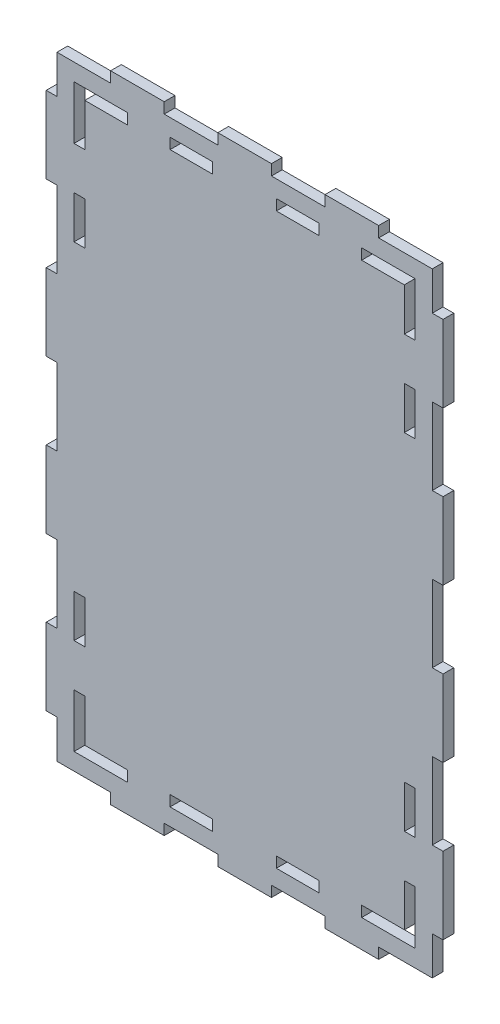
ISO-10303-21;
HEADER;
FILE_DESCRIPTION(('STEP AP214'),'2;1');
FILE_NAME('part.step','',(''),(''),'','','');
FILE_SCHEMA(('AUTOMOTIVE_DESIGN { 1 0 10303 214 1 1 1 1 }'));
ENDSEC;
DATA;
#1=APPLICATION_CONTEXT('core data for automotive mechanical design processes');
#2=APPLICATION_PROTOCOL_DEFINITION('international standard','automotive_design',2000,#1);
#3=PRODUCT_CONTEXT('',#1,'mechanical');
#4=PRODUCT('Part','Part','',(#3));
#5=PRODUCT_RELATED_PRODUCT_CATEGORY('part','',(#4));
#6=PRODUCT_DEFINITION_FORMATION('','',#4);
#7=PRODUCT_DEFINITION_CONTEXT('part definition',#1,'design');
#8=PRODUCT_DEFINITION('design','',#6,#7);
#9=PRODUCT_DEFINITION_SHAPE('','',#8);
#10=(LENGTH_UNIT() NAMED_UNIT(*) SI_UNIT(.MILLI.,.METRE.));
#11=(NAMED_UNIT(*) PLANE_ANGLE_UNIT() SI_UNIT($,.RADIAN.));
#12=(NAMED_UNIT(*) SI_UNIT($,.STERADIAN.) SOLID_ANGLE_UNIT());
#13=UNCERTAINTY_MEASURE_WITH_UNIT(LENGTH_MEASURE(1.E-05),#10,'distance_accuracy_value','');
#14=(GEOMETRIC_REPRESENTATION_CONTEXT(3) GLOBAL_UNCERTAINTY_ASSIGNED_CONTEXT((#13)) GLOBAL_UNIT_ASSIGNED_CONTEXT((#10,
#11,#12)) REPRESENTATION_CONTEXT('',''));
#15=CARTESIAN_POINT('',(0.,0.,0.));
#16=DIRECTION('',(0.,0.,1.));
#17=DIRECTION('',(1.,0.,0.));
#18=AXIS2_PLACEMENT_3D('',#15,#16,#17);
#19=CARTESIAN_POINT('',(0.,0.,16.));
#20=DIRECTION('',(0.,0.,-1.));
#21=DIRECTION('',(-1.,0.,0.));
#22=AXIS2_PLACEMENT_3D('',#19,#20,#21);
#23=PLANE('',#22);
#24=DIRECTION('',(1.,0.,0.));
#25=VECTOR('',#24,1.);
#26=CARTESIAN_POINT('',(0.,415.799999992,16.));
#27=LINE('',#26,#25);
#28=CARTESIAN_POINT('',(-798.116062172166,415.799999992,16.));
#29=VERTEX_POINT('',#28);
#30=CARTESIAN_POINT('',(-734.616062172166,415.799999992,16.));
#31=VERTEX_POINT('',#30);
#32=EDGE_CURVE('E1124',#29,#31,#27,.T.);
#33=ORIENTED_EDGE('',*,*,#32,.F.);
#34=DIRECTION('',(0.,1.,0.));
#35=VECTOR('',#34,1.);
#36=CARTESIAN_POINT('',(-798.116062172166,0.,16.));
#37=LINE('',#36,#35);
#38=CARTESIAN_POINT('',(-798.116062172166,431.799999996,16.));
#39=VERTEX_POINT('',#38);
#40=EDGE_CURVE('E1126',#29,#39,#37,.T.);
#41=ORIENTED_EDGE('',*,*,#40,.T.);
#42=DIRECTION('',(1.,0.,0.));
#43=VECTOR('',#42,1.);
#44=CARTESIAN_POINT('',(0.,431.799999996,16.));
#45=LINE('',#44,#43);
#46=CARTESIAN_POINT('',(-734.616062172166,431.799999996,16.));
#47=VERTEX_POINT('',#46);
#48=EDGE_CURVE('E1118',#39,#47,#45,.T.);
#49=ORIENTED_EDGE('',*,*,#48,.T.);
#50=DIRECTION('',(0.,-1.,0.));
#51=VECTOR('',#50,1.);
#52=CARTESIAN_POINT('',(-734.616062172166,0.,16.));
#53=LINE('',#52,#51);
#54=EDGE_CURVE('E1121',#47,#31,#53,.T.);
#55=ORIENTED_EDGE('',*,*,#54,.T.);
#56=EDGE_LOOP('',(#33,#41,#49,#55));
#57=FACE_BOUND('',#56,.T.);
#58=DIRECTION('',(0.,1.,0.));
#59=VECTOR('',#58,1.);
#60=CARTESIAN_POINT('',(-576.406347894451,0.,16.));
#61=LINE('',#60,#59);
#62=CARTESIAN_POINT('',(-576.406347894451,415.800000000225,16.));
#63=VERTEX_POINT('',#62);
#64=CARTESIAN_POINT('',(-576.406347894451,431.799999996,16.));
#65=VERTEX_POINT('',#64);
#66=EDGE_CURVE('E1107',#63,#65,#61,.T.);
#67=ORIENTED_EDGE('',*,*,#66,.F.);
#68=DIRECTION('',(-1.,-6.65347042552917E-11,0.));
#69=VECTOR('',#68,1.);
#70=CARTESIAN_POINT('',(-2.7665130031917E-08,415.800000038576,16.));
#71=LINE('',#70,#69);
#72=CARTESIAN_POINT('',(-639.906347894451,415.799999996,16.));
#73=VERTEX_POINT('',#72);
#74=EDGE_CURVE('E1099',#63,#73,#71,.T.);
#75=ORIENTED_EDGE('',*,*,#74,.T.);
#76=DIRECTION('',(-3.65969754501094E-09,-1.,0.));
#77=VECTOR('',#76,1.);
#78=CARTESIAN_POINT('',(-639.906349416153,2.34186369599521E-06,16.));
#79=LINE('',#78,#77);
#80=CARTESIAN_POINT('',(-639.906347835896,431.799999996,16.));
#81=VERTEX_POINT('',#80);
#82=EDGE_CURVE('E1102',#81,#73,#79,.T.);
#83=ORIENTED_EDGE('',*,*,#82,.F.);
#84=DIRECTION('',(-1.,0.,0.));
#85=VECTOR('',#84,1.);
#86=CARTESIAN_POINT('',(0.,431.799999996,16.));
#87=LINE('',#86,#85);
#88=EDGE_CURVE('E1105',#65,#81,#87,.T.);
#89=ORIENTED_EDGE('',*,*,#88,.F.);
#90=EDGE_LOOP('',(#67,#75,#83,#89));
#91=FACE_BOUND('',#90,.T.);
#92=DIRECTION('',(0.,-1.,0.));
#93=VECTOR('',#92,1.);
#94=CARTESIAN_POINT('',(-941.116062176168,-3.29086211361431E-12,16.));
#95=LINE('',#94,#93);
#96=CARTESIAN_POINT('',(-941.116062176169,288.799999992,16.));
#97=VERTEX_POINT('',#96);
#98=CARTESIAN_POINT('',(-941.116062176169,225.299999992,16.));
#99=VERTEX_POINT('',#98);
#100=EDGE_CURVE('E1094',#97,#99,#95,.T.);
#101=ORIENTED_EDGE('',*,*,#100,.F.);
#102=DIRECTION('',(1.,0.,0.));
#103=VECTOR('',#102,1.);
#104=CARTESIAN_POINT('',(0.,288.799999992,16.));
#105=LINE('',#104,#103);
#106=CARTESIAN_POINT('',(-925.116062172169,288.799999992,16.));
#107=VERTEX_POINT('',#106);
#108=EDGE_CURVE('E1096',#97,#107,#105,.T.);
#109=ORIENTED_EDGE('',*,*,#108,.T.);
#110=DIRECTION('',(0.,-1.,0.));
#111=VECTOR('',#110,1.);
#112=CARTESIAN_POINT('',(-925.116062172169,0.,16.));
#113=LINE('',#112,#111);
#114=CARTESIAN_POINT('',(-925.116062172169,225.299999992,16.));
#115=VERTEX_POINT('',#114);
#116=EDGE_CURVE('E1088',#107,#115,#113,.T.);
#117=ORIENTED_EDGE('',*,*,#116,.T.);
#118=DIRECTION('',(-1.,0.,0.));
#119=VECTOR('',#118,1.);
#120=CARTESIAN_POINT('',(0.,225.299999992,16.));
#121=LINE('',#120,#119);
#122=EDGE_CURVE('E1091',#115,#99,#121,.T.);
#123=ORIENTED_EDGE('',*,*,#122,.T.);
#124=EDGE_LOOP('',(#101,#109,#117,#123));
#125=FACE_BOUND('',#124,.T.);
#126=DIRECTION('',(0.,-1.,0.));
#127=VECTOR('',#126,1.);
#128=CARTESIAN_POINT('',(-449.116062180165,0.,16.));
#129=LINE('',#128,#127);
#130=CARTESIAN_POINT('',(-449.116062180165,-352.300000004,16.));
#131=VERTEX_POINT('',#130);
#132=CARTESIAN_POINT('',(-449.116062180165,-415.800000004,16.));
#133=VERTEX_POINT('',#132);
#134=EDGE_CURVE('E1041',#131,#133,#129,.T.);
#135=ORIENTED_EDGE('',*,*,#134,.F.);
#136=DIRECTION('',(1.,0.,0.));
#137=VECTOR('',#136,1.);
#138=CARTESIAN_POINT('',(0.,-352.300000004,16.));
#139=LINE('',#138,#137);
#140=CARTESIAN_POINT('',(-433.116062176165,-352.300000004,16.));
#141=VERTEX_POINT('',#140);
#142=EDGE_CURVE('E1028',#131,#141,#139,.T.);
#143=ORIENTED_EDGE('',*,*,#142,.T.);
#144=DIRECTION('',(0.,-1.,0.));
#145=VECTOR('',#144,1.);
#146=CARTESIAN_POINT('',(-433.116062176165,0.,16.));
#147=LINE('',#146,#145);
#148=CARTESIAN_POINT('',(-433.116062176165,-431.800000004,16.));
#149=VERTEX_POINT('',#148);
#150=EDGE_CURVE('E1031',#141,#149,#147,.T.);
#151=ORIENTED_EDGE('',*,*,#150,.T.);
#152=DIRECTION('',(-1.,0.,0.));
#153=VECTOR('',#152,1.);
#154=CARTESIAN_POINT('',(0.,-431.800000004,16.));
#155=LINE('',#154,#153);
#156=CARTESIAN_POINT('',(-512.906347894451,-431.800000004,16.));
#157=VERTEX_POINT('',#156);
#158=EDGE_CURVE('E1034',#149,#157,#155,.T.);
#159=ORIENTED_EDGE('',*,*,#158,.T.);
#160=DIRECTION('',(0.,-1.,0.));
#161=VECTOR('',#160,1.);
#162=CARTESIAN_POINT('',(-512.906347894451,0.,16.));
#163=LINE('',#162,#161);
#164=CARTESIAN_POINT('',(-512.906347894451,-415.800000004,16.));
#165=VERTEX_POINT('',#164);
#166=EDGE_CURVE('E1037',#165,#157,#163,.T.);
#167=ORIENTED_EDGE('',*,*,#166,.F.);
#168=DIRECTION('',(-1.,0.,0.));
#169=VECTOR('',#168,1.);
#170=CARTESIAN_POINT('',(0.,-415.800000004,16.));
#171=LINE('',#170,#169);
#172=EDGE_CURVE('E1039',#133,#165,#171,.T.);
#173=ORIENTED_EDGE('',*,*,#172,.F.);
#174=EDGE_LOOP('',(#135,#143,#151,#159,#167,#173));
#175=FACE_BOUND('',#174,.T.);
#176=DIRECTION('',(1.,0.,0.));
#177=VECTOR('',#176,1.);
#178=CARTESIAN_POINT('',(0.,415.799999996,16.));
#179=LINE('',#178,#177);
#180=CARTESIAN_POINT('',(-512.90634789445,415.799999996,16.));
#181=VERTEX_POINT('',#180);
#182=CARTESIAN_POINT('',(-449.40634789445,415.799999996,16.));
#183=VERTEX_POINT('',#182);
#184=EDGE_CURVE('E1016',#181,#183,#179,.T.);
#185=ORIENTED_EDGE('',*,*,#184,.F.);
#186=DIRECTION('',(0.,1.,0.));
#187=VECTOR('',#186,1.);
#188=CARTESIAN_POINT('',(-512.90634789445,0.,16.));
#189=LINE('',#188,#187);
#190=CARTESIAN_POINT('',(-512.90634789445,431.799999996,16.));
#191=VERTEX_POINT('',#190);
#192=EDGE_CURVE('E985',#181,#191,#189,.T.);
#193=ORIENTED_EDGE('',*,*,#192,.T.);
#194=DIRECTION('',(1.,0.,0.));
#195=VECTOR('',#194,1.);
#196=CARTESIAN_POINT('',(0.,431.799999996,16.));
#197=LINE('',#196,#195);
#198=CARTESIAN_POINT('',(-433.328484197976,431.799999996,16.));
#199=VERTEX_POINT('',#198);
#200=EDGE_CURVE('E1006',#191,#199,#197,.T.);
#201=ORIENTED_EDGE('',*,*,#200,.T.);
#202=DIRECTION('',(0.,-1.,0.));
#203=VECTOR('',#202,1.);
#204=CARTESIAN_POINT('',(-433.328484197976,0.,16.));
#205=LINE('',#204,#203);
#206=CARTESIAN_POINT('',(-433.328484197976,352.299999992,16.));
#207=VERTEX_POINT('',#206);
#208=EDGE_CURVE('E1009',#199,#207,#205,.T.);
#209=ORIENTED_EDGE('',*,*,#208,.T.);
#210=DIRECTION('',(0.999999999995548,-2.98389050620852E-06,0.));
#211=VECTOR('',#210,1.);
#212=CARTESIAN_POINT('',(0.00105122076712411,352.298706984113,16.));
#213=LINE('',#212,#211);
#214=CARTESIAN_POINT('',(-449.328484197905,352.300047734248,16.));
#215=VERTEX_POINT('',#214);
#216=EDGE_CURVE('E1012',#215,#207,#213,.T.);
#217=ORIENTED_EDGE('',*,*,#216,.F.);
#218=DIRECTION('',(0.00122619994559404,-0.999999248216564,0.));
#219=VECTOR('',#218,1.);
#220=CARTESIAN_POINT('',(-448.895818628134,-0.550436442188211,16.));
#221=LINE('',#220,#219);
#222=EDGE_CURVE('E1014',#183,#215,#221,.T.);
#223=ORIENTED_EDGE('',*,*,#222,.F.);
#224=EDGE_LOOP('',(#185,#193,#201,#209,#217,#223));
#225=FACE_BOUND('',#224,.T.);
#226=DIRECTION('',(0.,1.,0.));
#227=VECTOR('',#226,1.);
#228=CARTESIAN_POINT('',(-861.616062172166,0.,16.));
#229=LINE('',#228,#227);
#230=CARTESIAN_POINT('',(-861.616062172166,415.799999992,16.));
#231=VERTEX_POINT('',#230);
#232=CARTESIAN_POINT('',(-861.616062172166,431.799999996,16.));
#233=VERTEX_POINT('',#232);
#234=EDGE_CURVE('E1169',#231,#233,#229,.T.);
#235=ORIENTED_EDGE('',*,*,#234,.F.);
#236=DIRECTION('',(-1.,0.,0.));
#237=VECTOR('',#236,1.);
#238=CARTESIAN_POINT('',(0.,415.799999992,16.));
#239=LINE('',#238,#237);
#240=CARTESIAN_POINT('',(-925.116062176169,415.799999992,16.));
#241=VERTEX_POINT('',#240);
#242=EDGE_CURVE('E1171',#231,#241,#239,.T.);
#243=ORIENTED_EDGE('',*,*,#242,.T.);
#244=DIRECTION('',(0.,-1.,0.));
#245=VECTOR('',#244,1.);
#246=CARTESIAN_POINT('',(-925.116062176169,0.,16.));
#247=LINE('',#246,#245);
#248=CARTESIAN_POINT('',(-925.116062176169,352.299999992,16.));
#249=VERTEX_POINT('',#248);
#250=EDGE_CURVE('E1159',#241,#249,#247,.T.);
#251=ORIENTED_EDGE('',*,*,#250,.T.);
#252=DIRECTION('',(-1.,0.,0.));
#253=VECTOR('',#252,1.);
#254=CARTESIAN_POINT('',(0.,352.299999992,16.));
#255=LINE('',#254,#253);
#256=CARTESIAN_POINT('',(-941.116062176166,352.299999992,16.));
#257=VERTEX_POINT('',#256);
#258=EDGE_CURVE('E1162',#249,#257,#255,.T.);
#259=ORIENTED_EDGE('',*,*,#258,.T.);
#260=DIRECTION('',(0.,-1.,0.));
#261=VECTOR('',#260,1.);
#262=CARTESIAN_POINT('',(-941.116062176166,0.,16.));
#263=LINE('',#262,#261);
#264=CARTESIAN_POINT('',(-941.116062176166,431.799999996,16.));
#265=VERTEX_POINT('',#264);
#266=EDGE_CURVE('E1165',#265,#257,#263,.T.);
#267=ORIENTED_EDGE('',*,*,#266,.F.);
#268=DIRECTION('',(-1.,0.,0.));
#269=VECTOR('',#268,1.);
#270=CARTESIAN_POINT('',(0.,431.799999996,16.));
#271=LINE('',#270,#269);
#272=EDGE_CURVE('E1167',#233,#265,#271,.T.);
#273=ORIENTED_EDGE('',*,*,#272,.F.);
#274=EDGE_LOOP('',(#235,#243,#251,#259,#267,#273));
#275=FACE_BOUND('',#274,.T.);
#276=DIRECTION('',(0.,1.,0.));
#277=VECTOR('',#276,1.);
#278=CARTESIAN_POINT('',(-647.20177646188,-473.200000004,16.));
#279=LINE('',#278,#277);
#280=CARTESIAN_POINT('',(-647.20177646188,-473.200000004,16.));
#281=VERTEX_POINT('',#280);
#282=CARTESIAN_POINT('',(-647.20177646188,-457.200000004,16.));
#283=VERTEX_POINT('',#282);
#284=EDGE_CURVE('E1175',#281,#283,#279,.T.);
#285=ORIENTED_EDGE('',*,*,#284,.T.);
#286=DIRECTION('',(1.,0.,0.));
#287=VECTOR('',#286,1.);
#288=CARTESIAN_POINT('',(-647.20177646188,-457.200000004,16.));
#289=LINE('',#288,#287);
#290=CARTESIAN_POINT('',(-567.373205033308,-457.200000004,16.));
#291=VERTEX_POINT('',#290);
#292=EDGE_CURVE('E1178',#283,#291,#289,.T.);
#293=ORIENTED_EDGE('',*,*,#292,.T.);
#294=DIRECTION('',(0.,-1.,0.));
#295=VECTOR('',#294,1.);
#296=CARTESIAN_POINT('',(-567.373205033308,-457.200000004,16.));
#297=LINE('',#296,#295);
#298=CARTESIAN_POINT('',(-567.373205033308,-473.200000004,16.));
#299=VERTEX_POINT('',#298);
#300=EDGE_CURVE('E1181',#291,#299,#297,.T.);
#301=ORIENTED_EDGE('',*,*,#300,.T.);
#302=DIRECTION('',(1.,0.,0.));
#303=VECTOR('',#302,1.);
#304=CARTESIAN_POINT('',(-567.373205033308,-473.200000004,16.));
#305=LINE('',#304,#303);
#306=CARTESIAN_POINT('',(-487.544633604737,-473.200000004,16.));
#307=VERTEX_POINT('',#306);
#308=EDGE_CURVE('E1183',#299,#307,#305,.T.);
#309=ORIENTED_EDGE('',*,*,#308,.T.);
#310=DIRECTION('',(0.,1.,0.));
#311=VECTOR('',#310,1.);
#312=CARTESIAN_POINT('',(-487.544633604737,-473.200000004,16.));
#313=LINE('',#312,#311);
#314=CARTESIAN_POINT('',(-487.544633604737,-457.200000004,16.));
#315=VERTEX_POINT('',#314);
#316=EDGE_CURVE('E1185',#307,#315,#313,.T.);
#317=ORIENTED_EDGE('',*,*,#316,.T.);
#318=DIRECTION('',(1.,0.,0.));
#319=VECTOR('',#318,1.);
#320=CARTESIAN_POINT('',(-487.544633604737,-457.200000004,16.));
#321=LINE('',#320,#319);
#322=CARTESIAN_POINT('',(-407.716062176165,-457.200000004,16.));
#323=VERTEX_POINT('',#322);
#324=EDGE_CURVE('E1187',#315,#323,#321,.T.);
#325=ORIENTED_EDGE('',*,*,#324,.T.);
#326=DIRECTION('',(0.,1.,0.));
#327=VECTOR('',#326,1.);
#328=CARTESIAN_POINT('',(-407.716062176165,-400.050000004,16.));
#329=LINE('',#328,#327);
#330=CARTESIAN_POINT('',(-407.716062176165,-400.050000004,16.));
#331=VERTEX_POINT('',#330);
#332=EDGE_CURVE('E1189',#323,#331,#329,.T.);
#333=ORIENTED_EDGE('',*,*,#332,.T.);
#334=DIRECTION('',(1.,0.,0.));
#335=VECTOR('',#334,1.);
#336=CARTESIAN_POINT('',(-391.716062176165,-400.050000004,16.));
#337=LINE('',#336,#335);
#338=CARTESIAN_POINT('',(-391.716062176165,-400.050000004,16.));
#339=VERTEX_POINT('',#338);
#340=EDGE_CURVE('E1191',#331,#339,#337,.T.);
#341=ORIENTED_EDGE('',*,*,#340,.T.);
#342=DIRECTION('',(0.,1.,0.));
#343=VECTOR('',#342,1.);
#344=CARTESIAN_POINT('',(-391.716062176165,-285.750000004,16.));
#345=LINE('',#344,#343);
#346=CARTESIAN_POINT('',(-391.716062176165,-285.750000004,16.));
#347=VERTEX_POINT('',#346);
#348=EDGE_CURVE('E1193',#339,#347,#345,.T.);
#349=ORIENTED_EDGE('',*,*,#348,.T.);
#350=DIRECTION('',(-1.,0.,0.));
#351=VECTOR('',#350,1.);
#352=CARTESIAN_POINT('',(-407.716062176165,-285.750000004,16.));
#353=LINE('',#352,#351);
#354=CARTESIAN_POINT('',(-407.716062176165,-285.750000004,16.));
#355=VERTEX_POINT('',#354);
#356=EDGE_CURVE('E1195',#347,#355,#353,.T.);
#357=ORIENTED_EDGE('',*,*,#356,.T.);
#358=DIRECTION('',(0.,1.,0.));
#359=VECTOR('',#358,1.);
#360=CARTESIAN_POINT('',(-407.716062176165,-171.450000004,16.));
#361=LINE('',#360,#359);
#362=CARTESIAN_POINT('',(-407.716062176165,-171.450000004,16.));
#363=VERTEX_POINT('',#362);
#364=EDGE_CURVE('E1197',#355,#363,#361,.T.);
#365=ORIENTED_EDGE('',*,*,#364,.T.);
#366=DIRECTION('',(1.,0.,0.));
#367=VECTOR('',#366,1.);
#368=CARTESIAN_POINT('',(-391.716062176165,-171.450000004,16.));
#369=LINE('',#368,#367);
#370=CARTESIAN_POINT('',(-391.716062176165,-171.450000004,16.));
#371=VERTEX_POINT('',#370);
#372=EDGE_CURVE('E1199',#363,#371,#369,.T.);
#373=ORIENTED_EDGE('',*,*,#372,.T.);
#374=DIRECTION('',(0.,1.,0.));
#375=VECTOR('',#374,1.);
#376=CARTESIAN_POINT('',(-391.716062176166,-57.1500000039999,16.));
#377=LINE('',#376,#375);
#378=CARTESIAN_POINT('',(-391.716062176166,-57.1500000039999,16.));
#379=VERTEX_POINT('',#378);
#380=EDGE_CURVE('E1201',#371,#379,#377,.T.);
#381=ORIENTED_EDGE('',*,*,#380,.T.);
#382=DIRECTION('',(-1.,0.,0.));
#383=VECTOR('',#382,1.);
#384=CARTESIAN_POINT('',(-407.716062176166,-57.1500000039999,16.));
#385=LINE('',#384,#383);
#386=CARTESIAN_POINT('',(-407.716062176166,-57.1500000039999,16.));
#387=VERTEX_POINT('',#386);
#388=EDGE_CURVE('E1203',#379,#387,#385,.T.);
#389=ORIENTED_EDGE('',*,*,#388,.T.);
#390=DIRECTION('',(0.,1.,0.));
#391=VECTOR('',#390,1.);
#392=CARTESIAN_POINT('',(-407.716062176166,57.1499999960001,16.));
#393=LINE('',#392,#391);
#394=CARTESIAN_POINT('',(-407.716062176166,57.1499999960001,16.));
#395=VERTEX_POINT('',#394);
#396=EDGE_CURVE('E1205',#387,#395,#393,.T.);
#397=ORIENTED_EDGE('',*,*,#396,.T.);
#398=DIRECTION('',(1.,0.,0.));
#399=VECTOR('',#398,1.);
#400=CARTESIAN_POINT('',(-391.716062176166,57.1499999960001,16.));
#401=LINE('',#400,#399);
#402=CARTESIAN_POINT('',(-391.716062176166,57.1499999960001,16.));
#403=VERTEX_POINT('',#402);
#404=EDGE_CURVE('E1207',#395,#403,#401,.T.);
#405=ORIENTED_EDGE('',*,*,#404,.T.);
#406=DIRECTION('',(0.,1.,0.));
#407=VECTOR('',#406,1.);
#408=CARTESIAN_POINT('',(-391.716062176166,171.449999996,16.));
#409=LINE('',#408,#407);
#410=CARTESIAN_POINT('',(-391.716062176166,171.449999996,16.));
#411=VERTEX_POINT('',#410);
#412=EDGE_CURVE('E1209',#403,#411,#409,.T.);
#413=ORIENTED_EDGE('',*,*,#412,.T.);
#414=DIRECTION('',(-1.,0.,0.));
#415=VECTOR('',#414,1.);
#416=CARTESIAN_POINT('',(-407.716062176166,171.449999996,16.));
#417=LINE('',#416,#415);
#418=CARTESIAN_POINT('',(-407.716062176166,171.449999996,16.));
#419=VERTEX_POINT('',#418);
#420=EDGE_CURVE('E1211',#411,#419,#417,.T.);
#421=ORIENTED_EDGE('',*,*,#420,.T.);
#422=DIRECTION('',(0.,1.,0.));
#423=VECTOR('',#422,1.);
#424=CARTESIAN_POINT('',(-407.716062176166,285.749999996,16.));
#425=LINE('',#424,#423);
#426=CARTESIAN_POINT('',(-407.716062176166,285.749999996,16.));
#427=VERTEX_POINT('',#426);
#428=EDGE_CURVE('E1213',#419,#427,#425,.T.);
#429=ORIENTED_EDGE('',*,*,#428,.T.);
#430=DIRECTION('',(1.,0.,0.));
#431=VECTOR('',#430,1.);
#432=CARTESIAN_POINT('',(-391.716062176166,285.749999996,16.));
#433=LINE('',#432,#431);
#434=CARTESIAN_POINT('',(-391.716062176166,285.749999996,16.));
#435=VERTEX_POINT('',#434);
#436=EDGE_CURVE('E1215',#427,#435,#433,.T.);
#437=ORIENTED_EDGE('',*,*,#436,.T.);
#438=DIRECTION('',(0.,1.,0.));
#439=VECTOR('',#438,1.);
#440=CARTESIAN_POINT('',(-391.716062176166,400.049999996,16.));
#441=LINE('',#440,#439);
#442=CARTESIAN_POINT('',(-391.716062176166,400.049999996,16.));
#443=VERTEX_POINT('',#442);
#444=EDGE_CURVE('E1217',#435,#443,#441,.T.);
#445=ORIENTED_EDGE('',*,*,#444,.T.);
#446=DIRECTION('',(-1.,0.,0.));
#447=VECTOR('',#446,1.);
#448=CARTESIAN_POINT('',(-407.716062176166,400.049999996,16.));
#449=LINE('',#448,#447);
#450=CARTESIAN_POINT('',(-407.716062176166,400.049999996,16.));
#451=VERTEX_POINT('',#450);
#452=EDGE_CURVE('E1219',#443,#451,#449,.T.);
#453=ORIENTED_EDGE('',*,*,#452,.T.);
#454=DIRECTION('',(0.,1.,0.));
#455=VECTOR('',#454,1.);
#456=CARTESIAN_POINT('',(-407.716062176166,457.199999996,16.));
#457=LINE('',#456,#455);
#458=CARTESIAN_POINT('',(-407.716062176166,457.199999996,16.));
#459=VERTEX_POINT('',#458);
#460=EDGE_CURVE('E1221',#451,#459,#457,.T.);
#461=ORIENTED_EDGE('',*,*,#460,.T.);
#462=DIRECTION('',(-1.,0.,0.));
#463=VECTOR('',#462,1.);
#464=CARTESIAN_POINT('',(-487.544633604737,457.199999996,16.));
#465=LINE('',#464,#463);
#466=CARTESIAN_POINT('',(-487.544633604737,457.199999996,16.));
#467=VERTEX_POINT('',#466);
#468=EDGE_CURVE('E1223',#459,#467,#465,.T.);
#469=ORIENTED_EDGE('',*,*,#468,.T.);
#470=DIRECTION('',(0.,1.,0.));
#471=VECTOR('',#470,1.);
#472=CARTESIAN_POINT('',(-487.544633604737,473.199999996,16.));
#473=LINE('',#472,#471);
#474=CARTESIAN_POINT('',(-487.544633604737,473.199999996,16.));
#475=VERTEX_POINT('',#474);
#476=EDGE_CURVE('E1225',#467,#475,#473,.T.);
#477=ORIENTED_EDGE('',*,*,#476,.T.);
#478=DIRECTION('',(-1.,0.,0.));
#479=VECTOR('',#478,1.);
#480=CARTESIAN_POINT('',(-567.373205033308,473.199999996,16.));
#481=LINE('',#480,#479);
#482=CARTESIAN_POINT('',(-567.373205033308,473.199999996,16.));
#483=VERTEX_POINT('',#482);
#484=EDGE_CURVE('E1227',#475,#483,#481,.T.);
#485=ORIENTED_EDGE('',*,*,#484,.T.);
#486=DIRECTION('',(0.,-1.,0.));
#487=VECTOR('',#486,1.);
#488=CARTESIAN_POINT('',(-567.373205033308,457.199999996,16.));
#489=LINE('',#488,#487);
#490=CARTESIAN_POINT('',(-567.373205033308,457.199999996,16.));
#491=VERTEX_POINT('',#490);
#492=EDGE_CURVE('E1229',#483,#491,#489,.T.);
#493=ORIENTED_EDGE('',*,*,#492,.T.);
#494=DIRECTION('',(-1.,0.,0.));
#495=VECTOR('',#494,1.);
#496=CARTESIAN_POINT('',(-647.20177646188,457.199999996,16.));
#497=LINE('',#496,#495);
#498=CARTESIAN_POINT('',(-647.20177646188,457.199999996,16.));
#499=VERTEX_POINT('',#498);
#500=EDGE_CURVE('E1231',#491,#499,#497,.T.);
#501=ORIENTED_EDGE('',*,*,#500,.T.);
#502=DIRECTION('',(0.,1.,0.));
#503=VECTOR('',#502,1.);
#504=CARTESIAN_POINT('',(-647.20177646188,473.199999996,16.));
#505=LINE('',#504,#503);
#506=CARTESIAN_POINT('',(-647.20177646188,473.199999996,16.));
#507=VERTEX_POINT('',#506);
#508=EDGE_CURVE('E1233',#499,#507,#505,.T.);
#509=ORIENTED_EDGE('',*,*,#508,.T.);
#510=DIRECTION('',(-1.,0.,0.));
#511=VECTOR('',#510,1.);
#512=CARTESIAN_POINT('',(-727.030347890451,473.199999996,16.));
#513=LINE('',#512,#511);
#514=CARTESIAN_POINT('',(-727.030347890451,473.199999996,16.));
#515=VERTEX_POINT('',#514);
#516=EDGE_CURVE('E1235',#507,#515,#513,.T.);
#517=ORIENTED_EDGE('',*,*,#516,.T.);
#518=DIRECTION('',(0.,-1.,0.));
#519=VECTOR('',#518,1.);
#520=CARTESIAN_POINT('',(-727.030347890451,457.199999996,16.));
#521=LINE('',#520,#519);
#522=CARTESIAN_POINT('',(-727.030347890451,457.199999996,16.));
#523=VERTEX_POINT('',#522);
#524=EDGE_CURVE('E1237',#515,#523,#521,.T.);
#525=ORIENTED_EDGE('',*,*,#524,.T.);
#526=DIRECTION('',(-1.,0.,0.));
#527=VECTOR('',#526,1.);
#528=CARTESIAN_POINT('',(-806.858919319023,457.199999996,16.));
#529=LINE('',#528,#527);
#530=CARTESIAN_POINT('',(-806.858919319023,457.199999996,16.));
#531=VERTEX_POINT('',#530);
#532=EDGE_CURVE('E1239',#523,#531,#529,.T.);
#533=ORIENTED_EDGE('',*,*,#532,.T.);
#534=DIRECTION('',(0.,1.,0.));
#535=VECTOR('',#534,1.);
#536=CARTESIAN_POINT('',(-806.858919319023,473.199999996,16.));
#537=LINE('',#536,#535);
#538=CARTESIAN_POINT('',(-806.858919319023,473.199999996,16.));
#539=VERTEX_POINT('',#538);
#540=EDGE_CURVE('E1241',#531,#539,#537,.T.);
#541=ORIENTED_EDGE('',*,*,#540,.T.);
#542=DIRECTION('',(-1.,0.,0.));
#543=VECTOR('',#542,1.);
#544=CARTESIAN_POINT('',(-886.687490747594,473.199999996,16.));
#545=LINE('',#544,#543);
#546=CARTESIAN_POINT('',(-886.687490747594,473.199999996,16.));
#547=VERTEX_POINT('',#546);
#548=EDGE_CURVE('E1243',#539,#547,#545,.T.);
#549=ORIENTED_EDGE('',*,*,#548,.T.);
#550=DIRECTION('',(0.,-1.,0.));
#551=VECTOR('',#550,1.);
#552=CARTESIAN_POINT('',(-886.687490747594,457.199999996,16.));
#553=LINE('',#552,#551);
#554=CARTESIAN_POINT('',(-886.687490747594,457.199999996,16.));
#555=VERTEX_POINT('',#554);
#556=EDGE_CURVE('E1245',#547,#555,#553,.T.);
#557=ORIENTED_EDGE('',*,*,#556,.T.);
#558=DIRECTION('',(-1.,0.,0.));
#559=VECTOR('',#558,1.);
#560=CARTESIAN_POINT('',(-966.516062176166,457.199999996,16.));
#561=LINE('',#560,#559);
#562=CARTESIAN_POINT('',(-966.516062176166,457.199999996,16.));
#563=VERTEX_POINT('',#562);
#564=EDGE_CURVE('E1247',#555,#563,#561,.T.);
#565=ORIENTED_EDGE('',*,*,#564,.T.);
#566=DIRECTION('',(0.,-1.,0.));
#567=VECTOR('',#566,1.);
#568=CARTESIAN_POINT('',(-966.516062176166,457.199999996,16.));
#569=LINE('',#568,#567);
#570=CARTESIAN_POINT('',(-966.516062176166,400.049999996,16.));
#571=VERTEX_POINT('',#570);
#572=EDGE_CURVE('E1249',#563,#571,#569,.T.);
#573=ORIENTED_EDGE('',*,*,#572,.T.);
#574=DIRECTION('',(-1.,0.,0.));
#575=VECTOR('',#574,1.);
#576=CARTESIAN_POINT('',(-966.516062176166,400.049999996,16.));
#577=LINE('',#576,#575);
#578=CARTESIAN_POINT('',(-982.516062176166,400.049999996,16.));
#579=VERTEX_POINT('',#578);
#580=EDGE_CURVE('E1251',#571,#579,#577,.T.);
#581=ORIENTED_EDGE('',*,*,#580,.T.);
#582=DIRECTION('',(0.,-1.,0.));
#583=VECTOR('',#582,1.);
#584=CARTESIAN_POINT('',(-982.516062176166,400.049999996,16.));
#585=LINE('',#584,#583);
#586=CARTESIAN_POINT('',(-982.516062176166,285.749999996,16.));
#587=VERTEX_POINT('',#586);
#588=EDGE_CURVE('E1253',#579,#587,#585,.T.);
#589=ORIENTED_EDGE('',*,*,#588,.T.);
#590=DIRECTION('',(1.,0.,0.));
#591=VECTOR('',#590,1.);
#592=CARTESIAN_POINT('',(-966.516062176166,285.749999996,16.));
#593=LINE('',#592,#591);
#594=CARTESIAN_POINT('',(-966.516062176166,285.749999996,16.));
#595=VERTEX_POINT('',#594);
#596=EDGE_CURVE('E1255',#587,#595,#593,.T.);
#597=ORIENTED_EDGE('',*,*,#596,.T.);
#598=DIRECTION('',(0.,-1.,0.));
#599=VECTOR('',#598,1.);
#600=CARTESIAN_POINT('',(-966.516062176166,285.749999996,16.));
#601=LINE('',#600,#599);
#602=CARTESIAN_POINT('',(-966.516062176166,171.449999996,16.));
#603=VERTEX_POINT('',#602);
#604=EDGE_CURVE('E1257',#595,#603,#601,.T.);
#605=ORIENTED_EDGE('',*,*,#604,.T.);
#606=DIRECTION('',(-1.,0.,0.));
#607=VECTOR('',#606,1.);
#608=CARTESIAN_POINT('',(-966.516062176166,171.449999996,16.));
#609=LINE('',#608,#607);
#610=CARTESIAN_POINT('',(-982.516062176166,171.449999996,16.));
#611=VERTEX_POINT('',#610);
#612=EDGE_CURVE('E1259',#603,#611,#609,.T.);
#613=ORIENTED_EDGE('',*,*,#612,.T.);
#614=DIRECTION('',(0.,-1.,0.));
#615=VECTOR('',#614,1.);
#616=CARTESIAN_POINT('',(-982.516062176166,171.449999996,16.));
#617=LINE('',#616,#615);
#618=CARTESIAN_POINT('',(-982.516062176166,57.149999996,16.));
#619=VERTEX_POINT('',#618);
#620=EDGE_CURVE('E1261',#611,#619,#617,.T.);
#621=ORIENTED_EDGE('',*,*,#620,.T.);
#622=DIRECTION('',(1.,0.,0.));
#623=VECTOR('',#622,1.);
#624=CARTESIAN_POINT('',(-982.516062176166,57.149999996,16.));
#625=LINE('',#624,#623);
#626=CARTESIAN_POINT('',(-966.516062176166,57.149999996,16.));
#627=VERTEX_POINT('',#626);
#628=EDGE_CURVE('E1263',#619,#627,#625,.T.);
#629=ORIENTED_EDGE('',*,*,#628,.T.);
#630=DIRECTION('',(0.,-1.,0.));
#631=VECTOR('',#630,1.);
#632=CARTESIAN_POINT('',(-966.516062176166,57.149999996,16.));
#633=LINE('',#632,#631);
#634=CARTESIAN_POINT('',(-966.516062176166,-57.150000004,16.));
#635=VERTEX_POINT('',#634);
#636=EDGE_CURVE('E1265',#627,#635,#633,.T.);
#637=ORIENTED_EDGE('',*,*,#636,.T.);
#638=DIRECTION('',(-1.,0.,0.));
#639=VECTOR('',#638,1.);
#640=CARTESIAN_POINT('',(-966.516062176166,-57.150000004,16.));
#641=LINE('',#640,#639);
#642=CARTESIAN_POINT('',(-982.516062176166,-57.150000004,16.));
#643=VERTEX_POINT('',#642);
#644=EDGE_CURVE('E1267',#635,#643,#641,.T.);
#645=ORIENTED_EDGE('',*,*,#644,.T.);
#646=DIRECTION('',(0.,-1.,0.));
#647=VECTOR('',#646,1.);
#648=CARTESIAN_POINT('',(-982.516062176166,-57.150000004,16.));
#649=LINE('',#648,#647);
#650=CARTESIAN_POINT('',(-982.516062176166,-171.450000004,16.));
#651=VERTEX_POINT('',#650);
#652=EDGE_CURVE('E1269',#643,#651,#649,.T.);
#653=ORIENTED_EDGE('',*,*,#652,.T.);
#654=DIRECTION('',(1.,0.,0.));
#655=VECTOR('',#654,1.);
#656=CARTESIAN_POINT('',(-982.516062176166,-171.450000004,16.));
#657=LINE('',#656,#655);
#658=CARTESIAN_POINT('',(-966.516062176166,-171.450000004,16.));
#659=VERTEX_POINT('',#658);
#660=EDGE_CURVE('E1271',#651,#659,#657,.T.);
#661=ORIENTED_EDGE('',*,*,#660,.T.);
#662=DIRECTION('',(0.,-1.,0.));
#663=VECTOR('',#662,1.);
#664=CARTESIAN_POINT('',(-966.516062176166,-171.450000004,16.));
#665=LINE('',#664,#663);
#666=CARTESIAN_POINT('',(-966.516062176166,-285.750000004,16.));
#667=VERTEX_POINT('',#666);
#668=EDGE_CURVE('E1273',#659,#667,#665,.T.);
#669=ORIENTED_EDGE('',*,*,#668,.T.);
#670=DIRECTION('',(-1.,0.,0.));
#671=VECTOR('',#670,1.);
#672=CARTESIAN_POINT('',(-966.516062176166,-285.750000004,16.));
#673=LINE('',#672,#671);
#674=CARTESIAN_POINT('',(-982.516062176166,-285.750000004,16.));
#675=VERTEX_POINT('',#674);
#676=EDGE_CURVE('E1275',#667,#675,#673,.T.);
#677=ORIENTED_EDGE('',*,*,#676,.T.);
#678=DIRECTION('',(0.,-1.,0.));
#679=VECTOR('',#678,1.);
#680=CARTESIAN_POINT('',(-982.516062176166,-285.750000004,16.));
#681=LINE('',#680,#679);
#682=CARTESIAN_POINT('',(-982.516062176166,-400.050000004,16.));
#683=VERTEX_POINT('',#682);
#684=EDGE_CURVE('E1277',#675,#683,#681,.T.);
#685=ORIENTED_EDGE('',*,*,#684,.T.);
#686=DIRECTION('',(1.,0.,0.));
#687=VECTOR('',#686,1.);
#688=CARTESIAN_POINT('',(-982.516062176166,-400.050000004,16.));
#689=LINE('',#688,#687);
#690=CARTESIAN_POINT('',(-966.516062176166,-400.050000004,16.));
#691=VERTEX_POINT('',#690);
#692=EDGE_CURVE('E1279',#683,#691,#689,.T.);
#693=ORIENTED_EDGE('',*,*,#692,.T.);
#694=DIRECTION('',(0.,-1.,0.));
#695=VECTOR('',#694,1.);
#696=CARTESIAN_POINT('',(-966.516062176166,-400.050000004,16.));
#697=LINE('',#696,#695);
#698=CARTESIAN_POINT('',(-966.516062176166,-457.200000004,16.));
#699=VERTEX_POINT('',#698);
#700=EDGE_CURVE('E1281',#691,#699,#697,.T.);
#701=ORIENTED_EDGE('',*,*,#700,.T.);
#702=DIRECTION('',(1.,0.,0.));
#703=VECTOR('',#702,1.);
#704=CARTESIAN_POINT('',(-966.516062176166,-457.200000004,16.));
#705=LINE('',#704,#703);
#706=CARTESIAN_POINT('',(-886.687490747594,-457.200000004,16.));
#707=VERTEX_POINT('',#706);
#708=EDGE_CURVE('E1283',#699,#707,#705,.T.);
#709=ORIENTED_EDGE('',*,*,#708,.T.);
#710=DIRECTION('',(0.,-1.,0.));
#711=VECTOR('',#710,1.);
#712=CARTESIAN_POINT('',(-886.687490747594,-457.200000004,16.));
#713=LINE('',#712,#711);
#714=CARTESIAN_POINT('',(-886.687490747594,-473.200000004,16.));
#715=VERTEX_POINT('',#714);
#716=EDGE_CURVE('E1285',#707,#715,#713,.T.);
#717=ORIENTED_EDGE('',*,*,#716,.T.);
#718=DIRECTION('',(1.,0.,0.));
#719=VECTOR('',#718,1.);
#720=CARTESIAN_POINT('',(-886.687490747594,-473.200000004,16.));
#721=LINE('',#720,#719);
#722=CARTESIAN_POINT('',(-806.858919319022,-473.200000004,16.));
#723=VERTEX_POINT('',#722);
#724=EDGE_CURVE('E1287',#715,#723,#721,.T.);
#725=ORIENTED_EDGE('',*,*,#724,.T.);
#726=DIRECTION('',(0.,1.,0.));
#727=VECTOR('',#726,1.);
#728=CARTESIAN_POINT('',(-806.858919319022,-473.200000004,16.));
#729=LINE('',#728,#727);
#730=CARTESIAN_POINT('',(-806.858919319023,-457.200000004,16.));
#731=VERTEX_POINT('',#730);
#732=EDGE_CURVE('E1289',#723,#731,#729,.T.);
#733=ORIENTED_EDGE('',*,*,#732,.T.);
#734=DIRECTION('',(1.,0.,0.));
#735=VECTOR('',#734,1.);
#736=CARTESIAN_POINT('',(-806.858919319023,-457.200000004,16.));
#737=LINE('',#736,#735);
#738=CARTESIAN_POINT('',(-727.030347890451,-457.200000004,16.));
#739=VERTEX_POINT('',#738);
#740=EDGE_CURVE('E1291',#731,#739,#737,.T.);
#741=ORIENTED_EDGE('',*,*,#740,.T.);
#742=DIRECTION('',(0.,-1.,0.));
#743=VECTOR('',#742,1.);
#744=CARTESIAN_POINT('',(-727.030347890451,-457.200000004,16.));
#745=LINE('',#744,#743);
#746=CARTESIAN_POINT('',(-727.030347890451,-473.200000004,16.));
#747=VERTEX_POINT('',#746);
#748=EDGE_CURVE('E1293',#739,#747,#745,.T.);
#749=ORIENTED_EDGE('',*,*,#748,.T.);
#750=DIRECTION('',(1.,0.,0.));
#751=VECTOR('',#750,1.);
#752=CARTESIAN_POINT('',(-727.030347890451,-473.200000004,16.));
#753=LINE('',#752,#751);
#754=EDGE_CURVE('E1295',#747,#281,#753,.T.);
#755=ORIENTED_EDGE('',*,*,#754,.T.);
#756=EDGE_LOOP('',(#285,#293,#301,#309,#317,#325,#333,#341,#349,#357,#365,#373,#381,#389,#397,
#405,#413,#421,#429,#437,#445,#453,#461,#469,#477,#485,#493,#501,#509,#517,#525,#533,#541,#549,
#557,#565,#573,#581,#589,#597,#605,#613,#621,#629,#637,#645,#653,#661,#669,#677,#685,#693,#701,
#709,#717,#725,#733,#741,#749,#755));
#757=FACE_BOUND('',#756,.T.);
#758=DIRECTION('',(-0.999999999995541,-2.98627355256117E-06,0.));
#759=VECTOR('',#758,1.);
#760=CARTESIAN_POINT('',(-0.000862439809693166,288.801342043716,16.));
#761=LINE('',#760,#759);
#762=CARTESIAN_POINT('',(-433.406385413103,288.800047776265,16.));
#763=VERTEX_POINT('',#762);
#764=CARTESIAN_POINT('',(-449.406347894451,288.799999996,16.));
#765=VERTEX_POINT('',#764);
#766=EDGE_CURVE('E1026',#763,#765,#761,.T.);
#767=ORIENTED_EDGE('',*,*,#766,.F.);
#768=DIRECTION('',(5.90844466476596E-07,-0.999999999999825,0.));
#769=VECTOR('',#768,1.);
#770=CARTESIAN_POINT('',(-433.406214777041,-0.000256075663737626,16.));
#771=LINE('',#770,#769);
#772=CARTESIAN_POINT('',(-433.406347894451,225.299999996,16.));
#773=VERTEX_POINT('',#772);
#774=EDGE_CURVE('E1018',#763,#773,#771,.T.);
#775=ORIENTED_EDGE('',*,*,#774,.T.);
#776=DIRECTION('',(1.,0.,0.));
#777=VECTOR('',#776,1.);
#778=CARTESIAN_POINT('',(7.81666398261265E-13,225.299999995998,16.));
#779=LINE('',#778,#777);
#780=CARTESIAN_POINT('',(-449.406347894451,225.299999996,16.));
#781=VERTEX_POINT('',#780);
#782=EDGE_CURVE('E1021',#781,#773,#779,.T.);
#783=ORIENTED_EDGE('',*,*,#782,.F.);
#784=DIRECTION('',(0.,-1.,0.));
#785=VECTOR('',#784,1.);
#786=CARTESIAN_POINT('',(-449.40634789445,-1.17860143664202E-12,16.));
#787=LINE('',#786,#785);
#788=EDGE_CURVE('E1024',#765,#781,#787,.T.);
#789=ORIENTED_EDGE('',*,*,#788,.F.);
#790=EDGE_LOOP('',(#767,#775,#783,#789));
#791=FACE_BOUND('',#790,.T.);
#792=DIRECTION('',(0.,1.,0.));
#793=VECTOR('',#792,1.);
#794=CARTESIAN_POINT('',(-433.116062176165,0.,16.));
#795=LINE('',#794,#793);
#796=CARTESIAN_POINT('',(-433.116062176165,-288.800000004,16.));
#797=VERTEX_POINT('',#796);
#798=CARTESIAN_POINT('',(-433.116062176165,-225.3,16.));
#799=VERTEX_POINT('',#798);
#800=EDGE_CURVE('E1049',#797,#799,#795,.T.);
#801=ORIENTED_EDGE('',*,*,#800,.F.);
#802=DIRECTION('',(-1.,0.,0.));
#803=VECTOR('',#802,1.);
#804=CARTESIAN_POINT('',(0.,-288.800000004,16.));
#805=LINE('',#804,#803);
#806=CARTESIAN_POINT('',(-449.116062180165,-288.800000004,16.));
#807=VERTEX_POINT('',#806);
#808=EDGE_CURVE('E1051',#797,#807,#805,.T.);
#809=ORIENTED_EDGE('',*,*,#808,.T.);
#810=DIRECTION('',(6.29916066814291E-11,1.,0.));
#811=VECTOR('',#810,1.);
#812=CARTESIAN_POINT('',(-449.116062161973,2.82905423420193E-08,16.));
#813=LINE('',#812,#811);
#814=CARTESIAN_POINT('',(-449.116062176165,-225.300000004,16.));
#815=VERTEX_POINT('',#814);
#816=EDGE_CURVE('E1043',#807,#815,#813,.T.);
#817=ORIENTED_EDGE('',*,*,#816,.T.);
#818=DIRECTION('',(1.,2.49992734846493E-10,0.));
#819=VECTOR('',#818,1.);
#820=CARTESIAN_POINT('',(5.63233631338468E-08,-225.299999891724,16.));
#821=LINE('',#820,#819);
#822=EDGE_CURVE('E1046',#815,#799,#821,.T.);
#823=ORIENTED_EDGE('',*,*,#822,.T.);
#824=EDGE_LOOP('',(#801,#809,#817,#823));
#825=FACE_BOUND('',#824,.T.);
#826=DIRECTION('',(-0.999999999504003,3.14959370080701E-05,0.));
#827=VECTOR('',#826,1.);
#828=CARTESIAN_POINT('',(-0.0130966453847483,-415.820154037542,16.));
#829=LINE('',#828,#827);
#830=CARTESIAN_POINT('',(-576.406347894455,-415.801999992,16.));
#831=VERTEX_POINT('',#830);
#832=CARTESIAN_POINT('',(-639.906347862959,-415.8,16.));
#833=VERTEX_POINT('',#832);
#834=EDGE_CURVE('E1060',#831,#833,#829,.T.);
#835=ORIENTED_EDGE('',*,*,#834,.F.);
#836=DIRECTION('',(2.49831409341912E-13,-1.,0.));
#837=VECTOR('',#836,1.);
#838=CARTESIAN_POINT('',(-576.406347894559,-1.44004410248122E-10,16.));
#839=LINE('',#838,#837);
#840=CARTESIAN_POINT('',(-576.406347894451,-431.8,16.));
#841=VERTEX_POINT('',#840);
#842=EDGE_CURVE('E1062',#831,#841,#839,.T.);
#843=ORIENTED_EDGE('',*,*,#842,.T.);
#844=DIRECTION('',(-1.,0.,0.));
#845=VECTOR('',#844,1.);
#846=CARTESIAN_POINT('',(0.,-431.8,16.));
#847=LINE('',#846,#845);
#848=CARTESIAN_POINT('',(-639.906347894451,-431.8,16.));
#849=VERTEX_POINT('',#848);
#850=EDGE_CURVE('E1054',#841,#849,#847,.T.);
#851=ORIENTED_EDGE('',*,*,#850,.T.);
#852=DIRECTION('',(1.9682519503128E-09,1.,0.));
#853=VECTOR('',#852,1.);
#854=CARTESIAN_POINT('',(-639.90634704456,1.259496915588E-06,16.));
#855=LINE('',#854,#853);
#856=EDGE_CURVE('E1057',#849,#833,#855,.T.);
#857=ORIENTED_EDGE('',*,*,#856,.T.);
#858=EDGE_LOOP('',(#835,#843,#851,#857));
#859=FACE_BOUND('',#858,.T.);
#860=DIRECTION('',(-1.,-2.56739074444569E-13,0.));
#861=VECTOR('',#860,1.);
#862=CARTESIAN_POINT('',(9.04491759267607E-11,-352.299999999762,16.));
#863=LINE('',#862,#861);
#864=CARTESIAN_POINT('',(-925.116062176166,-352.3,16.));
#865=VERTEX_POINT('',#864);
#866=CARTESIAN_POINT('',(-941.116062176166,-352.300000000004,16.));
#867=VERTEX_POINT('',#866);
#868=EDGE_CURVE('E1075',#865,#867,#863,.T.);
#869=ORIENTED_EDGE('',*,*,#868,.F.);
#870=DIRECTION('',(0.,-1.,0.));
#871=VECTOR('',#870,1.);
#872=CARTESIAN_POINT('',(-925.116062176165,1.61745693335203E-12,16.));
#873=LINE('',#872,#871);
#874=CARTESIAN_POINT('',(-925.116062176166,-415.8,16.));
#875=VERTEX_POINT('',#874);
#876=EDGE_CURVE('E755',#865,#875,#873,.T.);
#877=ORIENTED_EDGE('',*,*,#876,.T.);
#878=DIRECTION('',(1.,0.,0.));
#879=VECTOR('',#878,1.);
#880=CARTESIAN_POINT('',(-3.63488766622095E-13,-415.800000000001,16.));
#881=LINE('',#880,#879);
#882=CARTESIAN_POINT('',(-861.616062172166,-415.8,16.));
#883=VERTEX_POINT('',#882);
#884=EDGE_CURVE('E1065',#875,#883,#881,.T.);
#885=ORIENTED_EDGE('',*,*,#884,.T.);
#886=DIRECTION('',(0.,-1.,0.));
#887=VECTOR('',#886,1.);
#888=CARTESIAN_POINT('',(-861.616062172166,0.,16.));
#889=LINE('',#888,#887);
#890=CARTESIAN_POINT('',(-861.616062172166,-431.800000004,16.));
#891=VERTEX_POINT('',#890);
#892=EDGE_CURVE('E1068',#883,#891,#889,.T.);
#893=ORIENTED_EDGE('',*,*,#892,.T.);
#894=DIRECTION('',(1.,0.,0.));
#895=VECTOR('',#894,1.);
#896=CARTESIAN_POINT('',(0.,-431.800000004,16.));
#897=LINE('',#896,#895);
#898=CARTESIAN_POINT('',(-941.116062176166,-431.800000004,16.));
#899=VERTEX_POINT('',#898);
#900=EDGE_CURVE('E1071',#899,#891,#897,.T.);
#901=ORIENTED_EDGE('',*,*,#900,.F.);
#902=DIRECTION('',(0.,-1.,0.));
#903=VECTOR('',#902,1.);
#904=CARTESIAN_POINT('',(-941.116062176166,0.,16.));
#905=LINE('',#904,#903);
#906=EDGE_CURVE('E1073',#867,#899,#905,.T.);
#907=ORIENTED_EDGE('',*,*,#906,.F.);
#908=EDGE_LOOP('',(#869,#877,#885,#893,#901,#907));
#909=FACE_BOUND('',#908,.T.);
#910=DIRECTION('',(1.,4.9619293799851E-13,0.));
#911=VECTOR('',#910,1.);
#912=CARTESIAN_POINT('',(1.4330052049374E-10,-288.799999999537,16.));
#913=LINE('',#912,#911);
#914=CARTESIAN_POINT('',(-941.116062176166,-288.800000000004,16.));
#915=VERTEX_POINT('',#914);
#916=CARTESIAN_POINT('',(-925.118062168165,-288.799999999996,16.));
#917=VERTEX_POINT('',#916);
#918=EDGE_CURVE('E1086',#915,#917,#913,.T.);
#919=ORIENTED_EDGE('',*,*,#918,.F.);
#920=DIRECTION('',(0.,1.,0.));
#921=VECTOR('',#920,1.);
#922=CARTESIAN_POINT('',(-941.116062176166,-1.64543105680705E-12,16.));
#923=LINE('',#922,#921);
#924=CARTESIAN_POINT('',(-941.116062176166,-225.3,16.));
#925=VERTEX_POINT('',#924);
#926=EDGE_CURVE('E1078',#915,#925,#923,.T.);
#927=ORIENTED_EDGE('',*,*,#926,.T.);
#928=DIRECTION('',(-1.,1.96824154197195E-09,0.));
#929=VECTOR('',#928,1.);
#930=CARTESIAN_POINT('',(-4.4344482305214E-07,-225.300001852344,16.));
#931=LINE('',#930,#929);
#932=CARTESIAN_POINT('',(-925.116062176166,-225.300000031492,16.));
#933=VERTEX_POINT('',#932);
#934=EDGE_CURVE('E1081',#933,#925,#931,.T.);
#935=ORIENTED_EDGE('',*,*,#934,.F.);
#936=DIRECTION('',(3.14959370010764E-05,0.999999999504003,0.));
#937=VECTOR('',#936,1.);
#938=CARTESIAN_POINT('',(-925.108965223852,0.0291371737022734,16.));
#939=LINE('',#938,#937);
#940=EDGE_CURVE('E1084',#917,#933,#939,.T.);
#941=ORIENTED_EDGE('',*,*,#940,.F.);
#942=EDGE_LOOP('',(#919,#927,#935,#941));
#943=FACE_BOUND('',#942,.T.);
#944=DIRECTION('',(-2.49831409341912E-13,-1.,0.));
#945=VECTOR('',#944,1.);
#946=CARTESIAN_POINT('',(-798.116062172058,1.99394460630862E-10,16.));
#947=LINE('',#946,#945);
#948=CARTESIAN_POINT('',(-798.116062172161,-415.801999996,16.));
#949=VERTEX_POINT('',#948);
#950=CARTESIAN_POINT('',(-798.116062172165,-431.800000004,16.));
#951=VERTEX_POINT('',#950);
#952=EDGE_CURVE('E1116',#949,#951,#947,.T.);
#953=ORIENTED_EDGE('',*,*,#952,.F.);
#954=DIRECTION('',(0.999999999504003,3.149593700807E-05,0.));
#955=VECTOR('',#954,1.);
#956=CARTESIAN_POINT('',(0.0130952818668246,-415.77686217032,16.));
#957=LINE('',#956,#955);
#958=CARTESIAN_POINT('',(-734.616062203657,-415.800000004,16.));
#959=VERTEX_POINT('',#958);
#960=EDGE_CURVE('E1109',#949,#959,#957,.T.);
#961=ORIENTED_EDGE('',*,*,#960,.T.);
#962=DIRECTION('',(-1.968238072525E-09,1.,0.));
#963=VECTOR('',#962,1.);
#964=CARTESIAN_POINT('',(-734.616063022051,-1.44589930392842E-06,16.));
#965=LINE('',#964,#963);
#966=CARTESIAN_POINT('',(-734.616062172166,-431.800000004,16.));
#967=VERTEX_POINT('',#966);
#968=EDGE_CURVE('E1112',#967,#959,#965,.T.);
#969=ORIENTED_EDGE('',*,*,#968,.F.);
#970=DIRECTION('',(1.,0.,0.));
#971=VECTOR('',#970,1.);
#972=CARTESIAN_POINT('',(0.,-431.800000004,16.));
#973=LINE('',#972,#971);
#974=EDGE_CURVE('E1114',#951,#967,#973,.T.);
#975=ORIENTED_EDGE('',*,*,#974,.F.);
#976=EDGE_LOOP('',(#953,#961,#969,#975));
#977=FACE_BOUND('',#976,.T.);
#978=ADVANCED_FACE('F35',(#57,#91,#125,#175,#225,#275,#757,#791,#825,#859,#909,#943,#977),#23,.F.);
#979=CARTESIAN_POINT('',(0.,0.,0.));
#980=DIRECTION('',(0.,0.,-1.));
#981=DIRECTION('',(-1.,0.,0.));
#982=AXIS2_PLACEMENT_3D('',#979,#980,#981);
#983=PLANE('',#982);
#984=DIRECTION('',(0.,1.,0.));
#985=VECTOR('',#984,1.);
#986=CARTESIAN_POINT('',(-798.116062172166,415.799999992,0.));
#987=LINE('',#986,#985);
#988=CARTESIAN_POINT('',(-798.116062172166,415.799999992,0.));
#989=VERTEX_POINT('',#988);
#990=CARTESIAN_POINT('',(-798.116062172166,431.799999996,0.));
#991=VERTEX_POINT('',#990);
#992=EDGE_CURVE('E850',#989,#991,#987,.T.);
#993=ORIENTED_EDGE('',*,*,#992,.F.);
#994=DIRECTION('',(1.,0.,0.));
#995=VECTOR('',#994,1.);
#996=CARTESIAN_POINT('',(-798.116062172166,415.799999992,0.));
#997=LINE('',#996,#995);
#998=CARTESIAN_POINT('',(-734.616062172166,415.799999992,0.));
#999=VERTEX_POINT('',#998);
#1000=EDGE_CURVE('E869',#989,#999,#997,.T.);
#1001=ORIENTED_EDGE('',*,*,#1000,.T.);
#1002=DIRECTION('',(0.,-1.,0.));
#1003=VECTOR('',#1002,1.);
#1004=CARTESIAN_POINT('',(-734.616062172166,431.799999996,0.));
#1005=LINE('',#1004,#1003);
#1006=CARTESIAN_POINT('',(-734.616062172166,431.799999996,0.));
#1007=VERTEX_POINT('',#1006);
#1008=EDGE_CURVE('E877',#1007,#999,#1005,.T.);
#1009=ORIENTED_EDGE('',*,*,#1008,.F.);
#1010=DIRECTION('',(1.,0.,0.));
#1011=VECTOR('',#1010,1.);
#1012=CARTESIAN_POINT('',(-798.116062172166,431.799999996,0.));
#1013=LINE('',#1012,#1011);
#1014=EDGE_CURVE('E880',#991,#1007,#1013,.T.);
#1015=ORIENTED_EDGE('',*,*,#1014,.F.);
#1016=EDGE_LOOP('',(#993,#1001,#1009,#1015));
#1017=FACE_BOUND('',#1016,.T.);
#1018=DIRECTION('',(1.,0.,0.));
#1019=VECTOR('',#1018,1.);
#1020=CARTESIAN_POINT('',(-941.116062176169,288.799999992,0.));
#1021=LINE('',#1020,#1019);
#1022=CARTESIAN_POINT('',(-941.116062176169,288.799999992,0.));
#1023=VERTEX_POINT('',#1022);
#1024=CARTESIAN_POINT('',(-925.116062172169,288.799999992,0.));
#1025=VERTEX_POINT('',#1024);
#1026=EDGE_CURVE('E788',#1023,#1025,#1021,.T.);
#1027=ORIENTED_EDGE('',*,*,#1026,.F.);
#1028=DIRECTION('',(0.,-1.,0.));
#1029=VECTOR('',#1028,1.);
#1030=CARTESIAN_POINT('',(-941.116062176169,288.799999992,0.));
#1031=LINE('',#1030,#1029);
#1032=CARTESIAN_POINT('',(-941.116062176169,225.299999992,0.));
#1033=VERTEX_POINT('',#1032);
#1034=EDGE_CURVE('E809',#1023,#1033,#1031,.T.);
#1035=ORIENTED_EDGE('',*,*,#1034,.T.);
#1036=DIRECTION('',(-1.,0.,0.));
#1037=VECTOR('',#1036,1.);
#1038=CARTESIAN_POINT('',(-925.116062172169,225.299999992,0.));
#1039=LINE('',#1038,#1037);
#1040=CARTESIAN_POINT('',(-925.116062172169,225.299999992,0.));
#1041=VERTEX_POINT('',#1040);
#1042=EDGE_CURVE('E819',#1041,#1033,#1039,.T.);
#1043=ORIENTED_EDGE('',*,*,#1042,.F.);
#1044=DIRECTION('',(0.,-1.,0.));
#1045=VECTOR('',#1044,1.);
#1046=CARTESIAN_POINT('',(-925.116062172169,288.799999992,0.));
#1047=LINE('',#1046,#1045);
#1048=EDGE_CURVE('E822',#1025,#1041,#1047,.T.);
#1049=ORIENTED_EDGE('',*,*,#1048,.F.);
#1050=EDGE_LOOP('',(#1027,#1035,#1043,#1049));
#1051=FACE_BOUND('',#1050,.T.);
#1052=DIRECTION('',(0.,-1.,0.));
#1053=VECTOR('',#1052,1.);
#1054=CARTESIAN_POINT('',(-925.116062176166,-352.3,0.));
#1055=LINE('',#1054,#1053);
#1056=CARTESIAN_POINT('',(-925.116062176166,-352.3,0.));
#1057=VERTEX_POINT('',#1056);
#1058=CARTESIAN_POINT('',(-925.116062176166,-415.8,0.));
#1059=VERTEX_POINT('',#1058);
#1060=EDGE_CURVE('E752',#1057,#1059,#1055,.T.);
#1061=ORIENTED_EDGE('',*,*,#1060,.F.);
#1062=DIRECTION('',(-1.,-2.56739074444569E-13,0.));
#1063=VECTOR('',#1062,1.);
#1064=CARTESIAN_POINT('',(-925.116062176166,-352.3,0.));
#1065=LINE('',#1064,#1063);
#1066=CARTESIAN_POINT('',(-941.116062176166,-352.300000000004,0.));
#1067=VERTEX_POINT('',#1066);
#1068=EDGE_CURVE('E762',#1057,#1067,#1065,.T.);
#1069=ORIENTED_EDGE('',*,*,#1068,.T.);
#1070=DIRECTION('',(0.,-1.,0.));
#1071=VECTOR('',#1070,1.);
#1072=CARTESIAN_POINT('',(-941.116062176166,-352.300000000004,0.));
#1073=LINE('',#1072,#1071);
#1074=CARTESIAN_POINT('',(-941.116062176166,-431.800000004,0.));
#1075=VERTEX_POINT('',#1074);
#1076=EDGE_CURVE('E768',#1067,#1075,#1073,.T.);
#1077=ORIENTED_EDGE('',*,*,#1076,.T.);
#1078=DIRECTION('',(1.,0.,0.));
#1079=VECTOR('',#1078,1.);
#1080=CARTESIAN_POINT('',(-941.116062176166,-431.800000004,0.));
#1081=LINE('',#1080,#1079);
#1082=CARTESIAN_POINT('',(-861.616062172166,-431.800000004,0.));
#1083=VERTEX_POINT('',#1082);
#1084=EDGE_CURVE('E3066',#1075,#1083,#1081,.T.);
#1085=ORIENTED_EDGE('',*,*,#1084,.T.);
#1086=DIRECTION('',(0.,-1.,0.));
#1087=VECTOR('',#1086,1.);
#1088=CARTESIAN_POINT('',(-861.616062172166,-415.8,0.));
#1089=LINE('',#1088,#1087);
#1090=CARTESIAN_POINT('',(-861.616062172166,-415.8,0.));
#1091=VERTEX_POINT('',#1090);
#1092=EDGE_CURVE('E781',#1091,#1083,#1089,.T.);
#1093=ORIENTED_EDGE('',*,*,#1092,.F.);
#1094=DIRECTION('',(1.,0.,0.));
#1095=VECTOR('',#1094,1.);
#1096=CARTESIAN_POINT('',(-925.116062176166,-415.8,0.));
#1097=LINE('',#1096,#1095);
#1098=EDGE_CURVE('E776',#1059,#1091,#1097,.T.);
#1099=ORIENTED_EDGE('',*,*,#1098,.F.);
#1100=EDGE_LOOP('',(#1061,#1069,#1077,#1085,#1093,#1099));
#1101=FACE_BOUND('',#1100,.T.);
#1102=DIRECTION('',(2.49831409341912E-13,-1.,0.));
#1103=VECTOR('',#1102,1.);
#1104=CARTESIAN_POINT('',(-576.406347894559,-1.44004410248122E-10,0.));
#1105=LINE('',#1104,#1103);
#1106=CARTESIAN_POINT('',(-576.406347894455,-415.801999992,0.));
#1107=VERTEX_POINT('',#1106);
#1108=CARTESIAN_POINT('',(-576.406347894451,-431.8,0.));
#1109=VERTEX_POINT('',#1108);
#1110=EDGE_CURVE('E983',#1107,#1109,#1105,.T.);
#1111=ORIENTED_EDGE('',*,*,#1110,.F.);
#1112=DIRECTION('',(-0.999999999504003,3.14959370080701E-05,0.));
#1113=VECTOR('',#1112,1.);
#1114=CARTESIAN_POINT('',(-0.0130966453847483,-415.820154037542,0.));
#1115=LINE('',#1114,#1113);
#1116=CARTESIAN_POINT('',(-639.906347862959,-415.8,0.));
#1117=VERTEX_POINT('',#1116);
#1118=EDGE_CURVE('E980',#1107,#1117,#1115,.T.);
#1119=ORIENTED_EDGE('',*,*,#1118,.T.);
#1120=DIRECTION('',(1.9682519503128E-09,1.,0.));
#1121=VECTOR('',#1120,1.);
#1122=CARTESIAN_POINT('',(-639.90634704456,1.259496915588E-06,0.));
#1123=LINE('',#1122,#1121);
#1124=CARTESIAN_POINT('',(-639.906347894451,-431.8,0.));
#1125=VERTEX_POINT('',#1124);
#1126=EDGE_CURVE('E977',#1125,#1117,#1123,.T.);
#1127=ORIENTED_EDGE('',*,*,#1126,.F.);
#1128=DIRECTION('',(-1.,0.,0.));
#1129=VECTOR('',#1128,1.);
#1130=CARTESIAN_POINT('',(0.,-431.8,0.));
#1131=LINE('',#1130,#1129);
#1132=EDGE_CURVE('E974',#1109,#1125,#1131,.T.);
#1133=ORIENTED_EDGE('',*,*,#1132,.F.);
#1134=EDGE_LOOP('',(#1111,#1119,#1127,#1133));
#1135=FACE_BOUND('',#1134,.T.);
#1136=DIRECTION('',(-1.,0.,0.));
#1137=VECTOR('',#1136,1.);
#1138=CARTESIAN_POINT('',(-433.116062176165,-288.800000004,0.));
#1139=LINE('',#1138,#1137);
#1140=CARTESIAN_POINT('',(-433.116062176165,-288.800000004,0.));
#1141=VERTEX_POINT('',#1140);
#1142=CARTESIAN_POINT('',(-449.116062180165,-288.800000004,0.));
#1143=VERTEX_POINT('',#1142);
#1144=EDGE_CURVE('E967',#1141,#1143,#1139,.T.);
#1145=ORIENTED_EDGE('',*,*,#1144,.F.);
#1146=DIRECTION('',(0.,1.,0.));
#1147=VECTOR('',#1146,1.);
#1148=CARTESIAN_POINT('',(-433.116062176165,-288.800000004,0.));
#1149=LINE('',#1148,#1147);
#1150=CARTESIAN_POINT('',(-433.116062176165,-225.3,0.));
#1151=VERTEX_POINT('',#1150);
#1152=EDGE_CURVE('E989',#1141,#1151,#1149,.T.);
#1153=ORIENTED_EDGE('',*,*,#1152,.T.);
#1154=DIRECTION('',(1.,2.49992734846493E-10,0.));
#1155=VECTOR('',#1154,1.);
#1156=CARTESIAN_POINT('',(-449.116062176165,-225.300000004,0.));
#1157=LINE('',#1156,#1155);
#1158=CARTESIAN_POINT('',(-449.116062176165,-225.300000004,0.));
#1159=VERTEX_POINT('',#1158);
#1160=EDGE_CURVE('E997',#1159,#1151,#1157,.T.);
#1161=ORIENTED_EDGE('',*,*,#1160,.F.);
#1162=DIRECTION('',(6.29916066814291E-11,1.,0.));
#1163=VECTOR('',#1162,1.);
#1164=CARTESIAN_POINT('',(-449.116062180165,-288.800000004,0.));
#1165=LINE('',#1164,#1163);
#1166=EDGE_CURVE('E1000',#1143,#1159,#1165,.T.);
#1167=ORIENTED_EDGE('',*,*,#1166,.F.);
#1168=EDGE_LOOP('',(#1145,#1153,#1161,#1167));
#1169=FACE_BOUND('',#1168,.T.);
#1170=DIRECTION('',(-1.,0.,0.));
#1171=VECTOR('',#1170,1.);
#1172=CARTESIAN_POINT('',(0.,415.799999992,0.));
#1173=LINE('',#1172,#1171);
#1174=CARTESIAN_POINT('',(-861.616062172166,415.799999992,0.));
#1175=VERTEX_POINT('',#1174);
#1176=CARTESIAN_POINT('',(-925.116062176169,415.799999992,0.));
#1177=VERTEX_POINT('',#1176);
#1178=EDGE_CURVE('E1129',#1175,#1177,#1173,.T.);
#1179=ORIENTED_EDGE('',*,*,#1178,.F.);
#1180=DIRECTION('',(0.,1.,0.));
#1181=VECTOR('',#1180,1.);
#1182=CARTESIAN_POINT('',(-861.616062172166,0.,0.));
#1183=LINE('',#1182,#1181);
#1184=CARTESIAN_POINT('',(-861.616062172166,431.799999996,0.));
#1185=VERTEX_POINT('',#1184);
#1186=EDGE_CURVE('E1131',#1175,#1185,#1183,.T.);
#1187=ORIENTED_EDGE('',*,*,#1186,.T.);
#1188=DIRECTION('',(-1.,0.,0.));
#1189=VECTOR('',#1188,1.);
#1190=CARTESIAN_POINT('',(0.,431.799999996,0.));
#1191=LINE('',#1190,#1189);
#1192=CARTESIAN_POINT('',(-941.116062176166,431.799999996,0.));
#1193=VERTEX_POINT('',#1192);
#1194=EDGE_CURVE('E1134',#1185,#1193,#1191,.T.);
#1195=ORIENTED_EDGE('',*,*,#1194,.T.);
#1196=DIRECTION('',(0.,-1.,0.));
#1197=VECTOR('',#1196,1.);
#1198=CARTESIAN_POINT('',(-941.116062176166,0.,0.));
#1199=LINE('',#1198,#1197);
#1200=CARTESIAN_POINT('',(-941.116062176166,352.299999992,0.));
#1201=VERTEX_POINT('',#1200);
#1202=EDGE_CURVE('E1137',#1193,#1201,#1199,.T.);
#1203=ORIENTED_EDGE('',*,*,#1202,.T.);
#1204=DIRECTION('',(-1.,0.,0.));
#1205=VECTOR('',#1204,1.);
#1206=CARTESIAN_POINT('',(0.,352.299999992,0.));
#1207=LINE('',#1206,#1205);
#1208=CARTESIAN_POINT('',(-925.116062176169,352.299999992,0.));
#1209=VERTEX_POINT('',#1208);
#1210=EDGE_CURVE('E1140',#1209,#1201,#1207,.T.);
#1211=ORIENTED_EDGE('',*,*,#1210,.F.);
#1212=DIRECTION('',(0.,-1.,0.));
#1213=VECTOR('',#1212,1.);
#1214=CARTESIAN_POINT('',(-925.116062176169,0.,0.));
#1215=LINE('',#1214,#1213);
#1216=EDGE_CURVE('E1143',#1177,#1209,#1215,.T.);
#1217=ORIENTED_EDGE('',*,*,#1216,.F.);
#1218=EDGE_LOOP('',(#1179,#1187,#1195,#1203,#1211,#1217));
#1219=FACE_BOUND('',#1218,.T.);
#1220=DIRECTION('',(0.,1.,0.));
#1221=VECTOR('',#1220,1.);
#1222=CARTESIAN_POINT('',(-647.20177646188,-473.200000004,0.));
#1223=LINE('',#1222,#1221);
#1224=CARTESIAN_POINT('',(-647.20177646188,-473.200000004,0.));
#1225=VERTEX_POINT('',#1224);
#1226=CARTESIAN_POINT('',(-647.20177646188,-457.200000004,0.));
#1227=VERTEX_POINT('',#1226);
#1228=EDGE_CURVE('E1174',#1225,#1227,#1223,.T.);
#1229=ORIENTED_EDGE('',*,*,#1228,.F.);
#1230=DIRECTION('',(1.,0.,0.));
#1231=VECTOR('',#1230,1.);
#1232=CARTESIAN_POINT('',(-727.030347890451,-473.200000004,0.));
#1233=LINE('',#1232,#1231);
#1234=CARTESIAN_POINT('',(-727.030347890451,-473.200000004,0.));
#1235=VERTEX_POINT('',#1234);
#1236=EDGE_CURVE('E1179',#1235,#1225,#1233,.T.);
#1237=ORIENTED_EDGE('',*,*,#1236,.F.);
#1238=DIRECTION('',(0.,-1.,0.));
#1239=VECTOR('',#1238,1.);
#1240=CARTESIAN_POINT('',(-727.030347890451,-457.200000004,0.));
#1241=LINE('',#1240,#1239);
#1242=CARTESIAN_POINT('',(-727.030347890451,-457.200000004,0.));
#1243=VERTEX_POINT('',#1242);
#1244=EDGE_CURVE('E1414',#1243,#1235,#1241,.T.);
#1245=ORIENTED_EDGE('',*,*,#1244,.F.);
#1246=DIRECTION('',(1.,0.,0.));
#1247=VECTOR('',#1246,1.);
#1248=CARTESIAN_POINT('',(-806.858919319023,-457.200000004,0.));
#1249=LINE('',#1248,#1247);
#1250=CARTESIAN_POINT('',(-806.858919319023,-457.200000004,0.));
#1251=VERTEX_POINT('',#1250);
#1252=EDGE_CURVE('E1412',#1251,#1243,#1249,.T.);
#1253=ORIENTED_EDGE('',*,*,#1252,.F.);
#1254=DIRECTION('',(0.,1.,0.));
#1255=VECTOR('',#1254,1.);
#1256=CARTESIAN_POINT('',(-806.858919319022,-473.200000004,0.));
#1257=LINE('',#1256,#1255);
#1258=CARTESIAN_POINT('',(-806.858919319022,-473.200000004,0.));
#1259=VERTEX_POINT('',#1258);
#1260=EDGE_CURVE('E1410',#1259,#1251,#1257,.T.);
#1261=ORIENTED_EDGE('',*,*,#1260,.F.);
#1262=DIRECTION('',(1.,0.,0.));
#1263=VECTOR('',#1262,1.);
#1264=CARTESIAN_POINT('',(-886.687490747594,-473.200000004,0.));
#1265=LINE('',#1264,#1263);
#1266=CARTESIAN_POINT('',(-886.687490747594,-473.200000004,0.));
#1267=VERTEX_POINT('',#1266);
#1268=EDGE_CURVE('E1408',#1267,#1259,#1265,.T.);
#1269=ORIENTED_EDGE('',*,*,#1268,.F.);
#1270=DIRECTION('',(0.,-1.,0.));
#1271=VECTOR('',#1270,1.);
#1272=CARTESIAN_POINT('',(-886.687490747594,-457.200000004,0.));
#1273=LINE('',#1272,#1271);
#1274=CARTESIAN_POINT('',(-886.687490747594,-457.200000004,0.));
#1275=VERTEX_POINT('',#1274);
#1276=EDGE_CURVE('E1406',#1275,#1267,#1273,.T.);
#1277=ORIENTED_EDGE('',*,*,#1276,.F.);
#1278=DIRECTION('',(1.,0.,0.));
#1279=VECTOR('',#1278,1.);
#1280=CARTESIAN_POINT('',(-966.516062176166,-457.200000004,0.));
#1281=LINE('',#1280,#1279);
#1282=CARTESIAN_POINT('',(-966.516062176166,-457.200000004,0.));
#1283=VERTEX_POINT('',#1282);
#1284=EDGE_CURVE('E1404',#1283,#1275,#1281,.T.);
#1285=ORIENTED_EDGE('',*,*,#1284,.F.);
#1286=DIRECTION('',(0.,-1.,0.));
#1287=VECTOR('',#1286,1.);
#1288=CARTESIAN_POINT('',(-966.516062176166,-400.050000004,0.));
#1289=LINE('',#1288,#1287);
#1290=CARTESIAN_POINT('',(-966.516062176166,-400.050000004,0.));
#1291=VERTEX_POINT('',#1290);
#1292=EDGE_CURVE('E1402',#1291,#1283,#1289,.T.);
#1293=ORIENTED_EDGE('',*,*,#1292,.F.);
#1294=DIRECTION('',(1.,0.,0.));
#1295=VECTOR('',#1294,1.);
#1296=CARTESIAN_POINT('',(-982.516062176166,-400.050000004,0.));
#1297=LINE('',#1296,#1295);
#1298=CARTESIAN_POINT('',(-982.516062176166,-400.050000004,0.));
#1299=VERTEX_POINT('',#1298);
#1300=EDGE_CURVE('E1400',#1299,#1291,#1297,.T.);
#1301=ORIENTED_EDGE('',*,*,#1300,.F.);
#1302=DIRECTION('',(0.,-1.,0.));
#1303=VECTOR('',#1302,1.);
#1304=CARTESIAN_POINT('',(-982.516062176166,-285.750000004,0.));
#1305=LINE('',#1304,#1303);
#1306=CARTESIAN_POINT('',(-982.516062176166,-285.750000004,0.));
#1307=VERTEX_POINT('',#1306);
#1308=EDGE_CURVE('E1398',#1307,#1299,#1305,.T.);
#1309=ORIENTED_EDGE('',*,*,#1308,.F.);
#1310=DIRECTION('',(-1.,0.,0.));
#1311=VECTOR('',#1310,1.);
#1312=CARTESIAN_POINT('',(-966.516062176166,-285.750000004,0.));
#1313=LINE('',#1312,#1311);
#1314=CARTESIAN_POINT('',(-966.516062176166,-285.750000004,0.));
#1315=VERTEX_POINT('',#1314);
#1316=EDGE_CURVE('E1396',#1315,#1307,#1313,.T.);
#1317=ORIENTED_EDGE('',*,*,#1316,.F.);
#1318=DIRECTION('',(0.,-1.,0.));
#1319=VECTOR('',#1318,1.);
#1320=CARTESIAN_POINT('',(-966.516062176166,-171.450000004,0.));
#1321=LINE('',#1320,#1319);
#1322=CARTESIAN_POINT('',(-966.516062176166,-171.450000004,0.));
#1323=VERTEX_POINT('',#1322);
#1324=EDGE_CURVE('E1394',#1323,#1315,#1321,.T.);
#1325=ORIENTED_EDGE('',*,*,#1324,.F.);
#1326=DIRECTION('',(1.,0.,0.));
#1327=VECTOR('',#1326,1.);
#1328=CARTESIAN_POINT('',(-982.516062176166,-171.450000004,0.));
#1329=LINE('',#1328,#1327);
#1330=CARTESIAN_POINT('',(-982.516062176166,-171.450000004,0.));
#1331=VERTEX_POINT('',#1330);
#1332=EDGE_CURVE('E1392',#1331,#1323,#1329,.T.);
#1333=ORIENTED_EDGE('',*,*,#1332,.F.);
#1334=DIRECTION('',(0.,-1.,0.));
#1335=VECTOR('',#1334,1.);
#1336=CARTESIAN_POINT('',(-982.516062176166,-57.150000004,0.));
#1337=LINE('',#1336,#1335);
#1338=CARTESIAN_POINT('',(-982.516062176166,-57.150000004,0.));
#1339=VERTEX_POINT('',#1338);
#1340=EDGE_CURVE('E1390',#1339,#1331,#1337,.T.);
#1341=ORIENTED_EDGE('',*,*,#1340,.F.);
#1342=DIRECTION('',(-1.,0.,0.));
#1343=VECTOR('',#1342,1.);
#1344=CARTESIAN_POINT('',(-966.516062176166,-57.150000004,0.));
#1345=LINE('',#1344,#1343);
#1346=CARTESIAN_POINT('',(-966.516062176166,-57.150000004,0.));
#1347=VERTEX_POINT('',#1346);
#1348=EDGE_CURVE('E1388',#1347,#1339,#1345,.T.);
#1349=ORIENTED_EDGE('',*,*,#1348,.F.);
#1350=DIRECTION('',(0.,-1.,0.));
#1351=VECTOR('',#1350,1.);
#1352=CARTESIAN_POINT('',(-966.516062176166,57.149999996,0.));
#1353=LINE('',#1352,#1351);
#1354=CARTESIAN_POINT('',(-966.516062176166,57.149999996,0.));
#1355=VERTEX_POINT('',#1354);
#1356=EDGE_CURVE('E1386',#1355,#1347,#1353,.T.);
#1357=ORIENTED_EDGE('',*,*,#1356,.F.);
#1358=DIRECTION('',(1.,0.,0.));
#1359=VECTOR('',#1358,1.);
#1360=CARTESIAN_POINT('',(-982.516062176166,57.149999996,0.));
#1361=LINE('',#1360,#1359);
#1362=CARTESIAN_POINT('',(-982.516062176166,57.149999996,0.));
#1363=VERTEX_POINT('',#1362);
#1364=EDGE_CURVE('E1384',#1363,#1355,#1361,.T.);
#1365=ORIENTED_EDGE('',*,*,#1364,.F.);
#1366=DIRECTION('',(0.,-1.,0.));
#1367=VECTOR('',#1366,1.);
#1368=CARTESIAN_POINT('',(-982.516062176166,171.449999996,0.));
#1369=LINE('',#1368,#1367);
#1370=CARTESIAN_POINT('',(-982.516062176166,171.449999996,0.));
#1371=VERTEX_POINT('',#1370);
#1372=EDGE_CURVE('E1382',#1371,#1363,#1369,.T.);
#1373=ORIENTED_EDGE('',*,*,#1372,.F.);
#1374=DIRECTION('',(-1.,0.,0.));
#1375=VECTOR('',#1374,1.);
#1376=CARTESIAN_POINT('',(-966.516062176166,171.449999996,0.));
#1377=LINE('',#1376,#1375);
#1378=CARTESIAN_POINT('',(-966.516062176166,171.449999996,0.));
#1379=VERTEX_POINT('',#1378);
#1380=EDGE_CURVE('E1380',#1379,#1371,#1377,.T.);
#1381=ORIENTED_EDGE('',*,*,#1380,.F.);
#1382=DIRECTION('',(0.,-1.,0.));
#1383=VECTOR('',#1382,1.);
#1384=CARTESIAN_POINT('',(-966.516062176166,285.749999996,0.));
#1385=LINE('',#1384,#1383);
#1386=CARTESIAN_POINT('',(-966.516062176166,285.749999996,0.));
#1387=VERTEX_POINT('',#1386);
#1388=EDGE_CURVE('E1378',#1387,#1379,#1385,.T.);
#1389=ORIENTED_EDGE('',*,*,#1388,.F.);
#1390=DIRECTION('',(1.,0.,0.));
#1391=VECTOR('',#1390,1.);
#1392=CARTESIAN_POINT('',(-966.516062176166,285.749999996,0.));
#1393=LINE('',#1392,#1391);
#1394=CARTESIAN_POINT('',(-982.516062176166,285.749999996,0.));
#1395=VERTEX_POINT('',#1394);
#1396=EDGE_CURVE('E1376',#1395,#1387,#1393,.T.);
#1397=ORIENTED_EDGE('',*,*,#1396,.F.);
#1398=DIRECTION('',(0.,-1.,0.));
#1399=VECTOR('',#1398,1.);
#1400=CARTESIAN_POINT('',(-982.516062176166,400.049999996,0.));
#1401=LINE('',#1400,#1399);
#1402=CARTESIAN_POINT('',(-982.516062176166,400.049999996,0.));
#1403=VERTEX_POINT('',#1402);
#1404=EDGE_CURVE('E1374',#1403,#1395,#1401,.T.);
#1405=ORIENTED_EDGE('',*,*,#1404,.F.);
#1406=DIRECTION('',(-1.,0.,0.));
#1407=VECTOR('',#1406,1.);
#1408=CARTESIAN_POINT('',(-966.516062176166,400.049999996,0.));
#1409=LINE('',#1408,#1407);
#1410=CARTESIAN_POINT('',(-966.516062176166,400.049999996,0.));
#1411=VERTEX_POINT('',#1410);
#1412=EDGE_CURVE('E1372',#1411,#1403,#1409,.T.);
#1413=ORIENTED_EDGE('',*,*,#1412,.F.);
#1414=DIRECTION('',(0.,-1.,0.));
#1415=VECTOR('',#1414,1.);
#1416=CARTESIAN_POINT('',(-966.516062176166,457.199999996,0.));
#1417=LINE('',#1416,#1415);
#1418=CARTESIAN_POINT('',(-966.516062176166,457.199999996,0.));
#1419=VERTEX_POINT('',#1418);
#1420=EDGE_CURVE('E1370',#1419,#1411,#1417,.T.);
#1421=ORIENTED_EDGE('',*,*,#1420,.F.);
#1422=DIRECTION('',(-1.,0.,0.));
#1423=VECTOR('',#1422,1.);
#1424=CARTESIAN_POINT('',(-966.516062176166,457.199999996,0.));
#1425=LINE('',#1424,#1423);
#1426=CARTESIAN_POINT('',(-886.687490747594,457.199999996,0.));
#1427=VERTEX_POINT('',#1426);
#1428=EDGE_CURVE('E1368',#1427,#1419,#1425,.T.);
#1429=ORIENTED_EDGE('',*,*,#1428,.F.);
#1430=DIRECTION('',(0.,-1.,0.));
#1431=VECTOR('',#1430,1.);
#1432=CARTESIAN_POINT('',(-886.687490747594,457.199999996,0.));
#1433=LINE('',#1432,#1431);
#1434=CARTESIAN_POINT('',(-886.687490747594,473.199999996,0.));
#1435=VERTEX_POINT('',#1434);
#1436=EDGE_CURVE('E1366',#1435,#1427,#1433,.T.);
#1437=ORIENTED_EDGE('',*,*,#1436,.F.);
#1438=DIRECTION('',(-1.,0.,0.));
#1439=VECTOR('',#1438,1.);
#1440=CARTESIAN_POINT('',(-886.687490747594,473.199999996,0.));
#1441=LINE('',#1440,#1439);
#1442=CARTESIAN_POINT('',(-806.858919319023,473.199999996,0.));
#1443=VERTEX_POINT('',#1442);
#1444=EDGE_CURVE('E1364',#1443,#1435,#1441,.T.);
#1445=ORIENTED_EDGE('',*,*,#1444,.F.);
#1446=DIRECTION('',(0.,1.,0.));
#1447=VECTOR('',#1446,1.);
#1448=CARTESIAN_POINT('',(-806.858919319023,473.199999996,0.));
#1449=LINE('',#1448,#1447);
#1450=CARTESIAN_POINT('',(-806.858919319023,457.199999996,0.));
#1451=VERTEX_POINT('',#1450);
#1452=EDGE_CURVE('E1362',#1451,#1443,#1449,.T.);
#1453=ORIENTED_EDGE('',*,*,#1452,.F.);
#1454=DIRECTION('',(-1.,0.,0.));
#1455=VECTOR('',#1454,1.);
#1456=CARTESIAN_POINT('',(-806.858919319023,457.199999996,0.));
#1457=LINE('',#1456,#1455);
#1458=CARTESIAN_POINT('',(-727.030347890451,457.199999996,0.));
#1459=VERTEX_POINT('',#1458);
#1460=EDGE_CURVE('E1360',#1459,#1451,#1457,.T.);
#1461=ORIENTED_EDGE('',*,*,#1460,.F.);
#1462=DIRECTION('',(0.,-1.,0.));
#1463=VECTOR('',#1462,1.);
#1464=CARTESIAN_POINT('',(-727.030347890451,457.199999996,0.));
#1465=LINE('',#1464,#1463);
#1466=CARTESIAN_POINT('',(-727.030347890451,473.199999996,0.));
#1467=VERTEX_POINT('',#1466);
#1468=EDGE_CURVE('E1358',#1467,#1459,#1465,.T.);
#1469=ORIENTED_EDGE('',*,*,#1468,.F.);
#1470=DIRECTION('',(-1.,0.,0.));
#1471=VECTOR('',#1470,1.);
#1472=CARTESIAN_POINT('',(-727.030347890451,473.199999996,0.));
#1473=LINE('',#1472,#1471);
#1474=CARTESIAN_POINT('',(-647.20177646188,473.199999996,0.));
#1475=VERTEX_POINT('',#1474);
#1476=EDGE_CURVE('E1356',#1475,#1467,#1473,.T.);
#1477=ORIENTED_EDGE('',*,*,#1476,.F.);
#1478=DIRECTION('',(0.,1.,0.));
#1479=VECTOR('',#1478,1.);
#1480=CARTESIAN_POINT('',(-647.20177646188,473.199999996,0.));
#1481=LINE('',#1480,#1479);
#1482=CARTESIAN_POINT('',(-647.20177646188,457.199999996,0.));
#1483=VERTEX_POINT('',#1482);
#1484=EDGE_CURVE('E1354',#1483,#1475,#1481,.T.);
#1485=ORIENTED_EDGE('',*,*,#1484,.F.);
#1486=DIRECTION('',(-1.,0.,0.));
#1487=VECTOR('',#1486,1.);
#1488=CARTESIAN_POINT('',(-647.20177646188,457.199999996,0.));
#1489=LINE('',#1488,#1487);
#1490=CARTESIAN_POINT('',(-567.373205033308,457.199999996,0.));
#1491=VERTEX_POINT('',#1490);
#1492=EDGE_CURVE('E1352',#1491,#1483,#1489,.T.);
#1493=ORIENTED_EDGE('',*,*,#1492,.F.);
#1494=DIRECTION('',(0.,-1.,0.));
#1495=VECTOR('',#1494,1.);
#1496=CARTESIAN_POINT('',(-567.373205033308,457.199999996,0.));
#1497=LINE('',#1496,#1495);
#1498=CARTESIAN_POINT('',(-567.373205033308,473.199999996,0.));
#1499=VERTEX_POINT('',#1498);
#1500=EDGE_CURVE('E1350',#1499,#1491,#1497,.T.);
#1501=ORIENTED_EDGE('',*,*,#1500,.F.);
#1502=DIRECTION('',(-1.,0.,0.));
#1503=VECTOR('',#1502,1.);
#1504=CARTESIAN_POINT('',(-567.373205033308,473.199999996,0.));
#1505=LINE('',#1504,#1503);
#1506=CARTESIAN_POINT('',(-487.544633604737,473.199999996,0.));
#1507=VERTEX_POINT('',#1506);
#1508=EDGE_CURVE('E1348',#1507,#1499,#1505,.T.);
#1509=ORIENTED_EDGE('',*,*,#1508,.F.);
#1510=DIRECTION('',(0.,1.,0.));
#1511=VECTOR('',#1510,1.);
#1512=CARTESIAN_POINT('',(-487.544633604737,473.199999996,0.));
#1513=LINE('',#1512,#1511);
#1514=CARTESIAN_POINT('',(-487.544633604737,457.199999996,0.));
#1515=VERTEX_POINT('',#1514);
#1516=EDGE_CURVE('E1346',#1515,#1507,#1513,.T.);
#1517=ORIENTED_EDGE('',*,*,#1516,.F.);
#1518=DIRECTION('',(-1.,0.,0.));
#1519=VECTOR('',#1518,1.);
#1520=CARTESIAN_POINT('',(-487.544633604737,457.199999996,0.));
#1521=LINE('',#1520,#1519);
#1522=CARTESIAN_POINT('',(-407.716062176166,457.199999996,0.));
#1523=VERTEX_POINT('',#1522);
#1524=EDGE_CURVE('E1344',#1523,#1515,#1521,.T.);
#1525=ORIENTED_EDGE('',*,*,#1524,.F.);
#1526=DIRECTION('',(0.,1.,0.));
#1527=VECTOR('',#1526,1.);
#1528=CARTESIAN_POINT('',(-407.716062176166,457.199999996,0.));
#1529=LINE('',#1528,#1527);
#1530=CARTESIAN_POINT('',(-407.716062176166,400.049999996,0.));
#1531=VERTEX_POINT('',#1530);
#1532=EDGE_CURVE('E1342',#1531,#1523,#1529,.T.);
#1533=ORIENTED_EDGE('',*,*,#1532,.F.);
#1534=DIRECTION('',(-1.,0.,0.));
#1535=VECTOR('',#1534,1.);
#1536=CARTESIAN_POINT('',(-407.716062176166,400.049999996,0.));
#1537=LINE('',#1536,#1535);
#1538=CARTESIAN_POINT('',(-391.716062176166,400.049999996,0.));
#1539=VERTEX_POINT('',#1538);
#1540=EDGE_CURVE('E1340',#1539,#1531,#1537,.T.);
#1541=ORIENTED_EDGE('',*,*,#1540,.F.);
#1542=DIRECTION('',(0.,1.,0.));
#1543=VECTOR('',#1542,1.);
#1544=CARTESIAN_POINT('',(-391.716062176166,400.049999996,0.));
#1545=LINE('',#1544,#1543);
#1546=CARTESIAN_POINT('',(-391.716062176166,285.749999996,0.));
#1547=VERTEX_POINT('',#1546);
#1548=EDGE_CURVE('E1338',#1547,#1539,#1545,.T.);
#1549=ORIENTED_EDGE('',*,*,#1548,.F.);
#1550=DIRECTION('',(1.,0.,0.));
#1551=VECTOR('',#1550,1.);
#1552=CARTESIAN_POINT('',(-391.716062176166,285.749999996,0.));
#1553=LINE('',#1552,#1551);
#1554=CARTESIAN_POINT('',(-407.716062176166,285.749999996,0.));
#1555=VERTEX_POINT('',#1554);
#1556=EDGE_CURVE('E1336',#1555,#1547,#1553,.T.);
#1557=ORIENTED_EDGE('',*,*,#1556,.F.);
#1558=DIRECTION('',(0.,1.,0.));
#1559=VECTOR('',#1558,1.);
#1560=CARTESIAN_POINT('',(-407.716062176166,285.749999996,0.));
#1561=LINE('',#1560,#1559);
#1562=CARTESIAN_POINT('',(-407.716062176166,171.449999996,0.));
#1563=VERTEX_POINT('',#1562);
#1564=EDGE_CURVE('E1334',#1563,#1555,#1561,.T.);
#1565=ORIENTED_EDGE('',*,*,#1564,.F.);
#1566=DIRECTION('',(-1.,0.,0.));
#1567=VECTOR('',#1566,1.);
#1568=CARTESIAN_POINT('',(-407.716062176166,171.449999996,0.));
#1569=LINE('',#1568,#1567);
#1570=CARTESIAN_POINT('',(-391.716062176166,171.449999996,0.));
#1571=VERTEX_POINT('',#1570);
#1572=EDGE_CURVE('E1332',#1571,#1563,#1569,.T.);
#1573=ORIENTED_EDGE('',*,*,#1572,.F.);
#1574=DIRECTION('',(0.,1.,0.));
#1575=VECTOR('',#1574,1.);
#1576=CARTESIAN_POINT('',(-391.716062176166,171.449999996,0.));
#1577=LINE('',#1576,#1575);
#1578=CARTESIAN_POINT('',(-391.716062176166,57.1499999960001,0.));
#1579=VERTEX_POINT('',#1578);
#1580=EDGE_CURVE('E1330',#1579,#1571,#1577,.T.);
#1581=ORIENTED_EDGE('',*,*,#1580,.F.);
#1582=DIRECTION('',(1.,0.,0.));
#1583=VECTOR('',#1582,1.);
#1584=CARTESIAN_POINT('',(-391.716062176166,57.1499999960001,0.));
#1585=LINE('',#1584,#1583);
#1586=CARTESIAN_POINT('',(-407.716062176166,57.1499999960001,0.));
#1587=VERTEX_POINT('',#1586);
#1588=EDGE_CURVE('E1328',#1587,#1579,#1585,.T.);
#1589=ORIENTED_EDGE('',*,*,#1588,.F.);
#1590=DIRECTION('',(0.,1.,0.));
#1591=VECTOR('',#1590,1.);
#1592=CARTESIAN_POINT('',(-407.716062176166,57.1499999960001,0.));
#1593=LINE('',#1592,#1591);
#1594=CARTESIAN_POINT('',(-407.716062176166,-57.1500000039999,0.));
#1595=VERTEX_POINT('',#1594);
#1596=EDGE_CURVE('E1326',#1595,#1587,#1593,.T.);
#1597=ORIENTED_EDGE('',*,*,#1596,.F.);
#1598=DIRECTION('',(-1.,0.,0.));
#1599=VECTOR('',#1598,1.);
#1600=CARTESIAN_POINT('',(-407.716062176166,-57.1500000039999,0.));
#1601=LINE('',#1600,#1599);
#1602=CARTESIAN_POINT('',(-391.716062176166,-57.1500000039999,0.));
#1603=VERTEX_POINT('',#1602);
#1604=EDGE_CURVE('E1324',#1603,#1595,#1601,.T.);
#1605=ORIENTED_EDGE('',*,*,#1604,.F.);
#1606=DIRECTION('',(0.,1.,0.));
#1607=VECTOR('',#1606,1.);
#1608=CARTESIAN_POINT('',(-391.716062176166,-57.1500000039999,0.));
#1609=LINE('',#1608,#1607);
#1610=CARTESIAN_POINT('',(-391.716062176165,-171.450000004,0.));
#1611=VERTEX_POINT('',#1610);
#1612=EDGE_CURVE('E1322',#1611,#1603,#1609,.T.);
#1613=ORIENTED_EDGE('',*,*,#1612,.F.);
#1614=DIRECTION('',(1.,0.,0.));
#1615=VECTOR('',#1614,1.);
#1616=CARTESIAN_POINT('',(-391.716062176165,-171.450000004,0.));
#1617=LINE('',#1616,#1615);
#1618=CARTESIAN_POINT('',(-407.716062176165,-171.450000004,0.));
#1619=VERTEX_POINT('',#1618);
#1620=EDGE_CURVE('E1320',#1619,#1611,#1617,.T.);
#1621=ORIENTED_EDGE('',*,*,#1620,.F.);
#1622=DIRECTION('',(0.,1.,0.));
#1623=VECTOR('',#1622,1.);
#1624=CARTESIAN_POINT('',(-407.716062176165,-171.450000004,0.));
#1625=LINE('',#1624,#1623);
#1626=CARTESIAN_POINT('',(-407.716062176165,-285.750000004,0.));
#1627=VERTEX_POINT('',#1626);
#1628=EDGE_CURVE('E1318',#1627,#1619,#1625,.T.);
#1629=ORIENTED_EDGE('',*,*,#1628,.F.);
#1630=DIRECTION('',(-1.,0.,0.));
#1631=VECTOR('',#1630,1.);
#1632=CARTESIAN_POINT('',(-407.716062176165,-285.750000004,0.));
#1633=LINE('',#1632,#1631);
#1634=CARTESIAN_POINT('',(-391.716062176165,-285.750000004,0.));
#1635=VERTEX_POINT('',#1634);
#1636=EDGE_CURVE('E1316',#1635,#1627,#1633,.T.);
#1637=ORIENTED_EDGE('',*,*,#1636,.F.);
#1638=DIRECTION('',(0.,1.,0.));
#1639=VECTOR('',#1638,1.);
#1640=CARTESIAN_POINT('',(-391.716062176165,-285.750000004,0.));
#1641=LINE('',#1640,#1639);
#1642=CARTESIAN_POINT('',(-391.716062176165,-400.050000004,0.));
#1643=VERTEX_POINT('',#1642);
#1644=EDGE_CURVE('E1314',#1643,#1635,#1641,.T.);
#1645=ORIENTED_EDGE('',*,*,#1644,.F.);
#1646=DIRECTION('',(1.,0.,0.));
#1647=VECTOR('',#1646,1.);
#1648=CARTESIAN_POINT('',(-391.716062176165,-400.050000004,0.));
#1649=LINE('',#1648,#1647);
#1650=CARTESIAN_POINT('',(-407.716062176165,-400.050000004,0.));
#1651=VERTEX_POINT('',#1650);
#1652=EDGE_CURVE('E1312',#1651,#1643,#1649,.T.);
#1653=ORIENTED_EDGE('',*,*,#1652,.F.);
#1654=DIRECTION('',(0.,1.,0.));
#1655=VECTOR('',#1654,1.);
#1656=CARTESIAN_POINT('',(-407.716062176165,-400.050000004,0.));
#1657=LINE('',#1656,#1655);
#1658=CARTESIAN_POINT('',(-407.716062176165,-457.200000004,0.));
#1659=VERTEX_POINT('',#1658);
#1660=EDGE_CURVE('E1310',#1659,#1651,#1657,.T.);
#1661=ORIENTED_EDGE('',*,*,#1660,.F.);
#1662=DIRECTION('',(1.,0.,0.));
#1663=VECTOR('',#1662,1.);
#1664=CARTESIAN_POINT('',(-487.544633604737,-457.200000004,0.));
#1665=LINE('',#1664,#1663);
#1666=CARTESIAN_POINT('',(-487.544633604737,-457.200000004,0.));
#1667=VERTEX_POINT('',#1666);
#1668=EDGE_CURVE('E1308',#1667,#1659,#1665,.T.);
#1669=ORIENTED_EDGE('',*,*,#1668,.F.);
#1670=DIRECTION('',(0.,1.,0.));
#1671=VECTOR('',#1670,1.);
#1672=CARTESIAN_POINT('',(-487.544633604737,-473.200000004,0.));
#1673=LINE('',#1672,#1671);
#1674=CARTESIAN_POINT('',(-487.544633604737,-473.200000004,0.));
#1675=VERTEX_POINT('',#1674);
#1676=EDGE_CURVE('E1306',#1675,#1667,#1673,.T.);
#1677=ORIENTED_EDGE('',*,*,#1676,.F.);
#1678=DIRECTION('',(1.,0.,0.));
#1679=VECTOR('',#1678,1.);
#1680=CARTESIAN_POINT('',(-567.373205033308,-473.200000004,0.));
#1681=LINE('',#1680,#1679);
#1682=CARTESIAN_POINT('',(-567.373205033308,-473.200000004,0.));
#1683=VERTEX_POINT('',#1682);
#1684=EDGE_CURVE('E1304',#1683,#1675,#1681,.T.);
#1685=ORIENTED_EDGE('',*,*,#1684,.F.);
#1686=DIRECTION('',(0.,-1.,0.));
#1687=VECTOR('',#1686,1.);
#1688=CARTESIAN_POINT('',(-567.373205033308,-457.200000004,0.));
#1689=LINE('',#1688,#1687);
#1690=CARTESIAN_POINT('',(-567.373205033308,-457.200000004,0.));
#1691=VERTEX_POINT('',#1690);
#1692=EDGE_CURVE('E1302',#1691,#1683,#1689,.T.);
#1693=ORIENTED_EDGE('',*,*,#1692,.F.);
#1694=DIRECTION('',(1.,0.,0.));
#1695=VECTOR('',#1694,1.);
#1696=CARTESIAN_POINT('',(-647.20177646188,-457.200000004,0.));
#1697=LINE('',#1696,#1695);
#1698=EDGE_CURVE('E1300',#1227,#1691,#1697,.T.);
#1699=ORIENTED_EDGE('',*,*,#1698,.F.);
#1700=EDGE_LOOP('',(#1229,#1237,#1245,#1253,#1261,#1269,#1277,#1285,#1293,#1301,#1309,#1317,
#1325,#1333,#1341,#1349,#1357,#1365,#1373,#1381,#1389,#1397,#1405,#1413,#1421,#1429,#1437,#1445,
#1453,#1461,#1469,#1477,#1485,#1493,#1501,#1509,#1517,#1525,#1533,#1541,#1549,#1557,#1565,#1573,
#1581,#1589,#1597,#1605,#1613,#1621,#1629,#1637,#1645,#1653,#1661,#1669,#1677,#1685,#1693,#1699));
#1701=FACE_BOUND('',#1700,.T.);
#1702=DIRECTION('',(0.,1.,0.));
#1703=VECTOR('',#1702,1.);
#1704=CARTESIAN_POINT('',(-512.90634789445,415.799999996,0.));
#1705=LINE('',#1704,#1703);
#1706=CARTESIAN_POINT('',(-512.90634789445,415.799999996,0.));
#1707=VERTEX_POINT('',#1706);
#1708=CARTESIAN_POINT('',(-512.90634789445,431.799999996,0.));
#1709=VERTEX_POINT('',#1708);
#1710=EDGE_CURVE('E947',#1707,#1709,#1705,.T.);
#1711=ORIENTED_EDGE('',*,*,#1710,.F.);
#1712=DIRECTION('',(1.,0.,0.));
#1713=VECTOR('',#1712,1.);
#1714=CARTESIAN_POINT('',(-512.90634789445,415.799999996,0.));
#1715=LINE('',#1714,#1713);
#1716=CARTESIAN_POINT('',(-449.40634789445,415.799999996,0.));
#1717=VERTEX_POINT('',#1716);
#1718=EDGE_CURVE('E919',#1707,#1717,#1715,.T.);
#1719=ORIENTED_EDGE('',*,*,#1718,.T.);
#1720=DIRECTION('',(0.00122619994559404,-0.999999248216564,0.));
#1721=VECTOR('',#1720,1.);
#1722=CARTESIAN_POINT('',(-449.40634789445,415.799999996,0.));
#1723=LINE('',#1722,#1721);
#1724=CARTESIAN_POINT('',(-449.328484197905,352.300047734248,0.));
#1725=VERTEX_POINT('',#1724);
#1726=EDGE_CURVE('E959',#1717,#1725,#1723,.T.);
#1727=ORIENTED_EDGE('',*,*,#1726,.T.);
#1728=DIRECTION('',(0.999999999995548,-2.98389050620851E-06,0.));
#1729=VECTOR('',#1728,1.);
#1730=CARTESIAN_POINT('',(-449.328484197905,352.300047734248,0.));
#1731=LINE('',#1730,#1729);
#1732=CARTESIAN_POINT('',(-433.328484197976,352.299999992,0.));
#1733=VERTEX_POINT('',#1732);
#1734=EDGE_CURVE('E956',#1725,#1733,#1731,.T.);
#1735=ORIENTED_EDGE('',*,*,#1734,.T.);
#1736=DIRECTION('',(0.,-1.,0.));
#1737=VECTOR('',#1736,1.);
#1738=CARTESIAN_POINT('',(-433.328484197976,431.799999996,0.));
#1739=LINE('',#1738,#1737);
#1740=CARTESIAN_POINT('',(-433.328484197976,431.799999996,0.));
#1741=VERTEX_POINT('',#1740);
#1742=EDGE_CURVE('E953',#1741,#1733,#1739,.T.);
#1743=ORIENTED_EDGE('',*,*,#1742,.F.);
#1744=DIRECTION('',(1.,0.,0.));
#1745=VECTOR('',#1744,1.);
#1746=CARTESIAN_POINT('',(-512.90634789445,431.799999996,0.));
#1747=LINE('',#1746,#1745);
#1748=EDGE_CURVE('E950',#1709,#1741,#1747,.T.);
#1749=ORIENTED_EDGE('',*,*,#1748,.F.);
#1750=EDGE_LOOP('',(#1711,#1719,#1727,#1735,#1743,#1749));
#1751=FACE_BOUND('',#1750,.T.);
#1752=DIRECTION('',(5.90844466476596E-07,-0.999999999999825,0.));
#1753=VECTOR('',#1752,1.);
#1754=CARTESIAN_POINT('',(-433.406385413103,288.800047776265,0.));
#1755=LINE('',#1754,#1753);
#1756=CARTESIAN_POINT('',(-433.406385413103,288.800047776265,0.));
#1757=VERTEX_POINT('',#1756);
#1758=CARTESIAN_POINT('',(-433.406347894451,225.299999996,0.));
#1759=VERTEX_POINT('',#1758);
#1760=EDGE_CURVE('E926',#1757,#1759,#1755,.T.);
#1761=ORIENTED_EDGE('',*,*,#1760,.F.);
#1762=DIRECTION('',(-0.999999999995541,-2.98627355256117E-06,0.));
#1763=VECTOR('',#1762,1.);
#1764=CARTESIAN_POINT('',(-433.406385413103,288.800047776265,0.));
#1765=LINE('',#1764,#1763);
#1766=CARTESIAN_POINT('',(-449.406347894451,288.799999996,0.));
#1767=VERTEX_POINT('',#1766);
#1768=EDGE_CURVE('E886',#1757,#1767,#1765,.T.);
#1769=ORIENTED_EDGE('',*,*,#1768,.T.);
#1770=DIRECTION('',(0.,-1.,0.));
#1771=VECTOR('',#1770,1.);
#1772=CARTESIAN_POINT('',(-449.406347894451,288.799999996,0.));
#1773=LINE('',#1772,#1771);
#1774=CARTESIAN_POINT('',(-449.406347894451,225.299999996,0.));
#1775=VERTEX_POINT('',#1774);
#1776=EDGE_CURVE('E932',#1767,#1775,#1773,.T.);
#1777=ORIENTED_EDGE('',*,*,#1776,.T.);
#1778=DIRECTION('',(1.,0.,0.));
#1779=VECTOR('',#1778,1.);
#1780=CARTESIAN_POINT('',(-449.406347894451,225.299999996,0.));
#1781=LINE('',#1780,#1779);
#1782=EDGE_CURVE('E929',#1775,#1759,#1781,.T.);
#1783=ORIENTED_EDGE('',*,*,#1782,.T.);
#1784=EDGE_LOOP('',(#1761,#1769,#1777,#1783));
#1785=FACE_BOUND('',#1784,.T.);
#1786=DIRECTION('',(1.,0.,0.));
#1787=VECTOR('',#1786,1.);
#1788=CARTESIAN_POINT('',(-449.116062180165,-352.300000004,0.));
#1789=LINE('',#1788,#1787);
#1790=CARTESIAN_POINT('',(-449.116062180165,-352.300000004,0.));
#1791=VERTEX_POINT('',#1790);
#1792=CARTESIAN_POINT('',(-433.116062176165,-352.300000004,0.));
#1793=VERTEX_POINT('',#1792);
#1794=EDGE_CURVE('E897',#1791,#1793,#1789,.T.);
#1795=ORIENTED_EDGE('',*,*,#1794,.F.);
#1796=DIRECTION('',(0.,-1.,0.));
#1797=VECTOR('',#1796,1.);
#1798=CARTESIAN_POINT('',(-449.116062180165,-352.300000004,0.));
#1799=LINE('',#1798,#1797);
#1800=CARTESIAN_POINT('',(-449.116062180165,-415.800000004,0.));
#1801=VERTEX_POINT('',#1800);
#1802=EDGE_CURVE('E912',#1791,#1801,#1799,.T.);
#1803=ORIENTED_EDGE('',*,*,#1802,.T.);
#1804=DIRECTION('',(-1.,0.,0.));
#1805=VECTOR('',#1804,1.);
#1806=CARTESIAN_POINT('',(-449.116062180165,-415.800000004,0.));
#1807=LINE('',#1806,#1805);
#1808=CARTESIAN_POINT('',(-512.906347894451,-415.800000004,0.));
#1809=VERTEX_POINT('',#1808);
#1810=EDGE_CURVE('E909',#1801,#1809,#1807,.T.);
#1811=ORIENTED_EDGE('',*,*,#1810,.T.);
#1812=DIRECTION('',(0.,-1.,0.));
#1813=VECTOR('',#1812,1.);
#1814=CARTESIAN_POINT('',(-512.906347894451,-415.800000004,0.));
#1815=LINE('',#1814,#1813);
#1816=CARTESIAN_POINT('',(-512.906347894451,-431.800000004,0.));
#1817=VERTEX_POINT('',#1816);
#1818=EDGE_CURVE('E906',#1809,#1817,#1815,.T.);
#1819=ORIENTED_EDGE('',*,*,#1818,.T.);
#1820=DIRECTION('',(-1.,0.,0.));
#1821=VECTOR('',#1820,1.);
#1822=CARTESIAN_POINT('',(-433.116062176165,-431.800000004,0.));
#1823=LINE('',#1822,#1821);
#1824=CARTESIAN_POINT('',(-433.116062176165,-431.800000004,0.));
#1825=VERTEX_POINT('',#1824);
#1826=EDGE_CURVE('E903',#1825,#1817,#1823,.T.);
#1827=ORIENTED_EDGE('',*,*,#1826,.F.);
#1828=DIRECTION('',(0.,-1.,0.));
#1829=VECTOR('',#1828,1.);
#1830=CARTESIAN_POINT('',(-433.116062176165,-352.300000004,0.));
#1831=LINE('',#1830,#1829);
#1832=EDGE_CURVE('E900',#1793,#1825,#1831,.T.);
#1833=ORIENTED_EDGE('',*,*,#1832,.F.);
#1834=EDGE_LOOP('',(#1795,#1803,#1811,#1819,#1827,#1833));
#1835=FACE_BOUND('',#1834,.T.);
#1836=DIRECTION('',(0.,1.,0.));
#1837=VECTOR('',#1836,1.);
#1838=CARTESIAN_POINT('',(-941.116062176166,-288.800000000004,0.));
#1839=LINE('',#1838,#1837);
#1840=CARTESIAN_POINT('',(-941.116062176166,-288.800000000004,0.));
#1841=VERTEX_POINT('',#1840);
#1842=CARTESIAN_POINT('',(-941.116062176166,-225.3,0.));
#1843=VERTEX_POINT('',#1842);
#1844=EDGE_CURVE('E795',#1841,#1843,#1839,.T.);
#1845=ORIENTED_EDGE('',*,*,#1844,.F.);
#1846=DIRECTION('',(1.,4.9619293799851E-13,0.));
#1847=VECTOR('',#1846,1.);
#1848=CARTESIAN_POINT('',(-941.116062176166,-288.800000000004,0.));
#1849=LINE('',#1848,#1847);
#1850=CARTESIAN_POINT('',(-925.118062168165,-288.799999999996,0.));
#1851=VERTEX_POINT('',#1850);
#1852=EDGE_CURVE('E759',#1841,#1851,#1849,.T.);
#1853=ORIENTED_EDGE('',*,*,#1852,.T.);
#1854=DIRECTION('',(3.14959370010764E-05,0.999999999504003,0.));
#1855=VECTOR('',#1854,1.);
#1856=CARTESIAN_POINT('',(-925.118062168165,-288.799999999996,0.));
#1857=LINE('',#1856,#1855);
#1858=CARTESIAN_POINT('',(-925.116062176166,-225.300000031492,0.));
#1859=VERTEX_POINT('',#1858);
#1860=EDGE_CURVE('E801',#1851,#1859,#1857,.T.);
#1861=ORIENTED_EDGE('',*,*,#1860,.T.);
#1862=DIRECTION('',(-1.,1.96824154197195E-09,0.));
#1863=VECTOR('',#1862,1.);
#1864=CARTESIAN_POINT('',(-925.116062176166,-225.300000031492,0.));
#1865=LINE('',#1864,#1863);
#1866=EDGE_CURVE('E798',#1859,#1843,#1865,.T.);
#1867=ORIENTED_EDGE('',*,*,#1866,.T.);
#1868=EDGE_LOOP('',(#1845,#1853,#1861,#1867));
#1869=FACE_BOUND('',#1868,.T.);
#1870=DIRECTION('',(-1.,-6.65347042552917E-11,0.));
#1871=VECTOR('',#1870,1.);
#1872=CARTESIAN_POINT('',(-576.406347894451,415.800000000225,0.));
#1873=LINE('',#1872,#1871);
#1874=CARTESIAN_POINT('',(-576.406347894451,415.800000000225,0.));
#1875=VERTEX_POINT('',#1874);
#1876=CARTESIAN_POINT('',(-639.906347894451,415.799999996,0.));
#1877=VERTEX_POINT('',#1876);
#1878=EDGE_CURVE('E836',#1875,#1877,#1873,.T.);
#1879=ORIENTED_EDGE('',*,*,#1878,.F.);
#1880=DIRECTION('',(0.,1.,0.));
#1881=VECTOR('',#1880,1.);
#1882=CARTESIAN_POINT('',(-576.406347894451,415.800000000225,0.));
#1883=LINE('',#1882,#1881);
#1884=CARTESIAN_POINT('',(-576.406347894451,431.799999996,0.));
#1885=VERTEX_POINT('',#1884);
#1886=EDGE_CURVE('E816',#1875,#1885,#1883,.T.);
#1887=ORIENTED_EDGE('',*,*,#1886,.T.);
#1888=DIRECTION('',(-1.,0.,0.));
#1889=VECTOR('',#1888,1.);
#1890=CARTESIAN_POINT('',(-576.406347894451,431.799999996,0.));
#1891=LINE('',#1890,#1889);
#1892=CARTESIAN_POINT('',(-639.906347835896,431.799999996,0.));
#1893=VERTEX_POINT('',#1892);
#1894=EDGE_CURVE('E842',#1885,#1893,#1891,.T.);
#1895=ORIENTED_EDGE('',*,*,#1894,.T.);
#1896=DIRECTION('',(-3.65969754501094E-09,-1.,0.));
#1897=VECTOR('',#1896,1.);
#1898=CARTESIAN_POINT('',(-639.906347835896,431.799999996,0.));
#1899=LINE('',#1898,#1897);
#1900=EDGE_CURVE('E839',#1893,#1877,#1899,.T.);
#1901=ORIENTED_EDGE('',*,*,#1900,.T.);
#1902=EDGE_LOOP('',(#1879,#1887,#1895,#1901));
#1903=FACE_BOUND('',#1902,.T.);
#1904=DIRECTION('',(0.999999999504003,3.149593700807E-05,0.));
#1905=VECTOR('',#1904,1.);
#1906=CARTESIAN_POINT('',(-798.116062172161,-415.801999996,0.));
#1907=LINE('',#1906,#1905);
#1908=CARTESIAN_POINT('',(-798.116062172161,-415.801999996,0.));
#1909=VERTEX_POINT('',#1908);
#1910=CARTESIAN_POINT('',(-734.616062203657,-415.800000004,0.));
#1911=VERTEX_POINT('',#1910);
#1912=EDGE_CURVE('E856',#1909,#1911,#1907,.T.);
#1913=ORIENTED_EDGE('',*,*,#1912,.F.);
#1914=DIRECTION('',(-2.49831409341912E-13,-1.,0.));
#1915=VECTOR('',#1914,1.);
#1916=CARTESIAN_POINT('',(-798.116062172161,-415.801999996,0.));
#1917=LINE('',#1916,#1915);
#1918=CARTESIAN_POINT('',(-798.116062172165,-431.800000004,0.));
#1919=VERTEX_POINT('',#1918);
#1920=EDGE_CURVE('E829',#1909,#1919,#1917,.T.);
#1921=ORIENTED_EDGE('',*,*,#1920,.T.);
#1922=DIRECTION('',(1.,0.,0.));
#1923=VECTOR('',#1922,1.);
#1924=CARTESIAN_POINT('',(-798.116062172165,-431.800000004,0.));
#1925=LINE('',#1924,#1923);
#1926=CARTESIAN_POINT('',(-734.616062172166,-431.800000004,0.));
#1927=VERTEX_POINT('',#1926);
#1928=EDGE_CURVE('E861',#1919,#1927,#1925,.T.);
#1929=ORIENTED_EDGE('',*,*,#1928,.T.);
#1930=DIRECTION('',(-1.968238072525E-09,1.,0.));
#1931=VECTOR('',#1930,1.);
#1932=CARTESIAN_POINT('',(-734.616062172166,-431.800000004,0.));
#1933=LINE('',#1932,#1931);
#1934=EDGE_CURVE('E858',#1927,#1911,#1933,.T.);
#1935=ORIENTED_EDGE('',*,*,#1934,.T.);
#1936=EDGE_LOOP('',(#1913,#1921,#1929,#1935));
#1937=FACE_BOUND('',#1936,.T.);
#1938=ADVANCED_FACE('F772',(#1017,#1051,#1101,#1135,#1169,#1219,#1701,#1751,#1785,#1835,#1869,
#1903,#1937),#983,.T.);
#1939=CARTESIAN_POINT('',(-647.20177646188,-473.200000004,16.));
#1940=DIRECTION('',(-1.,0.,0.));
#1941=DIRECTION('',(0.,0.,1.));
#1942=AXIS2_PLACEMENT_3D('',#1939,#1940,#1941);
#1943=PLANE('',#1942);
#1944=ORIENTED_EDGE('',*,*,#1228,.T.);
#1945=DIRECTION('',(0.,0.,-1.));
#1946=VECTOR('',#1945,1.);
#1947=CARTESIAN_POINT('',(-647.20177646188,-457.200000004,16.));
#1948=LINE('',#1947,#1946);
#1949=EDGE_CURVE('E11',#283,#1227,#1948,.T.);
#1950=ORIENTED_EDGE('',*,*,#1949,.F.);
#1951=ORIENTED_EDGE('',*,*,#284,.F.);
#1952=DIRECTION('',(0.,0.,-1.));
#1953=VECTOR('',#1952,1.);
#1954=CARTESIAN_POINT('',(-647.20177646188,-473.200000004,16.));
#1955=LINE('',#1954,#1953);
#1956=EDGE_CURVE('E1297',#281,#1225,#1955,.T.);
#1957=ORIENTED_EDGE('',*,*,#1956,.T.);
#1958=EDGE_LOOP('',(#1944,#1950,#1951,#1957));
#1959=FACE_BOUND('',#1958,.T.);
#1960=ADVANCED_FACE('F37',(#1959),#1943,.F.);
#1961=CARTESIAN_POINT('',(-647.20177646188,-457.200000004,16.));
#1962=DIRECTION('',(0.,1.,0.));
#1963=DIRECTION('',(0.,0.,1.));
#1964=AXIS2_PLACEMENT_3D('',#1961,#1962,#1963);
#1965=PLANE('',#1964);
#1966=ORIENTED_EDGE('',*,*,#1698,.T.);
#1967=DIRECTION('',(0.,0.,-1.));
#1968=VECTOR('',#1967,1.);
#1969=CARTESIAN_POINT('',(-567.373205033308,-457.200000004,16.));
#1970=LINE('',#1969,#1968);
#1971=EDGE_CURVE('E43',#291,#1691,#1970,.T.);
#1972=ORIENTED_EDGE('',*,*,#1971,.F.);
#1973=ORIENTED_EDGE('',*,*,#292,.F.);
#1974=ORIENTED_EDGE('',*,*,#1949,.T.);
#1975=EDGE_LOOP('',(#1966,#1972,#1973,#1974));
#1976=FACE_BOUND('',#1975,.T.);
#1977=ADVANCED_FACE('F1617',(#1976),#1965,.F.);
#1978=CARTESIAN_POINT('',(-567.373205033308,-457.200000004,16.));
#1979=DIRECTION('',(1.,0.,0.));
#1980=DIRECTION('',(0.,0.,-1.));
#1981=AXIS2_PLACEMENT_3D('',#1978,#1979,#1980);
#1982=PLANE('',#1981);
#1983=ORIENTED_EDGE('',*,*,#1692,.T.);
#1984=DIRECTION('',(0.,0.,-1.));
#1985=VECTOR('',#1984,1.);
#1986=CARTESIAN_POINT('',(-567.373205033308,-473.200000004,16.));
#1987=LINE('',#1986,#1985);
#1988=EDGE_CURVE('E1587',#299,#1683,#1987,.T.);
#1989=ORIENTED_EDGE('',*,*,#1988,.F.);
#1990=ORIENTED_EDGE('',*,*,#300,.F.);
#1991=ORIENTED_EDGE('',*,*,#1971,.T.);
#1992=EDGE_LOOP('',(#1983,#1989,#1990,#1991));
#1993=FACE_BOUND('',#1992,.T.);
#1994=ADVANCED_FACE('F1594',(#1993),#1982,.F.);
#1995=CARTESIAN_POINT('',(-567.373205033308,-473.200000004,16.));
#1996=DIRECTION('',(0.,1.,0.));
#1997=DIRECTION('',(0.,0.,1.));
#1998=AXIS2_PLACEMENT_3D('',#1995,#1996,#1997);
#1999=PLANE('',#1998);
#2000=ORIENTED_EDGE('',*,*,#1684,.T.);
#2001=DIRECTION('',(0.,0.,-1.));
#2002=VECTOR('',#2001,1.);
#2003=CARTESIAN_POINT('',(-487.544633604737,-473.200000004,16.));
#2004=LINE('',#2003,#2002);
#2005=EDGE_CURVE('E1584',#307,#1675,#2004,.T.);
#2006=ORIENTED_EDGE('',*,*,#2005,.F.);
#2007=ORIENTED_EDGE('',*,*,#308,.F.);
#2008=ORIENTED_EDGE('',*,*,#1988,.T.);
#2009=EDGE_LOOP('',(#2000,#2006,#2007,#2008));
#2010=FACE_BOUND('',#2009,.T.);
#2011=ADVANCED_FACE('F1605',(#2010),#1999,.F.);
#2012=CARTESIAN_POINT('',(-487.544633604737,-473.200000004,16.));
#2013=DIRECTION('',(-1.,0.,0.));
#2014=DIRECTION('',(0.,0.,1.));
#2015=AXIS2_PLACEMENT_3D('',#2012,#2013,#2014);
#2016=PLANE('',#2015);
#2017=ORIENTED_EDGE('',*,*,#1676,.T.);
#2018=DIRECTION('',(0.,0.,-1.));
#2019=VECTOR('',#2018,1.);
#2020=CARTESIAN_POINT('',(-487.544633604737,-457.200000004,16.));
#2021=LINE('',#2020,#2019);
#2022=EDGE_CURVE('E1581',#315,#1667,#2021,.T.);
#2023=ORIENTED_EDGE('',*,*,#2022,.F.);
#2024=ORIENTED_EDGE('',*,*,#316,.F.);
#2025=ORIENTED_EDGE('',*,*,#2005,.T.);
#2026=EDGE_LOOP('',(#2017,#2023,#2024,#2025));
#2027=FACE_BOUND('',#2026,.T.);
#2028=ADVANCED_FACE('F1609',(#2027),#2016,.F.);
#2029=CARTESIAN_POINT('',(-487.544633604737,-457.200000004,16.));
#2030=DIRECTION('',(0.,1.,0.));
#2031=DIRECTION('',(0.,0.,1.));
#2032=AXIS2_PLACEMENT_3D('',#2029,#2030,#2031);
#2033=PLANE('',#2032);
#2034=ORIENTED_EDGE('',*,*,#1668,.T.);
#2035=DIRECTION('',(0.,0.,-1.));
#2036=VECTOR('',#2035,1.);
#2037=CARTESIAN_POINT('',(-407.716062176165,-457.200000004,16.));
#2038=LINE('',#2037,#2036);
#2039=EDGE_CURVE('E1578',#323,#1659,#2038,.T.);
#2040=ORIENTED_EDGE('',*,*,#2039,.F.);
#2041=ORIENTED_EDGE('',*,*,#324,.F.);
#2042=ORIENTED_EDGE('',*,*,#2022,.T.);
#2043=EDGE_LOOP('',(#2034,#2040,#2041,#2042));
#2044=FACE_BOUND('',#2043,.T.);
#2045=ADVANCED_FACE('F1890',(#2044),#2033,.F.);
#2046=CARTESIAN_POINT('',(-407.716062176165,-400.050000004,16.));
#2047=DIRECTION('',(-1.,0.,0.));
#2048=DIRECTION('',(0.,-1.,0.));
#2049=AXIS2_PLACEMENT_3D('',#2046,#2047,#2048);
#2050=PLANE('',#2049);
#2051=ORIENTED_EDGE('',*,*,#1660,.T.);
#2052=DIRECTION('',(0.,0.,-1.));
#2053=VECTOR('',#2052,1.);
#2054=CARTESIAN_POINT('',(-407.716062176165,-400.050000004,16.));
#2055=LINE('',#2054,#2053);
#2056=EDGE_CURVE('E1575',#331,#1651,#2055,.T.);
#2057=ORIENTED_EDGE('',*,*,#2056,.F.);
#2058=ORIENTED_EDGE('',*,*,#332,.F.);
#2059=ORIENTED_EDGE('',*,*,#2039,.T.);
#2060=EDGE_LOOP('',(#2051,#2057,#2058,#2059));
#2061=FACE_BOUND('',#2060,.T.);
#2062=ADVANCED_FACE('F1888',(#2061),#2050,.F.);
#2063=CARTESIAN_POINT('',(-391.716062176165,-400.050000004,16.));
#2064=DIRECTION('',(0.,1.,0.));
#2065=DIRECTION('',(0.,0.,1.));
#2066=AXIS2_PLACEMENT_3D('',#2063,#2064,#2065);
#2067=PLANE('',#2066);
#2068=ORIENTED_EDGE('',*,*,#1652,.T.);
#2069=DIRECTION('',(0.,0.,-1.));
#2070=VECTOR('',#2069,1.);
#2071=CARTESIAN_POINT('',(-391.716062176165,-400.050000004,16.));
#2072=LINE('',#2071,#2070);
#2073=EDGE_CURVE('E1572',#339,#1643,#2072,.T.);
#2074=ORIENTED_EDGE('',*,*,#2073,.F.);
#2075=ORIENTED_EDGE('',*,*,#340,.F.);
#2076=ORIENTED_EDGE('',*,*,#2056,.T.);
#2077=EDGE_LOOP('',(#2068,#2074,#2075,#2076));
#2078=FACE_BOUND('',#2077,.T.);
#2079=ADVANCED_FACE('F1884',(#2078),#2067,.F.);
#2080=CARTESIAN_POINT('',(-391.716062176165,-285.750000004,16.));
#2081=DIRECTION('',(-1.,0.,0.));
#2082=DIRECTION('',(0.,0.,1.));
#2083=AXIS2_PLACEMENT_3D('',#2080,#2081,#2082);
#2084=PLANE('',#2083);
#2085=ORIENTED_EDGE('',*,*,#1644,.T.);
#2086=DIRECTION('',(0.,0.,-1.));
#2087=VECTOR('',#2086,1.);
#2088=CARTESIAN_POINT('',(-391.716062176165,-285.750000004,16.));
#2089=LINE('',#2088,#2087);
#2090=EDGE_CURVE('E1569',#347,#1635,#2089,.T.);
#2091=ORIENTED_EDGE('',*,*,#2090,.F.);
#2092=ORIENTED_EDGE('',*,*,#348,.F.);
#2093=ORIENTED_EDGE('',*,*,#2073,.T.);
#2094=EDGE_LOOP('',(#2085,#2091,#2092,#2093));
#2095=FACE_BOUND('',#2094,.T.);
#2096=ADVANCED_FACE('F1879',(#2095),#2084,.F.);
#2097=CARTESIAN_POINT('',(-407.716062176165,-285.750000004,16.));
#2098=DIRECTION('',(0.,-1.,0.));
#2099=DIRECTION('',(0.,0.,-1.));
#2100=AXIS2_PLACEMENT_3D('',#2097,#2098,#2099);
#2101=PLANE('',#2100);
#2102=ORIENTED_EDGE('',*,*,#1636,.T.);
#2103=DIRECTION('',(0.,0.,-1.));
#2104=VECTOR('',#2103,1.);
#2105=CARTESIAN_POINT('',(-407.716062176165,-285.750000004,16.));
#2106=LINE('',#2105,#2104);
#2107=EDGE_CURVE('E1566',#355,#1627,#2106,.T.);
#2108=ORIENTED_EDGE('',*,*,#2107,.F.);
#2109=ORIENTED_EDGE('',*,*,#356,.F.);
#2110=ORIENTED_EDGE('',*,*,#2090,.T.);
#2111=EDGE_LOOP('',(#2102,#2108,#2109,#2110));
#2112=FACE_BOUND('',#2111,.T.);
#2113=ADVANCED_FACE('F1873',(#2112),#2101,.F.);
#2114=CARTESIAN_POINT('',(-407.716062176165,-171.450000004,16.));
#2115=DIRECTION('',(-1.,0.,0.));
#2116=DIRECTION('',(0.,-1.,0.));
#2117=AXIS2_PLACEMENT_3D('',#2114,#2115,#2116);
#2118=PLANE('',#2117);
#2119=ORIENTED_EDGE('',*,*,#1628,.T.);
#2120=DIRECTION('',(0.,0.,-1.));
#2121=VECTOR('',#2120,1.);
#2122=CARTESIAN_POINT('',(-407.716062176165,-171.450000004,16.));
#2123=LINE('',#2122,#2121);
#2124=EDGE_CURVE('E1563',#363,#1619,#2123,.T.);
#2125=ORIENTED_EDGE('',*,*,#2124,.F.);
#2126=ORIENTED_EDGE('',*,*,#364,.F.);
#2127=ORIENTED_EDGE('',*,*,#2107,.T.);
#2128=EDGE_LOOP('',(#2119,#2125,#2126,#2127));
#2129=FACE_BOUND('',#2128,.T.);
#2130=ADVANCED_FACE('F1869',(#2129),#2118,.F.);
#2131=CARTESIAN_POINT('',(-391.716062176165,-171.450000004,16.));
#2132=DIRECTION('',(0.,1.,0.));
#2133=DIRECTION('',(0.,0.,1.));
#2134=AXIS2_PLACEMENT_3D('',#2131,#2132,#2133);
#2135=PLANE('',#2134);
#2136=ORIENTED_EDGE('',*,*,#1620,.T.);
#2137=DIRECTION('',(0.,0.,-1.));
#2138=VECTOR('',#2137,1.);
#2139=CARTESIAN_POINT('',(-391.716062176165,-171.450000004,16.));
#2140=LINE('',#2139,#2138);
#2141=EDGE_CURVE('E1560',#371,#1611,#2140,.T.);
#2142=ORIENTED_EDGE('',*,*,#2141,.F.);
#2143=ORIENTED_EDGE('',*,*,#372,.F.);
#2144=ORIENTED_EDGE('',*,*,#2124,.T.);
#2145=EDGE_LOOP('',(#2136,#2142,#2143,#2144));
#2146=FACE_BOUND('',#2145,.T.);
#2147=ADVANCED_FACE('F1864',(#2146),#2135,.F.);
#2148=CARTESIAN_POINT('',(-391.716062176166,-57.1500000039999,16.));
#2149=DIRECTION('',(-1.,0.,0.));
#2150=DIRECTION('',(0.,-1.,0.));
#2151=AXIS2_PLACEMENT_3D('',#2148,#2149,#2150);
#2152=PLANE('',#2151);
#2153=ORIENTED_EDGE('',*,*,#1612,.T.);
#2154=DIRECTION('',(0.,0.,-1.));
#2155=VECTOR('',#2154,1.);
#2156=CARTESIAN_POINT('',(-391.716062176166,-57.1500000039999,16.));
#2157=LINE('',#2156,#2155);
#2158=EDGE_CURVE('E1557',#379,#1603,#2157,.T.);
#2159=ORIENTED_EDGE('',*,*,#2158,.F.);
#2160=ORIENTED_EDGE('',*,*,#380,.F.);
#2161=ORIENTED_EDGE('',*,*,#2141,.T.);
#2162=EDGE_LOOP('',(#2153,#2159,#2160,#2161));
#2163=FACE_BOUND('',#2162,.T.);
#2164=ADVANCED_FACE('F1858',(#2163),#2152,.F.);
#2165=CARTESIAN_POINT('',(-407.716062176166,-57.1500000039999,16.));
#2166=DIRECTION('',(0.,-1.,0.));
#2167=DIRECTION('',(1.,0.,0.));
#2168=AXIS2_PLACEMENT_3D('',#2165,#2166,#2167);
#2169=PLANE('',#2168);
#2170=ORIENTED_EDGE('',*,*,#1604,.T.);
#2171=DIRECTION('',(0.,0.,-1.));
#2172=VECTOR('',#2171,1.);
#2173=CARTESIAN_POINT('',(-407.716062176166,-57.1500000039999,16.));
#2174=LINE('',#2173,#2172);
#2175=EDGE_CURVE('E1554',#387,#1595,#2174,.T.);
#2176=ORIENTED_EDGE('',*,*,#2175,.F.);
#2177=ORIENTED_EDGE('',*,*,#388,.F.);
#2178=ORIENTED_EDGE('',*,*,#2158,.T.);
#2179=EDGE_LOOP('',(#2170,#2176,#2177,#2178));
#2180=FACE_BOUND('',#2179,.T.);
#2181=ADVANCED_FACE('F1854',(#2180),#2169,.F.);
#2182=CARTESIAN_POINT('',(-407.716062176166,57.1499999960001,16.));
#2183=DIRECTION('',(-1.,0.,0.));
#2184=DIRECTION('',(0.,0.,1.));
#2185=AXIS2_PLACEMENT_3D('',#2182,#2183,#2184);
#2186=PLANE('',#2185);
#2187=ORIENTED_EDGE('',*,*,#1596,.T.);
#2188=DIRECTION('',(0.,0.,-1.));
#2189=VECTOR('',#2188,1.);
#2190=CARTESIAN_POINT('',(-407.716062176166,57.1499999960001,16.));
#2191=LINE('',#2190,#2189);
#2192=EDGE_CURVE('E1551',#395,#1587,#2191,.T.);
#2193=ORIENTED_EDGE('',*,*,#2192,.F.);
#2194=ORIENTED_EDGE('',*,*,#396,.F.);
#2195=ORIENTED_EDGE('',*,*,#2175,.T.);
#2196=EDGE_LOOP('',(#2187,#2193,#2194,#2195));
#2197=FACE_BOUND('',#2196,.T.);
#2198=ADVANCED_FACE('F1849',(#2197),#2186,.F.);
#2199=CARTESIAN_POINT('',(-391.716062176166,57.1499999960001,16.));
#2200=DIRECTION('',(0.,1.,0.));
#2201=DIRECTION('',(0.,0.,1.));
#2202=AXIS2_PLACEMENT_3D('',#2199,#2200,#2201);
#2203=PLANE('',#2202);
#2204=ORIENTED_EDGE('',*,*,#1588,.T.);
#2205=DIRECTION('',(0.,0.,-1.));
#2206=VECTOR('',#2205,1.);
#2207=CARTESIAN_POINT('',(-391.716062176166,57.1499999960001,16.));
#2208=LINE('',#2207,#2206);
#2209=EDGE_CURVE('E1548',#403,#1579,#2208,.T.);
#2210=ORIENTED_EDGE('',*,*,#2209,.F.);
#2211=ORIENTED_EDGE('',*,*,#404,.F.);
#2212=ORIENTED_EDGE('',*,*,#2192,.T.);
#2213=EDGE_LOOP('',(#2204,#2210,#2211,#2212));
#2214=FACE_BOUND('',#2213,.T.);
#2215=ADVANCED_FACE('F1843',(#2214),#2203,.F.);
#2216=CARTESIAN_POINT('',(-391.716062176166,171.449999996,16.));
#2217=DIRECTION('',(-1.,0.,0.));
#2218=DIRECTION('',(0.,-1.,0.));
#2219=AXIS2_PLACEMENT_3D('',#2216,#2217,#2218);
#2220=PLANE('',#2219);
#2221=ORIENTED_EDGE('',*,*,#1580,.T.);
#2222=DIRECTION('',(0.,0.,-1.));
#2223=VECTOR('',#2222,1.);
#2224=CARTESIAN_POINT('',(-391.716062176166,171.449999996,16.));
#2225=LINE('',#2224,#2223);
#2226=EDGE_CURVE('E1545',#411,#1571,#2225,.T.);
#2227=ORIENTED_EDGE('',*,*,#2226,.F.);
#2228=ORIENTED_EDGE('',*,*,#412,.F.);
#2229=ORIENTED_EDGE('',*,*,#2209,.T.);
#2230=EDGE_LOOP('',(#2221,#2227,#2228,#2229));
#2231=FACE_BOUND('',#2230,.T.);
#2232=ADVANCED_FACE('F1839',(#2231),#2220,.F.);
#2233=CARTESIAN_POINT('',(-407.716062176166,171.449999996,16.));
#2234=DIRECTION('',(0.,-1.,0.));
#2235=DIRECTION('',(1.,0.,0.));
#2236=AXIS2_PLACEMENT_3D('',#2233,#2234,#2235);
#2237=PLANE('',#2236);
#2238=ORIENTED_EDGE('',*,*,#1572,.T.);
#2239=DIRECTION('',(0.,0.,-1.));
#2240=VECTOR('',#2239,1.);
#2241=CARTESIAN_POINT('',(-407.716062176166,171.449999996,16.));
#2242=LINE('',#2241,#2240);
#2243=EDGE_CURVE('E1542',#419,#1563,#2242,.T.);
#2244=ORIENTED_EDGE('',*,*,#2243,.F.);
#2245=ORIENTED_EDGE('',*,*,#420,.F.);
#2246=ORIENTED_EDGE('',*,*,#2226,.T.);
#2247=EDGE_LOOP('',(#2238,#2244,#2245,#2246));
#2248=FACE_BOUND('',#2247,.T.);
#2249=ADVANCED_FACE('F1834',(#2248),#2237,.F.);
#2250=CARTESIAN_POINT('',(-407.716062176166,285.749999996,16.));
#2251=DIRECTION('',(-1.,0.,0.));
#2252=DIRECTION('',(0.,0.,1.));
#2253=AXIS2_PLACEMENT_3D('',#2250,#2251,#2252);
#2254=PLANE('',#2253);
#2255=ORIENTED_EDGE('',*,*,#1564,.T.);
#2256=DIRECTION('',(0.,0.,-1.));
#2257=VECTOR('',#2256,1.);
#2258=CARTESIAN_POINT('',(-407.716062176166,285.749999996,16.));
#2259=LINE('',#2258,#2257);
#2260=EDGE_CURVE('E1539',#427,#1555,#2259,.T.);
#2261=ORIENTED_EDGE('',*,*,#2260,.F.);
#2262=ORIENTED_EDGE('',*,*,#428,.F.);
#2263=ORIENTED_EDGE('',*,*,#2243,.T.);
#2264=EDGE_LOOP('',(#2255,#2261,#2262,#2263));
#2265=FACE_BOUND('',#2264,.T.);
#2266=ADVANCED_FACE('F1828',(#2265),#2254,.F.);
#2267=CARTESIAN_POINT('',(-391.716062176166,285.749999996,16.));
#2268=DIRECTION('',(0.,1.,0.));
#2269=DIRECTION('',(-1.,0.,0.));
#2270=AXIS2_PLACEMENT_3D('',#2267,#2268,#2269);
#2271=PLANE('',#2270);
#2272=ORIENTED_EDGE('',*,*,#1556,.T.);
#2273=DIRECTION('',(0.,0.,-1.));
#2274=VECTOR('',#2273,1.);
#2275=CARTESIAN_POINT('',(-391.716062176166,285.749999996,16.));
#2276=LINE('',#2275,#2274);
#2277=EDGE_CURVE('E1536',#435,#1547,#2276,.T.);
#2278=ORIENTED_EDGE('',*,*,#2277,.F.);
#2279=ORIENTED_EDGE('',*,*,#436,.F.);
#2280=ORIENTED_EDGE('',*,*,#2260,.T.);
#2281=EDGE_LOOP('',(#2272,#2278,#2279,#2280));
#2282=FACE_BOUND('',#2281,.T.);
#2283=ADVANCED_FACE('F1824',(#2282),#2271,.F.);
#2284=CARTESIAN_POINT('',(-391.716062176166,400.049999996,16.));
#2285=DIRECTION('',(-1.,0.,0.));
#2286=DIRECTION('',(0.,-1.,0.));
#2287=AXIS2_PLACEMENT_3D('',#2284,#2285,#2286);
#2288=PLANE('',#2287);
#2289=ORIENTED_EDGE('',*,*,#1548,.T.);
#2290=DIRECTION('',(0.,0.,-1.));
#2291=VECTOR('',#2290,1.);
#2292=CARTESIAN_POINT('',(-391.716062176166,400.049999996,16.));
#2293=LINE('',#2292,#2291);
#2294=EDGE_CURVE('E1533',#443,#1539,#2293,.T.);
#2295=ORIENTED_EDGE('',*,*,#2294,.F.);
#2296=ORIENTED_EDGE('',*,*,#444,.F.);
#2297=ORIENTED_EDGE('',*,*,#2277,.T.);
#2298=EDGE_LOOP('',(#2289,#2295,#2296,#2297));
#2299=FACE_BOUND('',#2298,.T.);
#2300=ADVANCED_FACE('F1819',(#2299),#2288,.F.);
#2301=CARTESIAN_POINT('',(-407.716062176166,400.049999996,16.));
#2302=DIRECTION('',(0.,-1.,0.));
#2303=DIRECTION('',(1.,0.,0.));
#2304=AXIS2_PLACEMENT_3D('',#2301,#2302,#2303);
#2305=PLANE('',#2304);
#2306=ORIENTED_EDGE('',*,*,#1540,.T.);
#2307=DIRECTION('',(0.,0.,-1.));
#2308=VECTOR('',#2307,1.);
#2309=CARTESIAN_POINT('',(-407.716062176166,400.049999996,16.));
#2310=LINE('',#2309,#2308);
#2311=EDGE_CURVE('E1530',#451,#1531,#2310,.T.);
#2312=ORIENTED_EDGE('',*,*,#2311,.F.);
#2313=ORIENTED_EDGE('',*,*,#452,.F.);
#2314=ORIENTED_EDGE('',*,*,#2294,.T.);
#2315=EDGE_LOOP('',(#2306,#2312,#2313,#2314));
#2316=FACE_BOUND('',#2315,.T.);
#2317=ADVANCED_FACE('F1813',(#2316),#2305,.F.);
#2318=CARTESIAN_POINT('',(-407.716062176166,457.199999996,16.));
#2319=DIRECTION('',(-1.,0.,0.));
#2320=DIRECTION('',(0.,0.,1.));
#2321=AXIS2_PLACEMENT_3D('',#2318,#2319,#2320);
#2322=PLANE('',#2321);
#2323=ORIENTED_EDGE('',*,*,#1532,.T.);
#2324=DIRECTION('',(0.,0.,-1.));
#2325=VECTOR('',#2324,1.);
#2326=CARTESIAN_POINT('',(-407.716062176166,457.199999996,16.));
#2327=LINE('',#2326,#2325);
#2328=EDGE_CURVE('E1527',#459,#1523,#2327,.T.);
#2329=ORIENTED_EDGE('',*,*,#2328,.F.);
#2330=ORIENTED_EDGE('',*,*,#460,.F.);
#2331=ORIENTED_EDGE('',*,*,#2311,.T.);
#2332=EDGE_LOOP('',(#2323,#2329,#2330,#2331));
#2333=FACE_BOUND('',#2332,.T.);
#2334=ADVANCED_FACE('F1809',(#2333),#2322,.F.);
#2335=CARTESIAN_POINT('',(-487.544633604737,457.199999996,16.));
#2336=DIRECTION('',(0.,-1.,0.));
#2337=DIRECTION('',(1.,0.,0.));
#2338=AXIS2_PLACEMENT_3D('',#2335,#2336,#2337);
#2339=PLANE('',#2338);
#2340=ORIENTED_EDGE('',*,*,#1524,.T.);
#2341=DIRECTION('',(0.,0.,-1.));
#2342=VECTOR('',#2341,1.);
#2343=CARTESIAN_POINT('',(-487.544633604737,457.199999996,16.));
#2344=LINE('',#2343,#2342);
#2345=EDGE_CURVE('E1524',#467,#1515,#2344,.T.);
#2346=ORIENTED_EDGE('',*,*,#2345,.F.);
#2347=ORIENTED_EDGE('',*,*,#468,.F.);
#2348=ORIENTED_EDGE('',*,*,#2328,.T.);
#2349=EDGE_LOOP('',(#2340,#2346,#2347,#2348));
#2350=FACE_BOUND('',#2349,.T.);
#2351=ADVANCED_FACE('F1804',(#2350),#2339,.F.);
#2352=CARTESIAN_POINT('',(-487.544633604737,473.199999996,16.));
#2353=DIRECTION('',(-1.,0.,0.));
#2354=DIRECTION('',(0.,-1.,0.));
#2355=AXIS2_PLACEMENT_3D('',#2352,#2353,#2354);
#2356=PLANE('',#2355);
#2357=ORIENTED_EDGE('',*,*,#1516,.T.);
#2358=DIRECTION('',(0.,0.,-1.));
#2359=VECTOR('',#2358,1.);
#2360=CARTESIAN_POINT('',(-487.544633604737,473.199999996,16.));
#2361=LINE('',#2360,#2359);
#2362=EDGE_CURVE('E1521',#475,#1507,#2361,.T.);
#2363=ORIENTED_EDGE('',*,*,#2362,.F.);
#2364=ORIENTED_EDGE('',*,*,#476,.F.);
#2365=ORIENTED_EDGE('',*,*,#2345,.T.);
#2366=EDGE_LOOP('',(#2357,#2363,#2364,#2365));
#2367=FACE_BOUND('',#2366,.T.);
#2368=ADVANCED_FACE('F1798',(#2367),#2356,.F.);
#2369=CARTESIAN_POINT('',(-567.373205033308,473.199999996,16.));
#2370=DIRECTION('',(0.,-1.,0.));
#2371=DIRECTION('',(0.,0.,-1.));
#2372=AXIS2_PLACEMENT_3D('',#2369,#2370,#2371);
#2373=PLANE('',#2372);
#2374=ORIENTED_EDGE('',*,*,#1508,.T.);
#2375=DIRECTION('',(0.,0.,-1.));
#2376=VECTOR('',#2375,1.);
#2377=CARTESIAN_POINT('',(-567.373205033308,473.199999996,16.));
#2378=LINE('',#2377,#2376);
#2379=EDGE_CURVE('E1518',#483,#1499,#2378,.T.);
#2380=ORIENTED_EDGE('',*,*,#2379,.F.);
#2381=ORIENTED_EDGE('',*,*,#484,.F.);
#2382=ORIENTED_EDGE('',*,*,#2362,.T.);
#2383=EDGE_LOOP('',(#2374,#2380,#2381,#2382));
#2384=FACE_BOUND('',#2383,.T.);
#2385=ADVANCED_FACE('F1794',(#2384),#2373,.F.);
#2386=CARTESIAN_POINT('',(-567.373205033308,457.199999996,16.));
#2387=DIRECTION('',(1.,0.,0.));
#2388=DIRECTION('',(0.,0.,-1.));
#2389=AXIS2_PLACEMENT_3D('',#2386,#2387,#2388);
#2390=PLANE('',#2389);
#2391=ORIENTED_EDGE('',*,*,#1500,.T.);
#2392=DIRECTION('',(0.,0.,-1.));
#2393=VECTOR('',#2392,1.);
#2394=CARTESIAN_POINT('',(-567.373205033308,457.199999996,16.));
#2395=LINE('',#2394,#2393);
#2396=EDGE_CURVE('E1515',#491,#1491,#2395,.T.);
#2397=ORIENTED_EDGE('',*,*,#2396,.F.);
#2398=ORIENTED_EDGE('',*,*,#492,.F.);
#2399=ORIENTED_EDGE('',*,*,#2379,.T.);
#2400=EDGE_LOOP('',(#2391,#2397,#2398,#2399));
#2401=FACE_BOUND('',#2400,.T.);
#2402=ADVANCED_FACE('F1789',(#2401),#2390,.F.);
#2403=CARTESIAN_POINT('',(-647.20177646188,457.199999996,16.));
#2404=DIRECTION('',(0.,-1.,0.));
#2405=DIRECTION('',(0.,0.,-1.));
#2406=AXIS2_PLACEMENT_3D('',#2403,#2404,#2405);
#2407=PLANE('',#2406);
#2408=ORIENTED_EDGE('',*,*,#1492,.T.);
#2409=DIRECTION('',(0.,0.,-1.));
#2410=VECTOR('',#2409,1.);
#2411=CARTESIAN_POINT('',(-647.20177646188,457.199999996,16.));
#2412=LINE('',#2411,#2410);
#2413=EDGE_CURVE('E1512',#499,#1483,#2412,.T.);
#2414=ORIENTED_EDGE('',*,*,#2413,.F.);
#2415=ORIENTED_EDGE('',*,*,#500,.F.);
#2416=ORIENTED_EDGE('',*,*,#2396,.T.);
#2417=EDGE_LOOP('',(#2408,#2414,#2415,#2416));
#2418=FACE_BOUND('',#2417,.T.);
#2419=ADVANCED_FACE('F1783',(#2418),#2407,.F.);
#2420=CARTESIAN_POINT('',(-647.20177646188,473.199999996,16.));
#2421=DIRECTION('',(-1.,0.,0.));
#2422=DIRECTION('',(0.,0.,1.));
#2423=AXIS2_PLACEMENT_3D('',#2420,#2421,#2422);
#2424=PLANE('',#2423);
#2425=ORIENTED_EDGE('',*,*,#1484,.T.);
#2426=DIRECTION('',(0.,0.,-1.));
#2427=VECTOR('',#2426,1.);
#2428=CARTESIAN_POINT('',(-647.20177646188,473.199999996,16.));
#2429=LINE('',#2428,#2427);
#2430=EDGE_CURVE('E1509',#507,#1475,#2429,.T.);
#2431=ORIENTED_EDGE('',*,*,#2430,.F.);
#2432=ORIENTED_EDGE('',*,*,#508,.F.);
#2433=ORIENTED_EDGE('',*,*,#2413,.T.);
#2434=EDGE_LOOP('',(#2425,#2431,#2432,#2433));
#2435=FACE_BOUND('',#2434,.T.);
#2436=ADVANCED_FACE('F1779',(#2435),#2424,.F.);
#2437=CARTESIAN_POINT('',(-727.030347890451,473.199999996,16.));
#2438=DIRECTION('',(0.,-1.,0.));
#2439=DIRECTION('',(0.,0.,-1.));
#2440=AXIS2_PLACEMENT_3D('',#2437,#2438,#2439);
#2441=PLANE('',#2440);
#2442=ORIENTED_EDGE('',*,*,#1476,.T.);
#2443=DIRECTION('',(0.,0.,-1.));
#2444=VECTOR('',#2443,1.);
#2445=CARTESIAN_POINT('',(-727.030347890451,473.199999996,16.));
#2446=LINE('',#2445,#2444);
#2447=EDGE_CURVE('E1506',#515,#1467,#2446,.T.);
#2448=ORIENTED_EDGE('',*,*,#2447,.F.);
#2449=ORIENTED_EDGE('',*,*,#516,.F.);
#2450=ORIENTED_EDGE('',*,*,#2430,.T.);
#2451=EDGE_LOOP('',(#2442,#2448,#2449,#2450));
#2452=FACE_BOUND('',#2451,.T.);
#2453=ADVANCED_FACE('F1774',(#2452),#2441,.F.);
#2454=CARTESIAN_POINT('',(-727.030347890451,457.199999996,16.));
#2455=DIRECTION('',(1.,0.,0.));
#2456=DIRECTION('',(0.,0.,-1.));
#2457=AXIS2_PLACEMENT_3D('',#2454,#2455,#2456);
#2458=PLANE('',#2457);
#2459=ORIENTED_EDGE('',*,*,#1468,.T.);
#2460=DIRECTION('',(0.,0.,-1.));
#2461=VECTOR('',#2460,1.);
#2462=CARTESIAN_POINT('',(-727.030347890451,457.199999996,16.));
#2463=LINE('',#2462,#2461);
#2464=EDGE_CURVE('E1503',#523,#1459,#2463,.T.);
#2465=ORIENTED_EDGE('',*,*,#2464,.F.);
#2466=ORIENTED_EDGE('',*,*,#524,.F.);
#2467=ORIENTED_EDGE('',*,*,#2447,.T.);
#2468=EDGE_LOOP('',(#2459,#2465,#2466,#2467));
#2469=FACE_BOUND('',#2468,.T.);
#2470=ADVANCED_FACE('F1768',(#2469),#2458,.F.);
#2471=CARTESIAN_POINT('',(-806.858919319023,457.199999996,16.));
#2472=DIRECTION('',(0.,-1.,0.));
#2473=DIRECTION('',(0.,0.,-1.));
#2474=AXIS2_PLACEMENT_3D('',#2471,#2472,#2473);
#2475=PLANE('',#2474);
#2476=ORIENTED_EDGE('',*,*,#1460,.T.);
#2477=DIRECTION('',(0.,0.,-1.));
#2478=VECTOR('',#2477,1.);
#2479=CARTESIAN_POINT('',(-806.858919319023,457.199999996,16.));
#2480=LINE('',#2479,#2478);
#2481=EDGE_CURVE('E1500',#531,#1451,#2480,.T.);
#2482=ORIENTED_EDGE('',*,*,#2481,.F.);
#2483=ORIENTED_EDGE('',*,*,#532,.F.);
#2484=ORIENTED_EDGE('',*,*,#2464,.T.);
#2485=EDGE_LOOP('',(#2476,#2482,#2483,#2484));
#2486=FACE_BOUND('',#2485,.T.);
#2487=ADVANCED_FACE('F1764',(#2486),#2475,.F.);
#2488=CARTESIAN_POINT('',(-806.858919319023,473.199999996,16.));
#2489=DIRECTION('',(-1.,0.,0.));
#2490=DIRECTION('',(0.,0.,1.));
#2491=AXIS2_PLACEMENT_3D('',#2488,#2489,#2490);
#2492=PLANE('',#2491);
#2493=ORIENTED_EDGE('',*,*,#1452,.T.);
#2494=DIRECTION('',(0.,0.,-1.));
#2495=VECTOR('',#2494,1.);
#2496=CARTESIAN_POINT('',(-806.858919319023,473.199999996,16.));
#2497=LINE('',#2496,#2495);
#2498=EDGE_CURVE('E1497',#539,#1443,#2497,.T.);
#2499=ORIENTED_EDGE('',*,*,#2498,.F.);
#2500=ORIENTED_EDGE('',*,*,#540,.F.);
#2501=ORIENTED_EDGE('',*,*,#2481,.T.);
#2502=EDGE_LOOP('',(#2493,#2499,#2500,#2501));
#2503=FACE_BOUND('',#2502,.T.);
#2504=ADVANCED_FACE('F1759',(#2503),#2492,.F.);
#2505=CARTESIAN_POINT('',(-886.687490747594,473.199999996,16.));
#2506=DIRECTION('',(0.,-1.,0.));
#2507=DIRECTION('',(0.,0.,-1.));
#2508=AXIS2_PLACEMENT_3D('',#2505,#2506,#2507);
#2509=PLANE('',#2508);
#2510=ORIENTED_EDGE('',*,*,#1444,.T.);
#2511=DIRECTION('',(0.,0.,-1.));
#2512=VECTOR('',#2511,1.);
#2513=CARTESIAN_POINT('',(-886.687490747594,473.199999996,16.));
#2514=LINE('',#2513,#2512);
#2515=EDGE_CURVE('E1494',#547,#1435,#2514,.T.);
#2516=ORIENTED_EDGE('',*,*,#2515,.F.);
#2517=ORIENTED_EDGE('',*,*,#548,.F.);
#2518=ORIENTED_EDGE('',*,*,#2498,.T.);
#2519=EDGE_LOOP('',(#2510,#2516,#2517,#2518));
#2520=FACE_BOUND('',#2519,.T.);
#2521=ADVANCED_FACE('F1753',(#2520),#2509,.F.);
#2522=CARTESIAN_POINT('',(-886.687490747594,457.199999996,16.));
#2523=DIRECTION('',(1.,0.,0.));
#2524=DIRECTION('',(0.,1.,0.));
#2525=AXIS2_PLACEMENT_3D('',#2522,#2523,#2524);
#2526=PLANE('',#2525);
#2527=ORIENTED_EDGE('',*,*,#1436,.T.);
#2528=DIRECTION('',(0.,0.,-1.));
#2529=VECTOR('',#2528,1.);
#2530=CARTESIAN_POINT('',(-886.687490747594,457.199999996,16.));
#2531=LINE('',#2530,#2529);
#2532=EDGE_CURVE('E1491',#555,#1427,#2531,.T.);
#2533=ORIENTED_EDGE('',*,*,#2532,.F.);
#2534=ORIENTED_EDGE('',*,*,#556,.F.);
#2535=ORIENTED_EDGE('',*,*,#2515,.T.);
#2536=EDGE_LOOP('',(#2527,#2533,#2534,#2535));
#2537=FACE_BOUND('',#2536,.T.);
#2538=ADVANCED_FACE('F1749',(#2537),#2526,.F.);
#2539=CARTESIAN_POINT('',(-966.516062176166,457.199999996,16.));
#2540=DIRECTION('',(0.,-1.,0.));
#2541=DIRECTION('',(1.,0.,0.));
#2542=AXIS2_PLACEMENT_3D('',#2539,#2540,#2541);
#2543=PLANE('',#2542);
#2544=ORIENTED_EDGE('',*,*,#1428,.T.);
#2545=DIRECTION('',(0.,0.,-1.));
#2546=VECTOR('',#2545,1.);
#2547=CARTESIAN_POINT('',(-966.516062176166,457.199999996,16.));
#2548=LINE('',#2547,#2546);
#2549=EDGE_CURVE('E1488',#563,#1419,#2548,.T.);
#2550=ORIENTED_EDGE('',*,*,#2549,.F.);
#2551=ORIENTED_EDGE('',*,*,#564,.F.);
#2552=ORIENTED_EDGE('',*,*,#2532,.T.);
#2553=EDGE_LOOP('',(#2544,#2550,#2551,#2552));
#2554=FACE_BOUND('',#2553,.T.);
#2555=ADVANCED_FACE('F1744',(#2554),#2543,.F.);
#2556=CARTESIAN_POINT('',(-966.516062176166,457.199999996,16.));
#2557=DIRECTION('',(1.,0.,0.));
#2558=DIRECTION('',(0.,1.,0.));
#2559=AXIS2_PLACEMENT_3D('',#2556,#2557,#2558);
#2560=PLANE('',#2559);
#2561=ORIENTED_EDGE('',*,*,#1420,.T.);
#2562=DIRECTION('',(0.,0.,-1.));
#2563=VECTOR('',#2562,1.);
#2564=CARTESIAN_POINT('',(-966.516062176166,400.049999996,16.));
#2565=LINE('',#2564,#2563);
#2566=EDGE_CURVE('E1485',#571,#1411,#2565,.T.);
#2567=ORIENTED_EDGE('',*,*,#2566,.F.);
#2568=ORIENTED_EDGE('',*,*,#572,.F.);
#2569=ORIENTED_EDGE('',*,*,#2549,.T.);
#2570=EDGE_LOOP('',(#2561,#2567,#2568,#2569));
#2571=FACE_BOUND('',#2570,.T.);
#2572=ADVANCED_FACE('F1738',(#2571),#2560,.F.);
#2573=CARTESIAN_POINT('',(-966.516062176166,400.049999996,16.));
#2574=DIRECTION('',(0.,-1.,0.));
#2575=DIRECTION('',(0.,0.,-1.));
#2576=AXIS2_PLACEMENT_3D('',#2573,#2574,#2575);
#2577=PLANE('',#2576);
#2578=ORIENTED_EDGE('',*,*,#1412,.T.);
#2579=DIRECTION('',(0.,0.,-1.));
#2580=VECTOR('',#2579,1.);
#2581=CARTESIAN_POINT('',(-982.516062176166,400.049999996,16.));
#2582=LINE('',#2581,#2580);
#2583=EDGE_CURVE('E1482',#579,#1403,#2582,.T.);
#2584=ORIENTED_EDGE('',*,*,#2583,.F.);
#2585=ORIENTED_EDGE('',*,*,#580,.F.);
#2586=ORIENTED_EDGE('',*,*,#2566,.T.);
#2587=EDGE_LOOP('',(#2578,#2584,#2585,#2586));
#2588=FACE_BOUND('',#2587,.T.);
#2589=ADVANCED_FACE('F1734',(#2588),#2577,.F.);
#2590=CARTESIAN_POINT('',(-982.516062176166,400.049999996,16.));
#2591=DIRECTION('',(1.,0.,0.));
#2592=DIRECTION('',(0.,1.,0.));
#2593=AXIS2_PLACEMENT_3D('',#2590,#2591,#2592);
#2594=PLANE('',#2593);
#2595=ORIENTED_EDGE('',*,*,#1404,.T.);
#2596=DIRECTION('',(0.,0.,-1.));
#2597=VECTOR('',#2596,1.);
#2598=CARTESIAN_POINT('',(-982.516062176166,285.749999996,16.));
#2599=LINE('',#2598,#2597);
#2600=EDGE_CURVE('E1479',#587,#1395,#2599,.T.);
#2601=ORIENTED_EDGE('',*,*,#2600,.F.);
#2602=ORIENTED_EDGE('',*,*,#588,.F.);
#2603=ORIENTED_EDGE('',*,*,#2583,.T.);
#2604=EDGE_LOOP('',(#2595,#2601,#2602,#2603));
#2605=FACE_BOUND('',#2604,.T.);
#2606=ADVANCED_FACE('F1729',(#2605),#2594,.F.);
#2607=CARTESIAN_POINT('',(-966.516062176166,285.749999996,16.));
#2608=DIRECTION('',(0.,1.,0.));
#2609=DIRECTION('',(0.,0.,1.));
#2610=AXIS2_PLACEMENT_3D('',#2607,#2608,#2609);
#2611=PLANE('',#2610);
#2612=ORIENTED_EDGE('',*,*,#1396,.T.);
#2613=DIRECTION('',(0.,0.,-1.));
#2614=VECTOR('',#2613,1.);
#2615=CARTESIAN_POINT('',(-966.516062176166,285.749999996,16.));
#2616=LINE('',#2615,#2614);
#2617=EDGE_CURVE('E1476',#595,#1387,#2616,.T.);
#2618=ORIENTED_EDGE('',*,*,#2617,.F.);
#2619=ORIENTED_EDGE('',*,*,#596,.F.);
#2620=ORIENTED_EDGE('',*,*,#2600,.T.);
#2621=EDGE_LOOP('',(#2612,#2618,#2619,#2620));
#2622=FACE_BOUND('',#2621,.T.);
#2623=ADVANCED_FACE('F1723',(#2622),#2611,.F.);
#2624=CARTESIAN_POINT('',(-966.516062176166,285.749999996,16.));
#2625=DIRECTION('',(1.,0.,0.));
#2626=DIRECTION('',(0.,0.,-1.));
#2627=AXIS2_PLACEMENT_3D('',#2624,#2625,#2626);
#2628=PLANE('',#2627);
#2629=ORIENTED_EDGE('',*,*,#1388,.T.);
#2630=DIRECTION('',(0.,0.,-1.));
#2631=VECTOR('',#2630,1.);
#2632=CARTESIAN_POINT('',(-966.516062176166,171.449999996,16.));
#2633=LINE('',#2632,#2631);
#2634=EDGE_CURVE('E1473',#603,#1379,#2633,.T.);
#2635=ORIENTED_EDGE('',*,*,#2634,.F.);
#2636=ORIENTED_EDGE('',*,*,#604,.F.);
#2637=ORIENTED_EDGE('',*,*,#2617,.T.);
#2638=EDGE_LOOP('',(#2629,#2635,#2636,#2637));
#2639=FACE_BOUND('',#2638,.T.);
#2640=ADVANCED_FACE('F1719',(#2639),#2628,.F.);
#2641=CARTESIAN_POINT('',(-966.516062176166,171.449999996,16.));
#2642=DIRECTION('',(0.,-1.,0.));
#2643=DIRECTION('',(0.,0.,-1.));
#2644=AXIS2_PLACEMENT_3D('',#2641,#2642,#2643);
#2645=PLANE('',#2644);
#2646=ORIENTED_EDGE('',*,*,#1380,.T.);
#2647=DIRECTION('',(0.,0.,-1.));
#2648=VECTOR('',#2647,1.);
#2649=CARTESIAN_POINT('',(-982.516062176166,171.449999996,16.));
#2650=LINE('',#2649,#2648);
#2651=EDGE_CURVE('E1470',#611,#1371,#2650,.T.);
#2652=ORIENTED_EDGE('',*,*,#2651,.F.);
#2653=ORIENTED_EDGE('',*,*,#612,.F.);
#2654=ORIENTED_EDGE('',*,*,#2634,.T.);
#2655=EDGE_LOOP('',(#2646,#2652,#2653,#2654));
#2656=FACE_BOUND('',#2655,.T.);
#2657=ADVANCED_FACE('F1714',(#2656),#2645,.F.);
#2658=CARTESIAN_POINT('',(-982.516062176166,171.449999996,16.));
#2659=DIRECTION('',(1.,0.,0.));
#2660=DIRECTION('',(0.,0.,-1.));
#2661=AXIS2_PLACEMENT_3D('',#2658,#2659,#2660);
#2662=PLANE('',#2661);
#2663=ORIENTED_EDGE('',*,*,#1372,.T.);
#2664=DIRECTION('',(0.,0.,-1.));
#2665=VECTOR('',#2664,1.);
#2666=CARTESIAN_POINT('',(-982.516062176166,57.149999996,16.));
#2667=LINE('',#2666,#2665);
#2668=EDGE_CURVE('E1467',#619,#1363,#2667,.T.);
#2669=ORIENTED_EDGE('',*,*,#2668,.F.);
#2670=ORIENTED_EDGE('',*,*,#620,.F.);
#2671=ORIENTED_EDGE('',*,*,#2651,.T.);
#2672=EDGE_LOOP('',(#2663,#2669,#2670,#2671));
#2673=FACE_BOUND('',#2672,.T.);
#2674=ADVANCED_FACE('F1708',(#2673),#2662,.F.);
#2675=CARTESIAN_POINT('',(-982.516062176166,57.149999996,16.));
#2676=DIRECTION('',(0.,1.,0.));
#2677=DIRECTION('',(0.,0.,1.));
#2678=AXIS2_PLACEMENT_3D('',#2675,#2676,#2677);
#2679=PLANE('',#2678);
#2680=ORIENTED_EDGE('',*,*,#1364,.T.);
#2681=DIRECTION('',(0.,0.,-1.));
#2682=VECTOR('',#2681,1.);
#2683=CARTESIAN_POINT('',(-966.516062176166,57.149999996,16.));
#2684=LINE('',#2683,#2682);
#2685=EDGE_CURVE('E1464',#627,#1355,#2684,.T.);
#2686=ORIENTED_EDGE('',*,*,#2685,.F.);
#2687=ORIENTED_EDGE('',*,*,#628,.F.);
#2688=ORIENTED_EDGE('',*,*,#2668,.T.);
#2689=EDGE_LOOP('',(#2680,#2686,#2687,#2688));
#2690=FACE_BOUND('',#2689,.T.);
#2691=ADVANCED_FACE('F1704',(#2690),#2679,.F.);
#2692=CARTESIAN_POINT('',(-966.516062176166,57.149999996,16.));
#2693=DIRECTION('',(1.,0.,0.));
#2694=DIRECTION('',(0.,0.,-1.));
#2695=AXIS2_PLACEMENT_3D('',#2692,#2693,#2694);
#2696=PLANE('',#2695);
#2697=ORIENTED_EDGE('',*,*,#1356,.T.);
#2698=DIRECTION('',(0.,0.,-1.));
#2699=VECTOR('',#2698,1.);
#2700=CARTESIAN_POINT('',(-966.516062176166,-57.150000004,16.));
#2701=LINE('',#2700,#2699);
#2702=EDGE_CURVE('E1461',#635,#1347,#2701,.T.);
#2703=ORIENTED_EDGE('',*,*,#2702,.F.);
#2704=ORIENTED_EDGE('',*,*,#636,.F.);
#2705=ORIENTED_EDGE('',*,*,#2685,.T.);
#2706=EDGE_LOOP('',(#2697,#2703,#2704,#2705));
#2707=FACE_BOUND('',#2706,.T.);
#2708=ADVANCED_FACE('F1699',(#2707),#2696,.F.);
#2709=CARTESIAN_POINT('',(-966.516062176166,-57.150000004,16.));
#2710=DIRECTION('',(0.,-1.,0.));
#2711=DIRECTION('',(1.,0.,0.));
#2712=AXIS2_PLACEMENT_3D('',#2709,#2710,#2711);
#2713=PLANE('',#2712);
#2714=ORIENTED_EDGE('',*,*,#1348,.T.);
#2715=DIRECTION('',(0.,0.,-1.));
#2716=VECTOR('',#2715,1.);
#2717=CARTESIAN_POINT('',(-982.516062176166,-57.150000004,16.));
#2718=LINE('',#2717,#2716);
#2719=EDGE_CURVE('E1458',#643,#1339,#2718,.T.);
#2720=ORIENTED_EDGE('',*,*,#2719,.F.);
#2721=ORIENTED_EDGE('',*,*,#644,.F.);
#2722=ORIENTED_EDGE('',*,*,#2702,.T.);
#2723=EDGE_LOOP('',(#2714,#2720,#2721,#2722));
#2724=FACE_BOUND('',#2723,.T.);
#2725=ADVANCED_FACE('F1693',(#2724),#2713,.F.);
#2726=CARTESIAN_POINT('',(-982.516062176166,-57.150000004,16.));
#2727=DIRECTION('',(1.,0.,0.));
#2728=DIRECTION('',(0.,0.,-1.));
#2729=AXIS2_PLACEMENT_3D('',#2726,#2727,#2728);
#2730=PLANE('',#2729);
#2731=ORIENTED_EDGE('',*,*,#1340,.T.);
#2732=DIRECTION('',(0.,0.,-1.));
#2733=VECTOR('',#2732,1.);
#2734=CARTESIAN_POINT('',(-982.516062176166,-171.450000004,16.));
#2735=LINE('',#2734,#2733);
#2736=EDGE_CURVE('E1455',#651,#1331,#2735,.T.);
#2737=ORIENTED_EDGE('',*,*,#2736,.F.);
#2738=ORIENTED_EDGE('',*,*,#652,.F.);
#2739=ORIENTED_EDGE('',*,*,#2719,.T.);
#2740=EDGE_LOOP('',(#2731,#2737,#2738,#2739));
#2741=FACE_BOUND('',#2740,.T.);
#2742=ADVANCED_FACE('F1689',(#2741),#2730,.F.);
#2743=CARTESIAN_POINT('',(-982.516062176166,-171.450000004,16.));
#2744=DIRECTION('',(0.,1.,0.));
#2745=DIRECTION('',(0.,0.,1.));
#2746=AXIS2_PLACEMENT_3D('',#2743,#2744,#2745);
#2747=PLANE('',#2746);
#2748=ORIENTED_EDGE('',*,*,#1332,.T.);
#2749=DIRECTION('',(0.,0.,-1.));
#2750=VECTOR('',#2749,1.);
#2751=CARTESIAN_POINT('',(-966.516062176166,-171.450000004,16.));
#2752=LINE('',#2751,#2750);
#2753=EDGE_CURVE('E1452',#659,#1323,#2752,.T.);
#2754=ORIENTED_EDGE('',*,*,#2753,.F.);
#2755=ORIENTED_EDGE('',*,*,#660,.F.);
#2756=ORIENTED_EDGE('',*,*,#2736,.T.);
#2757=EDGE_LOOP('',(#2748,#2754,#2755,#2756));
#2758=FACE_BOUND('',#2757,.T.);
#2759=ADVANCED_FACE('F1684',(#2758),#2747,.F.);
#2760=CARTESIAN_POINT('',(-966.516062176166,-171.450000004,16.));
#2761=DIRECTION('',(1.,0.,0.));
#2762=DIRECTION('',(0.,0.,-1.));
#2763=AXIS2_PLACEMENT_3D('',#2760,#2761,#2762);
#2764=PLANE('',#2763);
#2765=ORIENTED_EDGE('',*,*,#1324,.T.);
#2766=DIRECTION('',(0.,0.,-1.));
#2767=VECTOR('',#2766,1.);
#2768=CARTESIAN_POINT('',(-966.516062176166,-285.750000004,16.));
#2769=LINE('',#2768,#2767);
#2770=EDGE_CURVE('E1449',#667,#1315,#2769,.T.);
#2771=ORIENTED_EDGE('',*,*,#2770,.F.);
#2772=ORIENTED_EDGE('',*,*,#668,.F.);
#2773=ORIENTED_EDGE('',*,*,#2753,.T.);
#2774=EDGE_LOOP('',(#2765,#2771,#2772,#2773));
#2775=FACE_BOUND('',#2774,.T.);
#2776=ADVANCED_FACE('F1678',(#2775),#2764,.F.);
#2777=CARTESIAN_POINT('',(-966.516062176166,-285.750000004,16.));
#2778=DIRECTION('',(0.,-1.,0.));
#2779=DIRECTION('',(0.,0.,-1.));
#2780=AXIS2_PLACEMENT_3D('',#2777,#2778,#2779);
#2781=PLANE('',#2780);
#2782=ORIENTED_EDGE('',*,*,#1316,.T.);
#2783=DIRECTION('',(0.,0.,-1.));
#2784=VECTOR('',#2783,1.);
#2785=CARTESIAN_POINT('',(-982.516062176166,-285.750000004,16.));
#2786=LINE('',#2785,#2784);
#2787=EDGE_CURVE('E1446',#675,#1307,#2786,.T.);
#2788=ORIENTED_EDGE('',*,*,#2787,.F.);
#2789=ORIENTED_EDGE('',*,*,#676,.F.);
#2790=ORIENTED_EDGE('',*,*,#2770,.T.);
#2791=EDGE_LOOP('',(#2782,#2788,#2789,#2790));
#2792=FACE_BOUND('',#2791,.T.);
#2793=ADVANCED_FACE('F1674',(#2792),#2781,.F.);
#2794=CARTESIAN_POINT('',(-982.516062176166,-285.750000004,16.));
#2795=DIRECTION('',(1.,0.,0.));
#2796=DIRECTION('',(0.,0.,-1.));
#2797=AXIS2_PLACEMENT_3D('',#2794,#2795,#2796);
#2798=PLANE('',#2797);
#2799=ORIENTED_EDGE('',*,*,#1308,.T.);
#2800=DIRECTION('',(0.,0.,-1.));
#2801=VECTOR('',#2800,1.);
#2802=CARTESIAN_POINT('',(-982.516062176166,-400.050000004,16.));
#2803=LINE('',#2802,#2801);
#2804=EDGE_CURVE('E1443',#683,#1299,#2803,.T.);
#2805=ORIENTED_EDGE('',*,*,#2804,.F.);
#2806=ORIENTED_EDGE('',*,*,#684,.F.);
#2807=ORIENTED_EDGE('',*,*,#2787,.T.);
#2808=EDGE_LOOP('',(#2799,#2805,#2806,#2807));
#2809=FACE_BOUND('',#2808,.T.);
#2810=ADVANCED_FACE('F1669',(#2809),#2798,.F.);
#2811=CARTESIAN_POINT('',(-982.516062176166,-400.050000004,16.));
#2812=DIRECTION('',(0.,1.,0.));
#2813=DIRECTION('',(0.,0.,1.));
#2814=AXIS2_PLACEMENT_3D('',#2811,#2812,#2813);
#2815=PLANE('',#2814);
#2816=ORIENTED_EDGE('',*,*,#1300,.T.);
#2817=DIRECTION('',(0.,0.,-1.));
#2818=VECTOR('',#2817,1.);
#2819=CARTESIAN_POINT('',(-966.516062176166,-400.050000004,16.));
#2820=LINE('',#2819,#2818);
#2821=EDGE_CURVE('E1440',#691,#1291,#2820,.T.);
#2822=ORIENTED_EDGE('',*,*,#2821,.F.);
#2823=ORIENTED_EDGE('',*,*,#692,.F.);
#2824=ORIENTED_EDGE('',*,*,#2804,.T.);
#2825=EDGE_LOOP('',(#2816,#2822,#2823,#2824));
#2826=FACE_BOUND('',#2825,.T.);
#2827=ADVANCED_FACE('F1663',(#2826),#2815,.F.);
#2828=CARTESIAN_POINT('',(-966.516062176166,-400.050000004,16.));
#2829=DIRECTION('',(1.,0.,0.));
#2830=DIRECTION('',(0.,0.,-1.));
#2831=AXIS2_PLACEMENT_3D('',#2828,#2829,#2830);
#2832=PLANE('',#2831);
#2833=ORIENTED_EDGE('',*,*,#1292,.T.);
#2834=DIRECTION('',(0.,0.,-1.));
#2835=VECTOR('',#2834,1.);
#2836=CARTESIAN_POINT('',(-966.516062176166,-457.200000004,16.));
#2837=LINE('',#2836,#2835);
#2838=EDGE_CURVE('E1437',#699,#1283,#2837,.T.);
#2839=ORIENTED_EDGE('',*,*,#2838,.F.);
#2840=ORIENTED_EDGE('',*,*,#700,.F.);
#2841=ORIENTED_EDGE('',*,*,#2821,.T.);
#2842=EDGE_LOOP('',(#2833,#2839,#2840,#2841));
#2843=FACE_BOUND('',#2842,.T.);
#2844=ADVANCED_FACE('F1659',(#2843),#2832,.F.);
#2845=CARTESIAN_POINT('',(-966.516062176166,-457.200000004,16.));
#2846=DIRECTION('',(0.,1.,0.));
#2847=DIRECTION('',(0.,0.,1.));
#2848=AXIS2_PLACEMENT_3D('',#2845,#2846,#2847);
#2849=PLANE('',#2848);
#2850=ORIENTED_EDGE('',*,*,#1284,.T.);
#2851=DIRECTION('',(0.,0.,-1.));
#2852=VECTOR('',#2851,1.);
#2853=CARTESIAN_POINT('',(-886.687490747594,-457.200000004,16.));
#2854=LINE('',#2853,#2852);
#2855=EDGE_CURVE('E1434',#707,#1275,#2854,.T.);
#2856=ORIENTED_EDGE('',*,*,#2855,.F.);
#2857=ORIENTED_EDGE('',*,*,#708,.F.);
#2858=ORIENTED_EDGE('',*,*,#2838,.T.);
#2859=EDGE_LOOP('',(#2850,#2856,#2857,#2858));
#2860=FACE_BOUND('',#2859,.T.);
#2861=ADVANCED_FACE('F1654',(#2860),#2849,.F.);
#2862=CARTESIAN_POINT('',(-886.687490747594,-457.200000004,16.));
#2863=DIRECTION('',(1.,0.,0.));
#2864=DIRECTION('',(0.,1.,0.));
#2865=AXIS2_PLACEMENT_3D('',#2862,#2863,#2864);
#2866=PLANE('',#2865);
#2867=ORIENTED_EDGE('',*,*,#1276,.T.);
#2868=DIRECTION('',(0.,0.,-1.));
#2869=VECTOR('',#2868,1.);
#2870=CARTESIAN_POINT('',(-886.687490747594,-473.200000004,16.));
#2871=LINE('',#2870,#2869);
#2872=EDGE_CURVE('E1431',#715,#1267,#2871,.T.);
#2873=ORIENTED_EDGE('',*,*,#2872,.F.);
#2874=ORIENTED_EDGE('',*,*,#716,.F.);
#2875=ORIENTED_EDGE('',*,*,#2855,.T.);
#2876=EDGE_LOOP('',(#2867,#2873,#2874,#2875));
#2877=FACE_BOUND('',#2876,.T.);
#2878=ADVANCED_FACE('F1648',(#2877),#2866,.F.);
#2879=CARTESIAN_POINT('',(-886.687490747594,-473.200000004,16.));
#2880=DIRECTION('',(0.,1.,0.));
#2881=DIRECTION('',(0.,0.,1.));
#2882=AXIS2_PLACEMENT_3D('',#2879,#2880,#2881);
#2883=PLANE('',#2882);
#2884=ORIENTED_EDGE('',*,*,#1268,.T.);
#2885=DIRECTION('',(0.,0.,-1.));
#2886=VECTOR('',#2885,1.);
#2887=CARTESIAN_POINT('',(-806.858919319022,-473.200000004,16.));
#2888=LINE('',#2887,#2886);
#2889=EDGE_CURVE('E1428',#723,#1259,#2888,.T.);
#2890=ORIENTED_EDGE('',*,*,#2889,.F.);
#2891=ORIENTED_EDGE('',*,*,#724,.F.);
#2892=ORIENTED_EDGE('',*,*,#2872,.T.);
#2893=EDGE_LOOP('',(#2884,#2890,#2891,#2892));
#2894=FACE_BOUND('',#2893,.T.);
#2895=ADVANCED_FACE('F1644',(#2894),#2883,.F.);
#2896=CARTESIAN_POINT('',(-806.858919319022,-473.200000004,16.));
#2897=DIRECTION('',(-1.,0.,0.));
#2898=DIRECTION('',(0.,-1.,0.));
#2899=AXIS2_PLACEMENT_3D('',#2896,#2897,#2898);
#2900=PLANE('',#2899);
#2901=ORIENTED_EDGE('',*,*,#1260,.T.);
#2902=DIRECTION('',(0.,0.,-1.));
#2903=VECTOR('',#2902,1.);
#2904=CARTESIAN_POINT('',(-806.858919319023,-457.200000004,16.));
#2905=LINE('',#2904,#2903);
#2906=EDGE_CURVE('E1425',#731,#1251,#2905,.T.);
#2907=ORIENTED_EDGE('',*,*,#2906,.F.);
#2908=ORIENTED_EDGE('',*,*,#732,.F.);
#2909=ORIENTED_EDGE('',*,*,#2889,.T.);
#2910=EDGE_LOOP('',(#2901,#2907,#2908,#2909));
#2911=FACE_BOUND('',#2910,.T.);
#2912=ADVANCED_FACE('F1639',(#2911),#2900,.F.);
#2913=CARTESIAN_POINT('',(-806.858919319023,-457.200000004,16.));
#2914=DIRECTION('',(0.,1.,0.));
#2915=DIRECTION('',(0.,0.,1.));
#2916=AXIS2_PLACEMENT_3D('',#2913,#2914,#2915);
#2917=PLANE('',#2916);
#2918=ORIENTED_EDGE('',*,*,#1252,.T.);
#2919=DIRECTION('',(0.,0.,-1.));
#2920=VECTOR('',#2919,1.);
#2921=CARTESIAN_POINT('',(-727.030347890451,-457.200000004,16.));
#2922=LINE('',#2921,#2920);
#2923=EDGE_CURVE('E1422',#739,#1243,#2922,.T.);
#2924=ORIENTED_EDGE('',*,*,#2923,.F.);
#2925=ORIENTED_EDGE('',*,*,#740,.F.);
#2926=ORIENTED_EDGE('',*,*,#2906,.T.);
#2927=EDGE_LOOP('',(#2918,#2924,#2925,#2926));
#2928=FACE_BOUND('',#2927,.T.);
#2929=ADVANCED_FACE('F1633',(#2928),#2917,.F.);
#2930=CARTESIAN_POINT('',(-727.030347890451,-457.200000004,16.));
#2931=DIRECTION('',(1.,0.,0.));
#2932=DIRECTION('',(0.,0.,-1.));
#2933=AXIS2_PLACEMENT_3D('',#2930,#2931,#2932);
#2934=PLANE('',#2933);
#2935=ORIENTED_EDGE('',*,*,#1244,.T.);
#2936=DIRECTION('',(0.,0.,-1.));
#2937=VECTOR('',#2936,1.);
#2938=CARTESIAN_POINT('',(-727.030347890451,-473.200000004,16.));
#2939=LINE('',#2938,#2937);
#2940=EDGE_CURVE('E1419',#747,#1235,#2939,.T.);
#2941=ORIENTED_EDGE('',*,*,#2940,.F.);
#2942=ORIENTED_EDGE('',*,*,#748,.F.);
#2943=ORIENTED_EDGE('',*,*,#2923,.T.);
#2944=EDGE_LOOP('',(#2935,#2941,#2942,#2943));
#2945=FACE_BOUND('',#2944,.T.);
#2946=ADVANCED_FACE('F1629',(#2945),#2934,.F.);
#2947=CARTESIAN_POINT('',(-727.030347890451,-473.200000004,16.));
#2948=DIRECTION('',(0.,1.,0.));
#2949=DIRECTION('',(0.,0.,1.));
#2950=AXIS2_PLACEMENT_3D('',#2947,#2948,#2949);
#2951=PLANE('',#2950);
#2952=ORIENTED_EDGE('',*,*,#1236,.T.);
#2953=ORIENTED_EDGE('',*,*,#1956,.F.);
#2954=ORIENTED_EDGE('',*,*,#754,.F.);
#2955=ORIENTED_EDGE('',*,*,#2940,.T.);
#2956=EDGE_LOOP('',(#2952,#2953,#2954,#2955));
#2957=FACE_BOUND('',#2956,.T.);
#2958=ADVANCED_FACE('F1624',(#2957),#2951,.F.);
#2959=CARTESIAN_POINT('',(0.,415.799999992,16.002));
#2960=DIRECTION('',(0.,-1.,0.));
#2961=DIRECTION('',(0.,0.,-1.));
#2962=AXIS2_PLACEMENT_3D('',#2959,#2960,#2961);
#2963=PLANE('',#2962);
#2964=DIRECTION('',(0.,0.,-1.));
#2965=VECTOR('',#2964,1.);
#2966=CARTESIAN_POINT('',(-861.616062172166,415.799999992,16.002));
#2967=LINE('',#2966,#2965);
#2968=EDGE_CURVE('E1157',#231,#1175,#2967,.T.);
#2969=ORIENTED_EDGE('',*,*,#2968,.T.);
#2970=ORIENTED_EDGE('',*,*,#1178,.T.);
#2971=DIRECTION('',(0.,0.,-1.));
#2972=VECTOR('',#2971,1.);
#2973=CARTESIAN_POINT('',(-925.116062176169,415.799999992,16.002));
#2974=LINE('',#2973,#2972);
#2975=EDGE_CURVE('E1146',#241,#1177,#2974,.T.);
#2976=ORIENTED_EDGE('',*,*,#2975,.F.);
#2977=ORIENTED_EDGE('',*,*,#242,.F.);
#2978=EDGE_LOOP('',(#2969,#2970,#2976,#2977));
#2979=FACE_BOUND('',#2978,.T.);
#2980=ADVANCED_FACE('F1910',(#2979),#2963,.F.);
#2981=CARTESIAN_POINT('',(-861.616062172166,0.,16.002));
#2982=DIRECTION('',(-1.,0.,0.));
#2983=DIRECTION('',(0.,0.,1.));
#2984=AXIS2_PLACEMENT_3D('',#2981,#2982,#2983);
#2985=PLANE('',#2984);
#2986=ORIENTED_EDGE('',*,*,#234,.T.);
#2987=DIRECTION('',(0.,0.,-1.));
#2988=VECTOR('',#2987,1.);
#2989=CARTESIAN_POINT('',(-861.616062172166,431.799999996,16.002));
#2990=LINE('',#2989,#2988);
#2991=EDGE_CURVE('E1155',#233,#1185,#2990,.T.);
#2992=ORIENTED_EDGE('',*,*,#2991,.T.);
#2993=ORIENTED_EDGE('',*,*,#1186,.F.);
#2994=ORIENTED_EDGE('',*,*,#2968,.F.);
#2995=EDGE_LOOP('',(#2986,#2992,#2993,#2994));
#2996=FACE_BOUND('',#2995,.T.);
#2997=ADVANCED_FACE('F2236',(#2996),#2985,.T.);
#2998=CARTESIAN_POINT('',(0.,431.799999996,16.002));
#2999=DIRECTION('',(0.,-1.,0.));
#3000=DIRECTION('',(0.,0.,-1.));
#3001=AXIS2_PLACEMENT_3D('',#2998,#2999,#3000);
#3002=PLANE('',#3001);
#3003=ORIENTED_EDGE('',*,*,#272,.T.);
#3004=DIRECTION('',(0.,0.,-1.));
#3005=VECTOR('',#3004,1.);
#3006=CARTESIAN_POINT('',(-941.116062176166,431.799999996,16.002));
#3007=LINE('',#3006,#3005);
#3008=EDGE_CURVE('E1153',#265,#1193,#3007,.T.);
#3009=ORIENTED_EDGE('',*,*,#3008,.T.);
#3010=ORIENTED_EDGE('',*,*,#1194,.F.);
#3011=ORIENTED_EDGE('',*,*,#2991,.F.);
#3012=EDGE_LOOP('',(#3003,#3009,#3010,#3011));
#3013=FACE_BOUND('',#3012,.T.);
#3014=ADVANCED_FACE('F2244',(#3013),#3002,.T.);
#3015=CARTESIAN_POINT('',(-941.116062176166,0.,16.002));
#3016=DIRECTION('',(1.,0.,0.));
#3017=DIRECTION('',(0.,0.,-1.));
#3018=AXIS2_PLACEMENT_3D('',#3015,#3016,#3017);
#3019=PLANE('',#3018);
#3020=ORIENTED_EDGE('',*,*,#266,.T.);
#3021=DIRECTION('',(0.,0.,-1.));
#3022=VECTOR('',#3021,1.);
#3023=CARTESIAN_POINT('',(-941.116062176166,352.299999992,16.002));
#3024=LINE('',#3023,#3022);
#3025=EDGE_CURVE('E1151',#257,#1201,#3024,.T.);
#3026=ORIENTED_EDGE('',*,*,#3025,.T.);
#3027=ORIENTED_EDGE('',*,*,#1202,.F.);
#3028=ORIENTED_EDGE('',*,*,#3008,.F.);
#3029=EDGE_LOOP('',(#3020,#3026,#3027,#3028));
#3030=FACE_BOUND('',#3029,.T.);
#3031=ADVANCED_FACE('F2251',(#3030),#3019,.T.);
#3032=CARTESIAN_POINT('',(0.,352.299999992,16.002));
#3033=DIRECTION('',(0.,-1.,0.));
#3034=DIRECTION('',(0.,0.,-1.));
#3035=AXIS2_PLACEMENT_3D('',#3032,#3033,#3034);
#3036=PLANE('',#3035);
#3037=DIRECTION('',(0.,0.,-1.));
#3038=VECTOR('',#3037,1.);
#3039=CARTESIAN_POINT('',(-925.116062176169,352.299999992,16.002));
#3040=LINE('',#3039,#3038);
#3041=EDGE_CURVE('E1149',#249,#1209,#3040,.T.);
#3042=ORIENTED_EDGE('',*,*,#3041,.T.);
#3043=ORIENTED_EDGE('',*,*,#1210,.T.);
#3044=ORIENTED_EDGE('',*,*,#3025,.F.);
#3045=ORIENTED_EDGE('',*,*,#258,.F.);
#3046=EDGE_LOOP('',(#3042,#3043,#3044,#3045));
#3047=FACE_BOUND('',#3046,.T.);
#3048=ADVANCED_FACE('F2259',(#3047),#3036,.F.);
#3049=CARTESIAN_POINT('',(-925.116062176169,0.,16.002));
#3050=DIRECTION('',(1.,0.,0.));
#3051=DIRECTION('',(0.,0.,-1.));
#3052=AXIS2_PLACEMENT_3D('',#3049,#3050,#3051);
#3053=PLANE('',#3052);
#3054=ORIENTED_EDGE('',*,*,#2975,.T.);
#3055=ORIENTED_EDGE('',*,*,#1216,.T.);
#3056=ORIENTED_EDGE('',*,*,#3041,.F.);
#3057=ORIENTED_EDGE('',*,*,#250,.F.);
#3058=EDGE_LOOP('',(#3054,#3055,#3056,#3057));
#3059=FACE_BOUND('',#3058,.T.);
#3060=ADVANCED_FACE('F2267',(#3059),#3053,.F.);
#3061=CARTESIAN_POINT('',(-512.90634789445,415.799999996,16.002));
#3062=DIRECTION('',(0.,1.,0.));
#3063=DIRECTION('',(0.,0.,1.));
#3064=AXIS2_PLACEMENT_3D('',#3061,#3062,#3063);
#3065=PLANE('',#3064);
#3066=ORIENTED_EDGE('',*,*,#184,.T.);
#3067=DIRECTION('',(0.,0.,-1.));
#3068=VECTOR('',#3067,1.);
#3069=CARTESIAN_POINT('',(-449.40634789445,415.799999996,16.002));
#3070=LINE('',#3069,#3068);
#3071=EDGE_CURVE('E777',#183,#1717,#3070,.T.);
#3072=ORIENTED_EDGE('',*,*,#3071,.T.);
#3073=ORIENTED_EDGE('',*,*,#1718,.F.);
#3074=DIRECTION('',(0.,0.,-1.));
#3075=VECTOR('',#3074,1.);
#3076=CARTESIAN_POINT('',(-512.90634789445,415.799999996,16.002));
#3077=LINE('',#3076,#3075);
#3078=EDGE_CURVE('E944',#181,#1707,#3077,.T.);
#3079=ORIENTED_EDGE('',*,*,#3078,.F.);
#3080=EDGE_LOOP('',(#3066,#3072,#3073,#3079));
#3081=FACE_BOUND('',#3080,.T.);
#3082=ADVANCED_FACE('F2275',(#3081),#3065,.T.);
#3083=CARTESIAN_POINT('',(-449.40634789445,415.799999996,16.002));
#3084=DIRECTION('',(0.999999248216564,0.00122619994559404,0.));
#3085=DIRECTION('',(-0.00122619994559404,0.999999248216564,0.));
#3086=AXIS2_PLACEMENT_3D('',#3083,#3084,#3085);
#3087=PLANE('',#3086);
#3088=ORIENTED_EDGE('',*,*,#222,.T.);
#3089=DIRECTION('',(0.,0.,-1.));
#3090=VECTOR('',#3089,1.);
#3091=CARTESIAN_POINT('',(-449.328484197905,352.300047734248,16.002));
#3092=LINE('',#3091,#3090);
#3093=EDGE_CURVE('E779',#215,#1725,#3092,.T.);
#3094=ORIENTED_EDGE('',*,*,#3093,.T.);
#3095=ORIENTED_EDGE('',*,*,#1726,.F.);
#3096=ORIENTED_EDGE('',*,*,#3071,.F.);
#3097=EDGE_LOOP('',(#3088,#3094,#3095,#3096));
#3098=FACE_BOUND('',#3097,.T.);
#3099=ADVANCED_FACE('F2283',(#3098),#3087,.T.);
#3100=CARTESIAN_POINT('',(-449.328484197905,352.300047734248,16.002));
#3101=DIRECTION('',(2.98389050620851E-06,0.999999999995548,0.));
#3102=DIRECTION('',(-0.999999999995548,2.98389050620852E-06,0.));
#3103=AXIS2_PLACEMENT_3D('',#3100,#3101,#3102);
#3104=PLANE('',#3103);
#3105=ORIENTED_EDGE('',*,*,#216,.T.);
#3106=DIRECTION('',(0.,0.,-1.));
#3107=VECTOR('',#3106,1.);
#3108=CARTESIAN_POINT('',(-433.328484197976,352.299999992,16.002));
#3109=LINE('',#3108,#3107);
#3110=EDGE_CURVE('E938',#207,#1733,#3109,.T.);
#3111=ORIENTED_EDGE('',*,*,#3110,.T.);
#3112=ORIENTED_EDGE('',*,*,#1734,.F.);
#3113=ORIENTED_EDGE('',*,*,#3093,.F.);
#3114=EDGE_LOOP('',(#3105,#3111,#3112,#3113));
#3115=FACE_BOUND('',#3114,.T.);
#3116=ADVANCED_FACE('F2291',(#3115),#3104,.T.);
#3117=CARTESIAN_POINT('',(-433.328484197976,431.799999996,16.002));
#3118=DIRECTION('',(1.,0.,0.));
#3119=DIRECTION('',(0.,0.,-1.));
#3120=AXIS2_PLACEMENT_3D('',#3117,#3118,#3119);
#3121=PLANE('',#3120);
#3122=DIRECTION('',(0.,0.,-1.));
#3123=VECTOR('',#3122,1.);
#3124=CARTESIAN_POINT('',(-433.328484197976,431.799999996,16.002));
#3125=LINE('',#3124,#3123);
#3126=EDGE_CURVE('E940',#199,#1741,#3125,.T.);
#3127=ORIENTED_EDGE('',*,*,#3126,.T.);
#3128=ORIENTED_EDGE('',*,*,#1742,.T.);
#3129=ORIENTED_EDGE('',*,*,#3110,.F.);
#3130=ORIENTED_EDGE('',*,*,#208,.F.);
#3131=EDGE_LOOP('',(#3127,#3128,#3129,#3130));
#3132=FACE_BOUND('',#3131,.T.);
#3133=ADVANCED_FACE('F2299',(#3132),#3121,.F.);
#3134=CARTESIAN_POINT('',(-512.90634789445,431.799999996,16.002));
#3135=DIRECTION('',(0.,1.,0.));
#3136=DIRECTION('',(0.,0.,1.));
#3137=AXIS2_PLACEMENT_3D('',#3134,#3135,#3136);
#3138=PLANE('',#3137);
#3139=DIRECTION('',(0.,0.,-1.));
#3140=VECTOR('',#3139,1.);
#3141=CARTESIAN_POINT('',(-512.90634789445,431.799999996,16.002));
#3142=LINE('',#3141,#3140);
#3143=EDGE_CURVE('E942',#191,#1709,#3142,.T.);
#3144=ORIENTED_EDGE('',*,*,#3143,.T.);
#3145=ORIENTED_EDGE('',*,*,#1748,.T.);
#3146=ORIENTED_EDGE('',*,*,#3126,.F.);
#3147=ORIENTED_EDGE('',*,*,#200,.F.);
#3148=EDGE_LOOP('',(#3144,#3145,#3146,#3147));
#3149=FACE_BOUND('',#3148,.T.);
#3150=ADVANCED_FACE('F2307',(#3149),#3138,.F.);
#3151=CARTESIAN_POINT('',(-512.90634789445,415.799999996,16.002));
#3152=DIRECTION('',(-1.,0.,0.));
#3153=DIRECTION('',(0.,0.,1.));
#3154=AXIS2_PLACEMENT_3D('',#3151,#3152,#3153);
#3155=PLANE('',#3154);
#3156=ORIENTED_EDGE('',*,*,#3078,.T.);
#3157=ORIENTED_EDGE('',*,*,#1710,.T.);
#3158=ORIENTED_EDGE('',*,*,#3143,.F.);
#3159=ORIENTED_EDGE('',*,*,#192,.F.);
#3160=EDGE_LOOP('',(#3156,#3157,#3158,#3159));
#3161=FACE_BOUND('',#3160,.T.);
#3162=ADVANCED_FACE('F2315',(#3161),#3155,.F.);
#3163=CARTESIAN_POINT('',(-433.406385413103,288.800047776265,16.002));
#3164=DIRECTION('',(2.98627355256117E-06,-0.999999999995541,0.));
#3165=DIRECTION('',(0.999999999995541,2.98627355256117E-06,0.));
#3166=AXIS2_PLACEMENT_3D('',#3163,#3164,#3165);
#3167=PLANE('',#3166);
#3168=ORIENTED_EDGE('',*,*,#766,.T.);
#3169=DIRECTION('',(0.,0.,-1.));
#3170=VECTOR('',#3169,1.);
#3171=CARTESIAN_POINT('',(-449.406347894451,288.799999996,16.002));
#3172=LINE('',#3171,#3170);
#3173=EDGE_CURVE('E916',#765,#1767,#3172,.T.);
#3174=ORIENTED_EDGE('',*,*,#3173,.T.);
#3175=ORIENTED_EDGE('',*,*,#1768,.F.);
#3176=DIRECTION('',(0.,0.,-1.));
#3177=VECTOR('',#3176,1.);
#3178=CARTESIAN_POINT('',(-433.406385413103,288.800047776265,16.002));
#3179=LINE('',#3178,#3177);
#3180=EDGE_CURVE('E923',#763,#1757,#3179,.T.);
#3181=ORIENTED_EDGE('',*,*,#3180,.F.);
#3182=EDGE_LOOP('',(#3168,#3174,#3175,#3181));
#3183=FACE_BOUND('',#3182,.T.);
#3184=ADVANCED_FACE('F2323',(#3183),#3167,.T.);
#3185=CARTESIAN_POINT('',(-449.406347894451,288.799999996,16.002));
#3186=DIRECTION('',(1.,0.,0.));
#3187=DIRECTION('',(0.,1.,0.));
#3188=AXIS2_PLACEMENT_3D('',#3185,#3186,#3187);
#3189=PLANE('',#3188);
#3190=ORIENTED_EDGE('',*,*,#788,.T.);
#3191=DIRECTION('',(0.,0.,-1.));
#3192=VECTOR('',#3191,1.);
#3193=CARTESIAN_POINT('',(-449.406347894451,225.299999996,16.002));
#3194=LINE('',#3193,#3192);
#3195=EDGE_CURVE('E918',#781,#1775,#3194,.T.);
#3196=ORIENTED_EDGE('',*,*,#3195,.T.);
#3197=ORIENTED_EDGE('',*,*,#1776,.F.);
#3198=ORIENTED_EDGE('',*,*,#3173,.F.);
#3199=EDGE_LOOP('',(#3190,#3196,#3197,#3198));
#3200=FACE_BOUND('',#3199,.T.);
#3201=ADVANCED_FACE('F2331',(#3200),#3189,.T.);
#3202=CARTESIAN_POINT('',(-449.406347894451,225.299999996,16.002));
#3203=DIRECTION('',(0.,1.,0.));
#3204=DIRECTION('',(-1.,0.,0.));
#3205=AXIS2_PLACEMENT_3D('',#3202,#3203,#3204);
#3206=PLANE('',#3205);
#3207=ORIENTED_EDGE('',*,*,#782,.T.);
#3208=DIRECTION('',(0.,0.,-1.));
#3209=VECTOR('',#3208,1.);
#3210=CARTESIAN_POINT('',(-433.406347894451,225.299999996,16.002));
#3211=LINE('',#3210,#3209);
#3212=EDGE_CURVE('E921',#773,#1759,#3211,.T.);
#3213=ORIENTED_EDGE('',*,*,#3212,.T.);
#3214=ORIENTED_EDGE('',*,*,#1782,.F.);
#3215=ORIENTED_EDGE('',*,*,#3195,.F.);
#3216=EDGE_LOOP('',(#3207,#3213,#3214,#3215));
#3217=FACE_BOUND('',#3216,.T.);
#3218=ADVANCED_FACE('F2339',(#3217),#3206,.T.);
#3219=CARTESIAN_POINT('',(-433.406385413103,288.800047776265,16.002));
#3220=DIRECTION('',(0.999999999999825,5.90844466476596E-07,0.));
#3221=DIRECTION('',(-5.90844466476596E-07,0.999999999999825,0.));
#3222=AXIS2_PLACEMENT_3D('',#3219,#3220,#3221);
#3223=PLANE('',#3222);
#3224=ORIENTED_EDGE('',*,*,#3180,.T.);
#3225=ORIENTED_EDGE('',*,*,#1760,.T.);
#3226=ORIENTED_EDGE('',*,*,#3212,.F.);
#3227=ORIENTED_EDGE('',*,*,#774,.F.);
#3228=EDGE_LOOP('',(#3224,#3225,#3226,#3227));
#3229=FACE_BOUND('',#3228,.T.);
#3230=ADVANCED_FACE('F2347',(#3229),#3223,.F.);
#3231=CARTESIAN_POINT('',(-449.116062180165,-352.300000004,16.002));
#3232=DIRECTION('',(1.,0.,0.));
#3233=DIRECTION('',(0.,0.,-1.));
#3234=AXIS2_PLACEMENT_3D('',#3231,#3232,#3233);
#3235=PLANE('',#3234);
#3236=ORIENTED_EDGE('',*,*,#134,.T.);
#3237=DIRECTION('',(0.,0.,-1.));
#3238=VECTOR('',#3237,1.);
#3239=CARTESIAN_POINT('',(-449.116062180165,-415.800000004,16.002));
#3240=LINE('',#3239,#3238);
#3241=EDGE_CURVE('E883',#133,#1801,#3240,.T.);
#3242=ORIENTED_EDGE('',*,*,#3241,.T.);
#3243=ORIENTED_EDGE('',*,*,#1802,.F.);
#3244=DIRECTION('',(0.,0.,-1.));
#3245=VECTOR('',#3244,1.);
#3246=CARTESIAN_POINT('',(-449.116062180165,-352.300000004,16.002));
#3247=LINE('',#3246,#3245);
#3248=EDGE_CURVE('E894',#131,#1791,#3247,.T.);
#3249=ORIENTED_EDGE('',*,*,#3248,.F.);
#3250=EDGE_LOOP('',(#3236,#3242,#3243,#3249));
#3251=FACE_BOUND('',#3250,.T.);
#3252=ADVANCED_FACE('F2355',(#3251),#3235,.T.);
#3253=CARTESIAN_POINT('',(-449.116062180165,-415.800000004,16.002));
#3254=DIRECTION('',(0.,-1.,0.));
#3255=DIRECTION('',(0.,0.,-1.));
#3256=AXIS2_PLACEMENT_3D('',#3253,#3254,#3255);
#3257=PLANE('',#3256);
#3258=ORIENTED_EDGE('',*,*,#172,.T.);
#3259=DIRECTION('',(0.,0.,-1.));
#3260=VECTOR('',#3259,1.);
#3261=CARTESIAN_POINT('',(-512.906347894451,-415.800000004,16.002));
#3262=LINE('',#3261,#3260);
#3263=EDGE_CURVE('E885',#165,#1809,#3262,.T.);
#3264=ORIENTED_EDGE('',*,*,#3263,.T.);
#3265=ORIENTED_EDGE('',*,*,#1810,.F.);
#3266=ORIENTED_EDGE('',*,*,#3241,.F.);
#3267=EDGE_LOOP('',(#3258,#3264,#3265,#3266));
#3268=FACE_BOUND('',#3267,.T.);
#3269=ADVANCED_FACE('F2363',(#3268),#3257,.T.);
#3270=CARTESIAN_POINT('',(-512.906347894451,-415.800000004,16.002));
#3271=DIRECTION('',(1.,0.,0.));
#3272=DIRECTION('',(0.,0.,-1.));
#3273=AXIS2_PLACEMENT_3D('',#3270,#3271,#3272);
#3274=PLANE('',#3273);
#3275=ORIENTED_EDGE('',*,*,#166,.T.);
#3276=DIRECTION('',(0.,0.,-1.));
#3277=VECTOR('',#3276,1.);
#3278=CARTESIAN_POINT('',(-512.906347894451,-431.800000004,16.002));
#3279=LINE('',#3278,#3277);
#3280=EDGE_CURVE('E888',#157,#1817,#3279,.T.);
#3281=ORIENTED_EDGE('',*,*,#3280,.T.);
#3282=ORIENTED_EDGE('',*,*,#1818,.F.);
#3283=ORIENTED_EDGE('',*,*,#3263,.F.);
#3284=EDGE_LOOP('',(#3275,#3281,#3282,#3283));
#3285=FACE_BOUND('',#3284,.T.);
#3286=ADVANCED_FACE('F2371',(#3285),#3274,.T.);
#3287=CARTESIAN_POINT('',(-433.116062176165,-431.800000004,16.002));
#3288=DIRECTION('',(0.,-1.,0.));
#3289=DIRECTION('',(0.,0.,-1.));
#3290=AXIS2_PLACEMENT_3D('',#3287,#3288,#3289);
#3291=PLANE('',#3290);
#3292=DIRECTION('',(0.,0.,-1.));
#3293=VECTOR('',#3292,1.);
#3294=CARTESIAN_POINT('',(-433.116062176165,-431.800000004,16.002));
#3295=LINE('',#3294,#3293);
#3296=EDGE_CURVE('E890',#149,#1825,#3295,.T.);
#3297=ORIENTED_EDGE('',*,*,#3296,.T.);
#3298=ORIENTED_EDGE('',*,*,#1826,.T.);
#3299=ORIENTED_EDGE('',*,*,#3280,.F.);
#3300=ORIENTED_EDGE('',*,*,#158,.F.);
#3301=EDGE_LOOP('',(#3297,#3298,#3299,#3300));
#3302=FACE_BOUND('',#3301,.T.);
#3303=ADVANCED_FACE('F2379',(#3302),#3291,.F.);
#3304=CARTESIAN_POINT('',(-433.116062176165,-352.300000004,16.002));
#3305=DIRECTION('',(1.,0.,0.));
#3306=DIRECTION('',(0.,0.,-1.));
#3307=AXIS2_PLACEMENT_3D('',#3304,#3305,#3306);
#3308=PLANE('',#3307);
#3309=DIRECTION('',(0.,0.,-1.));
#3310=VECTOR('',#3309,1.);
#3311=CARTESIAN_POINT('',(-433.116062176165,-352.300000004,16.002));
#3312=LINE('',#3311,#3310);
#3313=EDGE_CURVE('E892',#141,#1793,#3312,.T.);
#3314=ORIENTED_EDGE('',*,*,#3313,.T.);
#3315=ORIENTED_EDGE('',*,*,#1832,.T.);
#3316=ORIENTED_EDGE('',*,*,#3296,.F.);
#3317=ORIENTED_EDGE('',*,*,#150,.F.);
#3318=EDGE_LOOP('',(#3314,#3315,#3316,#3317));
#3319=FACE_BOUND('',#3318,.T.);
#3320=ADVANCED_FACE('F2387',(#3319),#3308,.F.);
#3321=CARTESIAN_POINT('',(-449.116062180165,-352.300000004,16.002));
#3322=DIRECTION('',(0.,1.,0.));
#3323=DIRECTION('',(0.,0.,1.));
#3324=AXIS2_PLACEMENT_3D('',#3321,#3322,#3323);
#3325=PLANE('',#3324);
#3326=ORIENTED_EDGE('',*,*,#3248,.T.);
#3327=ORIENTED_EDGE('',*,*,#1794,.T.);
#3328=ORIENTED_EDGE('',*,*,#3313,.F.);
#3329=ORIENTED_EDGE('',*,*,#142,.F.);
#3330=EDGE_LOOP('',(#3326,#3327,#3328,#3329));
#3331=FACE_BOUND('',#3330,.T.);
#3332=ADVANCED_FACE('F2395',(#3331),#3325,.F.);
#3333=CARTESIAN_POINT('',(-433.116062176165,-288.800000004,16.002));
#3334=DIRECTION('',(0.,-1.,0.));
#3335=DIRECTION('',(0.,0.,-1.));
#3336=AXIS2_PLACEMENT_3D('',#3333,#3334,#3335);
#3337=PLANE('',#3336);
#3338=DIRECTION('',(0.,0.,-1.));
#3339=VECTOR('',#3338,1.);
#3340=CARTESIAN_POINT('',(-433.116062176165,-288.800000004,16.002));
#3341=LINE('',#3340,#3339);
#3342=EDGE_CURVE('E915',#797,#1141,#3341,.T.);
#3343=ORIENTED_EDGE('',*,*,#3342,.T.);
#3344=ORIENTED_EDGE('',*,*,#1144,.T.);
#3345=DIRECTION('',(0.,0.,-1.));
#3346=VECTOR('',#3345,1.);
#3347=CARTESIAN_POINT('',(-449.116062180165,-288.800000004,16.002));
#3348=LINE('',#3347,#3346);
#3349=EDGE_CURVE('E986',#807,#1143,#3348,.T.);
#3350=ORIENTED_EDGE('',*,*,#3349,.F.);
#3351=ORIENTED_EDGE('',*,*,#808,.F.);
#3352=EDGE_LOOP('',(#3343,#3344,#3350,#3351));
#3353=FACE_BOUND('',#3352,.T.);
#3354=ADVANCED_FACE('F2403',(#3353),#3337,.F.);
#3355=CARTESIAN_POINT('',(-433.116062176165,-288.800000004,16.002));
#3356=DIRECTION('',(-1.,0.,0.));
#3357=DIRECTION('',(0.,0.,1.));
#3358=AXIS2_PLACEMENT_3D('',#3355,#3356,#3357);
#3359=PLANE('',#3358);
#3360=ORIENTED_EDGE('',*,*,#800,.T.);
#3361=DIRECTION('',(0.,0.,-1.));
#3362=VECTOR('',#3361,1.);
#3363=CARTESIAN_POINT('',(-433.116062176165,-225.3,16.002));
#3364=LINE('',#3363,#3362);
#3365=EDGE_CURVE('E992',#799,#1151,#3364,.T.);
#3366=ORIENTED_EDGE('',*,*,#3365,.T.);
#3367=ORIENTED_EDGE('',*,*,#1152,.F.);
#3368=ORIENTED_EDGE('',*,*,#3342,.F.);
#3369=EDGE_LOOP('',(#3360,#3366,#3367,#3368));
#3370=FACE_BOUND('',#3369,.T.);
#3371=ADVANCED_FACE('F2411',(#3370),#3359,.T.);
#3372=CARTESIAN_POINT('',(-449.116062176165,-225.300000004,16.002));
#3373=DIRECTION('',(-2.49992734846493E-10,1.,0.));
#3374=DIRECTION('',(-1.,-2.49992734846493E-10,0.));
#3375=AXIS2_PLACEMENT_3D('',#3372,#3373,#3374);
#3376=PLANE('',#3375);
#3377=DIRECTION('',(0.,0.,-1.));
#3378=VECTOR('',#3377,1.);
#3379=CARTESIAN_POINT('',(-449.116062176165,-225.300000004,16.002));
#3380=LINE('',#3379,#3378);
#3381=EDGE_CURVE('E990',#815,#1159,#3380,.T.);
#3382=ORIENTED_EDGE('',*,*,#3381,.T.);
#3383=ORIENTED_EDGE('',*,*,#1160,.T.);
#3384=ORIENTED_EDGE('',*,*,#3365,.F.);
#3385=ORIENTED_EDGE('',*,*,#822,.F.);
#3386=EDGE_LOOP('',(#3382,#3383,#3384,#3385));
#3387=FACE_BOUND('',#3386,.T.);
#3388=ADVANCED_FACE('F2419',(#3387),#3376,.F.);
#3389=CARTESIAN_POINT('',(-449.116062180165,-288.800000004,16.002));
#3390=DIRECTION('',(-1.,6.29916066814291E-11,0.));
#3391=DIRECTION('',(-6.29916066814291E-11,-1.,0.));
#3392=AXIS2_PLACEMENT_3D('',#3389,#3390,#3391);
#3393=PLANE('',#3392);
#3394=ORIENTED_EDGE('',*,*,#3349,.T.);
#3395=ORIENTED_EDGE('',*,*,#1166,.T.);
#3396=ORIENTED_EDGE('',*,*,#3381,.F.);
#3397=ORIENTED_EDGE('',*,*,#816,.F.);
#3398=EDGE_LOOP('',(#3394,#3395,#3396,#3397));
#3399=FACE_BOUND('',#3398,.T.);
#3400=ADVANCED_FACE('F2427',(#3399),#3393,.F.);
#3401=CARTESIAN_POINT('',(-576.406347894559,-1.44004410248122E-10,16.002));
#3402=DIRECTION('',(1.,2.49831409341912E-13,0.));
#3403=DIRECTION('',(-2.49831409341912E-13,1.,0.));
#3404=AXIS2_PLACEMENT_3D('',#3401,#3402,#3403);
#3405=PLANE('',#3404);
#3406=DIRECTION('',(0.,0.,-1.));
#3407=VECTOR('',#3406,1.);
#3408=CARTESIAN_POINT('',(-576.406347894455,-415.801999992,16.002));
#3409=LINE('',#3408,#3407);
#3410=EDGE_CURVE('E964',#831,#1107,#3409,.T.);
#3411=ORIENTED_EDGE('',*,*,#3410,.T.);
#3412=ORIENTED_EDGE('',*,*,#1110,.T.);
#3413=DIRECTION('',(0.,0.,-1.));
#3414=VECTOR('',#3413,1.);
#3415=CARTESIAN_POINT('',(-576.406347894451,-431.8,16.002));
#3416=LINE('',#3415,#3414);
#3417=EDGE_CURVE('E971',#841,#1109,#3416,.T.);
#3418=ORIENTED_EDGE('',*,*,#3417,.F.);
#3419=ORIENTED_EDGE('',*,*,#842,.F.);
#3420=EDGE_LOOP('',(#3411,#3412,#3418,#3419));
#3421=FACE_BOUND('',#3420,.T.);
#3422=ADVANCED_FACE('F2435',(#3421),#3405,.F.);
#3423=CARTESIAN_POINT('',(-0.0130966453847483,-415.820154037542,16.002));
#3424=DIRECTION('',(-3.14959370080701E-05,-0.999999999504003,0.));
#3425=DIRECTION('',(0.999999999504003,-3.14959370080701E-05,0.));
#3426=AXIS2_PLACEMENT_3D('',#3423,#3424,#3425);
#3427=PLANE('',#3426);
#3428=ORIENTED_EDGE('',*,*,#834,.T.);
#3429=DIRECTION('',(0.,0.,-1.));
#3430=VECTOR('',#3429,1.);
#3431=CARTESIAN_POINT('',(-639.906347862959,-415.8,16.002));
#3432=LINE('',#3431,#3430);
#3433=EDGE_CURVE('E966',#833,#1117,#3432,.T.);
#3434=ORIENTED_EDGE('',*,*,#3433,.T.);
#3435=ORIENTED_EDGE('',*,*,#1118,.F.);
#3436=ORIENTED_EDGE('',*,*,#3410,.F.);
#3437=EDGE_LOOP('',(#3428,#3434,#3435,#3436));
#3438=FACE_BOUND('',#3437,.T.);
#3439=ADVANCED_FACE('F2443',(#3438),#3427,.T.);
#3440=CARTESIAN_POINT('',(-639.90634704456,1.259496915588E-06,16.002));
#3441=DIRECTION('',(-1.,1.9682519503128E-09,0.));
#3442=DIRECTION('',(-1.9682519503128E-09,-1.,0.));
#3443=AXIS2_PLACEMENT_3D('',#3440,#3441,#3442);
#3444=PLANE('',#3443);
#3445=DIRECTION('',(0.,0.,-1.));
#3446=VECTOR('',#3445,1.);
#3447=CARTESIAN_POINT('',(-639.906347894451,-431.8,16.002));
#3448=LINE('',#3447,#3446);
#3449=EDGE_CURVE('E969',#849,#1125,#3448,.T.);
#3450=ORIENTED_EDGE('',*,*,#3449,.T.);
#3451=ORIENTED_EDGE('',*,*,#1126,.T.);
#3452=ORIENTED_EDGE('',*,*,#3433,.F.);
#3453=ORIENTED_EDGE('',*,*,#856,.F.);
#3454=EDGE_LOOP('',(#3450,#3451,#3452,#3453));
#3455=FACE_BOUND('',#3454,.T.);
#3456=ADVANCED_FACE('F2451',(#3455),#3444,.F.);
#3457=CARTESIAN_POINT('',(0.,-431.8,16.002));
#3458=DIRECTION('',(0.,-1.,0.));
#3459=DIRECTION('',(0.,0.,-1.));
#3460=AXIS2_PLACEMENT_3D('',#3457,#3458,#3459);
#3461=PLANE('',#3460);
#3462=ORIENTED_EDGE('',*,*,#3417,.T.);
#3463=ORIENTED_EDGE('',*,*,#1132,.T.);
#3464=ORIENTED_EDGE('',*,*,#3449,.F.);
#3465=ORIENTED_EDGE('',*,*,#850,.F.);
#3466=EDGE_LOOP('',(#3462,#3463,#3464,#3465));
#3467=FACE_BOUND('',#3466,.T.);
#3468=ADVANCED_FACE('F2459',(#3467),#3461,.F.);
#3469=CARTESIAN_POINT('',(-925.116062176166,-352.3,16.002));
#3470=DIRECTION('',(1.,0.,0.));
#3471=DIRECTION('',(0.,1.,0.));
#3472=AXIS2_PLACEMENT_3D('',#3469,#3470,#3471);
#3473=PLANE('',#3472);
#3474=DIRECTION('',(0.,0.,-1.));
#3475=VECTOR('',#3474,1.);
#3476=CARTESIAN_POINT('',(-925.116062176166,-352.3,16.002));
#3477=LINE('',#3476,#3475);
#3478=EDGE_CURVE('E747',#865,#1057,#3477,.T.);
#3479=ORIENTED_EDGE('',*,*,#3478,.T.);
#3480=ORIENTED_EDGE('',*,*,#1060,.T.);
#3481=DIRECTION('',(0.,0.,-1.));
#3482=VECTOR('',#3481,1.);
#3483=CARTESIAN_POINT('',(-925.116062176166,-415.8,16.002));
#3484=LINE('',#3483,#3482);
#3485=EDGE_CURVE('E769',#875,#1059,#3484,.T.);
#3486=ORIENTED_EDGE('',*,*,#3485,.F.);
#3487=ORIENTED_EDGE('',*,*,#876,.F.);
#3488=EDGE_LOOP('',(#3479,#3480,#3486,#3487));
#3489=FACE_BOUND('',#3488,.T.);
#3490=ADVANCED_FACE('F749',(#3489),#3473,.F.);
#3491=CARTESIAN_POINT('',(-925.116062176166,-352.3,16.002));
#3492=DIRECTION('',(2.56739074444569E-13,-1.,0.));
#3493=DIRECTION('',(1.,2.56739074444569E-13,0.));
#3494=AXIS2_PLACEMENT_3D('',#3491,#3492,#3493);
#3495=PLANE('',#3494);
#3496=ORIENTED_EDGE('',*,*,#868,.T.);
#3497=DIRECTION('',(0.,0.,-1.));
#3498=VECTOR('',#3497,1.);
#3499=CARTESIAN_POINT('',(-941.116062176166,-352.300000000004,16.002));
#3500=LINE('',#3499,#3498);
#3501=EDGE_CURVE('E758',#867,#1067,#3500,.T.);
#3502=ORIENTED_EDGE('',*,*,#3501,.T.);
#3503=ORIENTED_EDGE('',*,*,#1068,.F.);
#3504=ORIENTED_EDGE('',*,*,#3478,.F.);
#3505=EDGE_LOOP('',(#3496,#3502,#3503,#3504));
#3506=FACE_BOUND('',#3505,.T.);
#3507=ADVANCED_FACE('F763',(#3506),#3495,.T.);
#3508=CARTESIAN_POINT('',(-941.116062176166,-352.300000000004,16.002));
#3509=DIRECTION('',(1.,0.,0.));
#3510=DIRECTION('',(0.,0.,-1.));
#3511=AXIS2_PLACEMENT_3D('',#3508,#3509,#3510);
#3512=PLANE('',#3511);
#3513=ORIENTED_EDGE('',*,*,#906,.T.);
#3514=DIRECTION('',(0.,0.,-1.));
#3515=VECTOR('',#3514,1.);
#3516=CARTESIAN_POINT('',(-941.116062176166,-431.800000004,16.002));
#3517=LINE('',#3516,#3515);
#3518=EDGE_CURVE('E3059',#899,#1075,#3517,.T.);
#3519=ORIENTED_EDGE('',*,*,#3518,.T.);
#3520=ORIENTED_EDGE('',*,*,#1076,.F.);
#3521=ORIENTED_EDGE('',*,*,#3501,.F.);
#3522=EDGE_LOOP('',(#3513,#3519,#3520,#3521));
#3523=FACE_BOUND('',#3522,.T.);
#3524=ADVANCED_FACE('F2480',(#3523),#3512,.T.);
#3525=CARTESIAN_POINT('',(-941.116062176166,-431.800000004,16.002));
#3526=DIRECTION('',(0.,1.,0.));
#3527=DIRECTION('',(0.,0.,1.));
#3528=AXIS2_PLACEMENT_3D('',#3525,#3526,#3527);
#3529=PLANE('',#3528);
#3530=ORIENTED_EDGE('',*,*,#900,.T.);
#3531=DIRECTION('',(0.,0.,-1.));
#3532=VECTOR('',#3531,1.);
#3533=CARTESIAN_POINT('',(-861.616062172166,-431.800000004,16.002));
#3534=LINE('',#3533,#3532);
#3535=EDGE_CURVE('E3061',#891,#1083,#3534,.T.);
#3536=ORIENTED_EDGE('',*,*,#3535,.T.);
#3537=ORIENTED_EDGE('',*,*,#1084,.F.);
#3538=ORIENTED_EDGE('',*,*,#3518,.F.);
#3539=EDGE_LOOP('',(#3530,#3536,#3537,#3538));
#3540=FACE_BOUND('',#3539,.T.);
#3541=ADVANCED_FACE('F2487',(#3540),#3529,.T.);
#3542=CARTESIAN_POINT('',(-861.616062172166,-415.8,16.002));
#3543=DIRECTION('',(1.,0.,0.));
#3544=DIRECTION('',(0.,0.,-1.));
#3545=AXIS2_PLACEMENT_3D('',#3542,#3543,#3544);
#3546=PLANE('',#3545);
#3547=DIRECTION('',(0.,0.,-1.));
#3548=VECTOR('',#3547,1.);
#3549=CARTESIAN_POINT('',(-861.616062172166,-415.8,16.002));
#3550=LINE('',#3549,#3548);
#3551=EDGE_CURVE('E3071',#883,#1091,#3550,.T.);
#3552=ORIENTED_EDGE('',*,*,#3551,.T.);
#3553=ORIENTED_EDGE('',*,*,#1092,.T.);
#3554=ORIENTED_EDGE('',*,*,#3535,.F.);
#3555=ORIENTED_EDGE('',*,*,#892,.F.);
#3556=EDGE_LOOP('',(#3552,#3553,#3554,#3555));
#3557=FACE_BOUND('',#3556,.T.);
#3558=ADVANCED_FACE('F2495',(#3557),#3546,.F.);
#3559=CARTESIAN_POINT('',(-925.116062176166,-415.8,16.002));
#3560=DIRECTION('',(0.,1.,0.));
#3561=DIRECTION('',(-1.,0.,0.));
#3562=AXIS2_PLACEMENT_3D('',#3559,#3560,#3561);
#3563=PLANE('',#3562);
#3564=ORIENTED_EDGE('',*,*,#3485,.T.);
#3565=ORIENTED_EDGE('',*,*,#1098,.T.);
#3566=ORIENTED_EDGE('',*,*,#3551,.F.);
#3567=ORIENTED_EDGE('',*,*,#884,.F.);
#3568=EDGE_LOOP('',(#3564,#3565,#3566,#3567));
#3569=FACE_BOUND('',#3568,.T.);
#3570=ADVANCED_FACE('F2503',(#3569),#3563,.F.);
#3571=CARTESIAN_POINT('',(-941.116062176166,-288.800000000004,16.002));
#3572=DIRECTION('',(-4.9619293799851E-13,1.,0.));
#3573=DIRECTION('',(-1.,-4.9619293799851E-13,0.));
#3574=AXIS2_PLACEMENT_3D('',#3571,#3572,#3573);
#3575=PLANE('',#3574);
#3576=ORIENTED_EDGE('',*,*,#918,.T.);
#3577=DIRECTION('',(0.,0.,-1.));
#3578=VECTOR('',#3577,1.);
#3579=CARTESIAN_POINT('',(-925.118062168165,-288.799999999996,16.002));
#3580=LINE('',#3579,#3578);
#3581=EDGE_CURVE('E785',#917,#1851,#3580,.T.);
#3582=ORIENTED_EDGE('',*,*,#3581,.T.);
#3583=ORIENTED_EDGE('',*,*,#1852,.F.);
#3584=DIRECTION('',(0.,0.,-1.));
#3585=VECTOR('',#3584,1.);
#3586=CARTESIAN_POINT('',(-941.116062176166,-288.800000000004,16.002));
#3587=LINE('',#3586,#3585);
#3588=EDGE_CURVE('E792',#915,#1841,#3587,.T.);
#3589=ORIENTED_EDGE('',*,*,#3588,.F.);
#3590=EDGE_LOOP('',(#3576,#3582,#3583,#3589));
#3591=FACE_BOUND('',#3590,.T.);
#3592=ADVANCED_FACE('F2511',(#3591),#3575,.T.);
#3593=CARTESIAN_POINT('',(-925.118062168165,-288.799999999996,16.002));
#3594=DIRECTION('',(-0.999999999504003,3.14959370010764E-05,0.));
#3595=DIRECTION('',(-3.14959370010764E-05,-0.999999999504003,0.));
#3596=AXIS2_PLACEMENT_3D('',#3593,#3594,#3595);
#3597=PLANE('',#3596);
#3598=ORIENTED_EDGE('',*,*,#940,.T.);
#3599=DIRECTION('',(0.,0.,-1.));
#3600=VECTOR('',#3599,1.);
#3601=CARTESIAN_POINT('',(-925.116062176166,-225.300000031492,16.002));
#3602=LINE('',#3601,#3600);
#3603=EDGE_CURVE('E787',#933,#1859,#3602,.T.);
#3604=ORIENTED_EDGE('',*,*,#3603,.T.);
#3605=ORIENTED_EDGE('',*,*,#1860,.F.);
#3606=ORIENTED_EDGE('',*,*,#3581,.F.);
#3607=EDGE_LOOP('',(#3598,#3604,#3605,#3606));
#3608=FACE_BOUND('',#3607,.T.);
#3609=ADVANCED_FACE('F2519',(#3608),#3597,.T.);
#3610=CARTESIAN_POINT('',(-925.116062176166,-225.300000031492,16.002));
#3611=DIRECTION('',(-1.96824154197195E-09,-1.,0.));
#3612=DIRECTION('',(1.,-1.96824154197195E-09,0.));
#3613=AXIS2_PLACEMENT_3D('',#3610,#3611,#3612);
#3614=PLANE('',#3613);
#3615=ORIENTED_EDGE('',*,*,#934,.T.);
#3616=DIRECTION('',(0.,0.,-1.));
#3617=VECTOR('',#3616,1.);
#3618=CARTESIAN_POINT('',(-941.116062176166,-225.3,16.002));
#3619=LINE('',#3618,#3617);
#3620=EDGE_CURVE('E790',#925,#1843,#3619,.T.);
#3621=ORIENTED_EDGE('',*,*,#3620,.T.);
#3622=ORIENTED_EDGE('',*,*,#1866,.F.);
#3623=ORIENTED_EDGE('',*,*,#3603,.F.);
#3624=EDGE_LOOP('',(#3615,#3621,#3622,#3623));
#3625=FACE_BOUND('',#3624,.T.);
#3626=ADVANCED_FACE('F2527',(#3625),#3614,.T.);
#3627=CARTESIAN_POINT('',(-941.116062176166,-288.800000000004,16.002));
#3628=DIRECTION('',(-1.,0.,0.));
#3629=DIRECTION('',(0.,-1.,0.));
#3630=AXIS2_PLACEMENT_3D('',#3627,#3628,#3629);
#3631=PLANE('',#3630);
#3632=ORIENTED_EDGE('',*,*,#3588,.T.);
#3633=ORIENTED_EDGE('',*,*,#1844,.T.);
#3634=ORIENTED_EDGE('',*,*,#3620,.F.);
#3635=ORIENTED_EDGE('',*,*,#926,.F.);
#3636=EDGE_LOOP('',(#3632,#3633,#3634,#3635));
#3637=FACE_BOUND('',#3636,.T.);
#3638=ADVANCED_FACE('F2535',(#3637),#3631,.F.);
#3639=CARTESIAN_POINT('',(-941.116062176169,288.799999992,16.002));
#3640=DIRECTION('',(0.,1.,0.));
#3641=DIRECTION('',(0.,0.,1.));
#3642=AXIS2_PLACEMENT_3D('',#3639,#3640,#3641);
#3643=PLANE('',#3642);
#3644=DIRECTION('',(0.,0.,-1.));
#3645=VECTOR('',#3644,1.);
#3646=CARTESIAN_POINT('',(-941.116062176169,288.799999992,16.002));
#3647=LINE('',#3646,#3645);
#3648=EDGE_CURVE('E814',#97,#1023,#3647,.T.);
#3649=ORIENTED_EDGE('',*,*,#3648,.T.);
#3650=ORIENTED_EDGE('',*,*,#1026,.T.);
#3651=DIRECTION('',(0.,0.,-1.));
#3652=VECTOR('',#3651,1.);
#3653=CARTESIAN_POINT('',(-925.116062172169,288.799999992,16.002));
#3654=LINE('',#3653,#3652);
#3655=EDGE_CURVE('E806',#107,#1025,#3654,.T.);
#3656=ORIENTED_EDGE('',*,*,#3655,.F.);
#3657=ORIENTED_EDGE('',*,*,#108,.F.);
#3658=EDGE_LOOP('',(#3649,#3650,#3656,#3657));
#3659=FACE_BOUND('',#3658,.T.);
#3660=ADVANCED_FACE('F2543',(#3659),#3643,.F.);
#3661=CARTESIAN_POINT('',(-941.116062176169,288.799999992,16.002));
#3662=DIRECTION('',(1.,0.,0.));
#3663=DIRECTION('',(0.,1.,0.));
#3664=AXIS2_PLACEMENT_3D('',#3661,#3662,#3663);
#3665=PLANE('',#3664);
#3666=ORIENTED_EDGE('',*,*,#100,.T.);
#3667=DIRECTION('',(0.,0.,-1.));
#3668=VECTOR('',#3667,1.);
#3669=CARTESIAN_POINT('',(-941.116062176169,225.299999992,16.002));
#3670=LINE('',#3669,#3668);
#3671=EDGE_CURVE('E812',#99,#1033,#3670,.T.);
#3672=ORIENTED_EDGE('',*,*,#3671,.T.);
#3673=ORIENTED_EDGE('',*,*,#1034,.F.);
#3674=ORIENTED_EDGE('',*,*,#3648,.F.);
#3675=EDGE_LOOP('',(#3666,#3672,#3673,#3674));
#3676=FACE_BOUND('',#3675,.T.);
#3677=ADVANCED_FACE('F2551',(#3676),#3665,.T.);
#3678=CARTESIAN_POINT('',(-925.116062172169,225.299999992,16.002));
#3679=DIRECTION('',(0.,-1.,0.));
#3680=DIRECTION('',(0.,0.,-1.));
#3681=AXIS2_PLACEMENT_3D('',#3678,#3679,#3680);
#3682=PLANE('',#3681);
#3683=DIRECTION('',(0.,0.,-1.));
#3684=VECTOR('',#3683,1.);
#3685=CARTESIAN_POINT('',(-925.116062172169,225.299999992,16.002));
#3686=LINE('',#3685,#3684);
#3687=EDGE_CURVE('E810',#115,#1041,#3686,.T.);
#3688=ORIENTED_EDGE('',*,*,#3687,.T.);
#3689=ORIENTED_EDGE('',*,*,#1042,.T.);
#3690=ORIENTED_EDGE('',*,*,#3671,.F.);
#3691=ORIENTED_EDGE('',*,*,#122,.F.);
#3692=EDGE_LOOP('',(#3688,#3689,#3690,#3691));
#3693=FACE_BOUND('',#3692,.T.);
#3694=ADVANCED_FACE('F2559',(#3693),#3682,.F.);
#3695=CARTESIAN_POINT('',(-925.116062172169,288.799999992,16.002));
#3696=DIRECTION('',(1.,0.,0.));
#3697=DIRECTION('',(0.,0.,-1.));
#3698=AXIS2_PLACEMENT_3D('',#3695,#3696,#3697);
#3699=PLANE('',#3698);
#3700=ORIENTED_EDGE('',*,*,#3655,.T.);
#3701=ORIENTED_EDGE('',*,*,#1048,.T.);
#3702=ORIENTED_EDGE('',*,*,#3687,.F.);
#3703=ORIENTED_EDGE('',*,*,#116,.F.);
#3704=EDGE_LOOP('',(#3700,#3701,#3702,#3703));
#3705=FACE_BOUND('',#3704,.T.);
#3706=ADVANCED_FACE('F2567',(#3705),#3699,.F.);
#3707=CARTESIAN_POINT('',(-576.406347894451,415.800000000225,16.002));
#3708=DIRECTION('',(-1.,0.,0.));
#3709=DIRECTION('',(0.,0.,1.));
#3710=AXIS2_PLACEMENT_3D('',#3707,#3708,#3709);
#3711=PLANE('',#3710);
#3712=ORIENTED_EDGE('',*,*,#66,.T.);
#3713=DIRECTION('',(0.,0.,-1.));
#3714=VECTOR('',#3713,1.);
#3715=CARTESIAN_POINT('',(-576.406347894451,431.799999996,16.002));
#3716=LINE('',#3715,#3714);
#3717=EDGE_CURVE('E826',#65,#1885,#3716,.T.);
#3718=ORIENTED_EDGE('',*,*,#3717,.T.);
#3719=ORIENTED_EDGE('',*,*,#1886,.F.);
#3720=DIRECTION('',(0.,0.,-1.));
#3721=VECTOR('',#3720,1.);
#3722=CARTESIAN_POINT('',(-576.406347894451,415.800000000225,16.002));
#3723=LINE('',#3722,#3721);
#3724=EDGE_CURVE('E833',#63,#1875,#3723,.T.);
#3725=ORIENTED_EDGE('',*,*,#3724,.F.);
#3726=EDGE_LOOP('',(#3712,#3718,#3719,#3725));
#3727=FACE_BOUND('',#3726,.T.);
#3728=ADVANCED_FACE('F2575',(#3727),#3711,.T.);
#3729=CARTESIAN_POINT('',(-576.406347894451,431.799999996,16.002));
#3730=DIRECTION('',(0.,-1.,0.));
#3731=DIRECTION('',(0.,0.,-1.));
#3732=AXIS2_PLACEMENT_3D('',#3729,#3730,#3731);
#3733=PLANE('',#3732);
#3734=ORIENTED_EDGE('',*,*,#88,.T.);
#3735=DIRECTION('',(0.,0.,-1.));
#3736=VECTOR('',#3735,1.);
#3737=CARTESIAN_POINT('',(-639.906347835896,431.799999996,16.002));
#3738=LINE('',#3737,#3736);
#3739=EDGE_CURVE('E828',#81,#1893,#3738,.T.);
#3740=ORIENTED_EDGE('',*,*,#3739,.T.);
#3741=ORIENTED_EDGE('',*,*,#1894,.F.);
#3742=ORIENTED_EDGE('',*,*,#3717,.F.);
#3743=EDGE_LOOP('',(#3734,#3740,#3741,#3742));
#3744=FACE_BOUND('',#3743,.T.);
#3745=ADVANCED_FACE('F2583',(#3744),#3733,.T.);
#3746=CARTESIAN_POINT('',(-639.906347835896,431.799999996,16.002));
#3747=DIRECTION('',(1.,-3.65969754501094E-09,0.));
#3748=DIRECTION('',(3.65969754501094E-09,1.,0.));
#3749=AXIS2_PLACEMENT_3D('',#3746,#3747,#3748);
#3750=PLANE('',#3749);
#3751=ORIENTED_EDGE('',*,*,#82,.T.);
#3752=DIRECTION('',(0.,0.,-1.));
#3753=VECTOR('',#3752,1.);
#3754=CARTESIAN_POINT('',(-639.906347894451,415.799999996,16.002));
#3755=LINE('',#3754,#3753);
#3756=EDGE_CURVE('E831',#73,#1877,#3755,.T.);
#3757=ORIENTED_EDGE('',*,*,#3756,.T.);
#3758=ORIENTED_EDGE('',*,*,#1900,.F.);
#3759=ORIENTED_EDGE('',*,*,#3739,.F.);
#3760=EDGE_LOOP('',(#3751,#3757,#3758,#3759));
#3761=FACE_BOUND('',#3760,.T.);
#3762=ADVANCED_FACE('F2591',(#3761),#3750,.T.);
#3763=CARTESIAN_POINT('',(-576.406347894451,415.800000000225,16.002));
#3764=DIRECTION('',(6.65347042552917E-11,-1.,0.));
#3765=DIRECTION('',(1.,6.65347042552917E-11,0.));
#3766=AXIS2_PLACEMENT_3D('',#3763,#3764,#3765);
#3767=PLANE('',#3766);
#3768=ORIENTED_EDGE('',*,*,#3724,.T.);
#3769=ORIENTED_EDGE('',*,*,#1878,.T.);
#3770=ORIENTED_EDGE('',*,*,#3756,.F.);
#3771=ORIENTED_EDGE('',*,*,#74,.F.);
#3772=EDGE_LOOP('',(#3768,#3769,#3770,#3771));
#3773=FACE_BOUND('',#3772,.T.);
#3774=ADVANCED_FACE('F2599',(#3773),#3767,.F.);
#3775=CARTESIAN_POINT('',(-798.116062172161,-415.801999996,16.002));
#3776=DIRECTION('',(1.,-2.49831409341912E-13,0.));
#3777=DIRECTION('',(2.49831409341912E-13,1.,0.));
#3778=AXIS2_PLACEMENT_3D('',#3775,#3776,#3777);
#3779=PLANE('',#3778);
#3780=ORIENTED_EDGE('',*,*,#952,.T.);
#3781=DIRECTION('',(0.,0.,-1.));
#3782=VECTOR('',#3781,1.);
#3783=CARTESIAN_POINT('',(-798.116062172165,-431.800000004,16.002));
#3784=LINE('',#3783,#3782);
#3785=EDGE_CURVE('E847',#951,#1919,#3784,.T.);
#3786=ORIENTED_EDGE('',*,*,#3785,.T.);
#3787=ORIENTED_EDGE('',*,*,#1920,.F.);
#3788=DIRECTION('',(0.,0.,-1.));
#3789=VECTOR('',#3788,1.);
#3790=CARTESIAN_POINT('',(-798.116062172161,-415.801999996,16.002));
#3791=LINE('',#3790,#3789);
#3792=EDGE_CURVE('E853',#949,#1909,#3791,.T.);
#3793=ORIENTED_EDGE('',*,*,#3792,.F.);
#3794=EDGE_LOOP('',(#3780,#3786,#3787,#3793));
#3795=FACE_BOUND('',#3794,.T.);
#3796=ADVANCED_FACE('F2607',(#3795),#3779,.T.);
#3797=CARTESIAN_POINT('',(-798.116062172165,-431.800000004,16.002));
#3798=DIRECTION('',(0.,1.,0.));
#3799=DIRECTION('',(0.,0.,1.));
#3800=AXIS2_PLACEMENT_3D('',#3797,#3798,#3799);
#3801=PLANE('',#3800);
#3802=ORIENTED_EDGE('',*,*,#974,.T.);
#3803=DIRECTION('',(0.,0.,-1.));
#3804=VECTOR('',#3803,1.);
#3805=CARTESIAN_POINT('',(-734.616062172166,-431.800000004,16.002));
#3806=LINE('',#3805,#3804);
#3807=EDGE_CURVE('E849',#967,#1927,#3806,.T.);
#3808=ORIENTED_EDGE('',*,*,#3807,.T.);
#3809=ORIENTED_EDGE('',*,*,#1928,.F.);
#3810=ORIENTED_EDGE('',*,*,#3785,.F.);
#3811=EDGE_LOOP('',(#3802,#3808,#3809,#3810));
#3812=FACE_BOUND('',#3811,.T.);
#3813=ADVANCED_FACE('F2615',(#3812),#3801,.T.);
#3814=CARTESIAN_POINT('',(-734.616062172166,-431.800000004,16.002));
#3815=DIRECTION('',(-1.,-1.968238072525E-09,0.));
#3816=DIRECTION('',(1.968238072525E-09,-1.,0.));
#3817=AXIS2_PLACEMENT_3D('',#3814,#3815,#3816);
#3818=PLANE('',#3817);
#3819=ORIENTED_EDGE('',*,*,#968,.T.);
#3820=DIRECTION('',(0.,0.,-1.));
#3821=VECTOR('',#3820,1.);
#3822=CARTESIAN_POINT('',(-734.616062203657,-415.800000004,16.002));
#3823=LINE('',#3822,#3821);
#3824=EDGE_CURVE('E58',#959,#1911,#3823,.T.);
#3825=ORIENTED_EDGE('',*,*,#3824,.T.);
#3826=ORIENTED_EDGE('',*,*,#1934,.F.);
#3827=ORIENTED_EDGE('',*,*,#3807,.F.);
#3828=EDGE_LOOP('',(#3819,#3825,#3826,#3827));
#3829=FACE_BOUND('',#3828,.T.);
#3830=ADVANCED_FACE('F2623',(#3829),#3818,.T.);
#3831=CARTESIAN_POINT('',(-798.116062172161,-415.801999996,16.002));
#3832=DIRECTION('',(-3.149593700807E-05,0.999999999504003,0.));
#3833=DIRECTION('',(-0.999999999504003,-3.149593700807E-05,0.));
#3834=AXIS2_PLACEMENT_3D('',#3831,#3832,#3833);
#3835=PLANE('',#3834);
#3836=ORIENTED_EDGE('',*,*,#3792,.T.);
#3837=ORIENTED_EDGE('',*,*,#1912,.T.);
#3838=ORIENTED_EDGE('',*,*,#3824,.F.);
#3839=ORIENTED_EDGE('',*,*,#960,.F.);
#3840=EDGE_LOOP('',(#3836,#3837,#3838,#3839));
#3841=FACE_BOUND('',#3840,.T.);
#3842=ADVANCED_FACE('F2631',(#3841),#3835,.F.);
#3843=CARTESIAN_POINT('',(-798.116062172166,415.799999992,16.002));
#3844=DIRECTION('',(-1.,0.,0.));
#3845=DIRECTION('',(0.,0.,1.));
#3846=AXIS2_PLACEMENT_3D('',#3843,#3844,#3845);
#3847=PLANE('',#3846);
#3848=DIRECTION('',(0.,0.,-1.));
#3849=VECTOR('',#3848,1.);
#3850=CARTESIAN_POINT('',(-798.116062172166,415.799999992,16.002));
#3851=LINE('',#3850,#3849);
#3852=EDGE_CURVE('E873',#29,#989,#3851,.T.);
#3853=ORIENTED_EDGE('',*,*,#3852,.T.);
#3854=ORIENTED_EDGE('',*,*,#992,.T.);
#3855=DIRECTION('',(0.,0.,-1.));
#3856=VECTOR('',#3855,1.);
#3857=CARTESIAN_POINT('',(-798.116062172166,431.799999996,16.002));
#3858=LINE('',#3857,#3856);
#3859=EDGE_CURVE('E866',#39,#991,#3858,.T.);
#3860=ORIENTED_EDGE('',*,*,#3859,.F.);
#3861=ORIENTED_EDGE('',*,*,#40,.F.);
#3862=EDGE_LOOP('',(#3853,#3854,#3860,#3861));
#3863=FACE_BOUND('',#3862,.T.);
#3864=ADVANCED_FACE('F2639',(#3863),#3847,.F.);
#3865=CARTESIAN_POINT('',(-798.116062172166,415.799999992,16.002));
#3866=DIRECTION('',(0.,1.,0.));
#3867=DIRECTION('',(0.,0.,1.));
#3868=AXIS2_PLACEMENT_3D('',#3865,#3866,#3867);
#3869=PLANE('',#3868);
#3870=ORIENTED_EDGE('',*,*,#32,.T.);
#3871=DIRECTION('',(0.,0.,-1.));
#3872=VECTOR('',#3871,1.);
#3873=CARTESIAN_POINT('',(-734.616062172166,415.799999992,16.002));
#3874=LINE('',#3873,#3872);
#3875=EDGE_CURVE('E871',#31,#999,#3874,.T.);
#3876=ORIENTED_EDGE('',*,*,#3875,.T.);
#3877=ORIENTED_EDGE('',*,*,#1000,.F.);
#3878=ORIENTED_EDGE('',*,*,#3852,.F.);
#3879=EDGE_LOOP('',(#3870,#3876,#3877,#3878));
#3880=FACE_BOUND('',#3879,.T.);
#3881=ADVANCED_FACE('F2646',(#3880),#3869,.T.);
#3882=CARTESIAN_POINT('',(-734.616062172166,431.799999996,16.002));
#3883=DIRECTION('',(1.,0.,0.));
#3884=DIRECTION('',(0.,0.,-1.));
#3885=AXIS2_PLACEMENT_3D('',#3882,#3883,#3884);
#3886=PLANE('',#3885);
#3887=DIRECTION('',(0.,0.,-1.));
#3888=VECTOR('',#3887,1.);
#3889=CARTESIAN_POINT('',(-734.616062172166,431.799999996,16.002));
#3890=LINE('',#3889,#3888);
#3891=EDGE_CURVE('E50',#47,#1007,#3890,.T.);
#3892=ORIENTED_EDGE('',*,*,#3891,.T.);
#3893=ORIENTED_EDGE('',*,*,#1008,.T.);
#3894=ORIENTED_EDGE('',*,*,#3875,.F.);
#3895=ORIENTED_EDGE('',*,*,#54,.F.);
#3896=EDGE_LOOP('',(#3892,#3893,#3894,#3895));
#3897=FACE_BOUND('',#3896,.T.);
#3898=ADVANCED_FACE('F2654',(#3897),#3886,.F.);
#3899=CARTESIAN_POINT('',(-798.116062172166,431.799999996,16.002));
#3900=DIRECTION('',(0.,1.,0.));
#3901=DIRECTION('',(0.,0.,1.));
#3902=AXIS2_PLACEMENT_3D('',#3899,#3900,#3901);
#3903=PLANE('',#3902);
#3904=ORIENTED_EDGE('',*,*,#3859,.T.);
#3905=ORIENTED_EDGE('',*,*,#1014,.T.);
#3906=ORIENTED_EDGE('',*,*,#3891,.F.);
#3907=ORIENTED_EDGE('',*,*,#48,.F.);
#3908=EDGE_LOOP('',(#3904,#3905,#3906,#3907));
#3909=FACE_BOUND('',#3908,.T.);
#3910=ADVANCED_FACE('F2662',(#3909),#3903,.F.);
#3911=CLOSED_SHELL('',(#978,#1938,#1960,#1977,#1994,#2011,#2028,#2045,#2062,#2079,#2096,#2113,
#2130,#2147,#2164,#2181,#2198,#2215,#2232,#2249,#2266,#2283,#2300,#2317,#2334,#2351,#2368,#2385,
#2402,#2419,#2436,#2453,#2470,#2487,#2504,#2521,#2538,#2555,#2572,#2589,#2606,#2623,#2640,#2657,
#2674,#2691,#2708,#2725,#2742,#2759,#2776,#2793,#2810,#2827,#2844,#2861,#2878,#2895,#2912,#2929,
#2946,#2958,#2980,#2997,#3014,#3031,#3048,#3060,#3082,#3099,#3116,#3133,#3150,#3162,#3184,#3201,
#3218,#3230,#3252,#3269,#3286,#3303,#3320,#3332,#3354,#3371,#3388,#3400,#3422,#3439,#3456,#3468,
#3490,#3507,#3524,#3541,#3558,#3570,#3592,#3609,#3626,#3638,#3660,#3677,#3694,#3706,#3728,#3745,
#3762,#3774,#3796,#3813,#3830,#3842,#3864,#3881,#3898,#3910));
#3912=MANIFOLD_SOLID_BREP('B2',#3911);
#3913=ADVANCED_BREP_SHAPE_REPRESENTATION('',(#18,#3912),#14);
#3914=SHAPE_DEFINITION_REPRESENTATION(#9,#3913);
ENDSEC;
END-ISO-10303-21;
